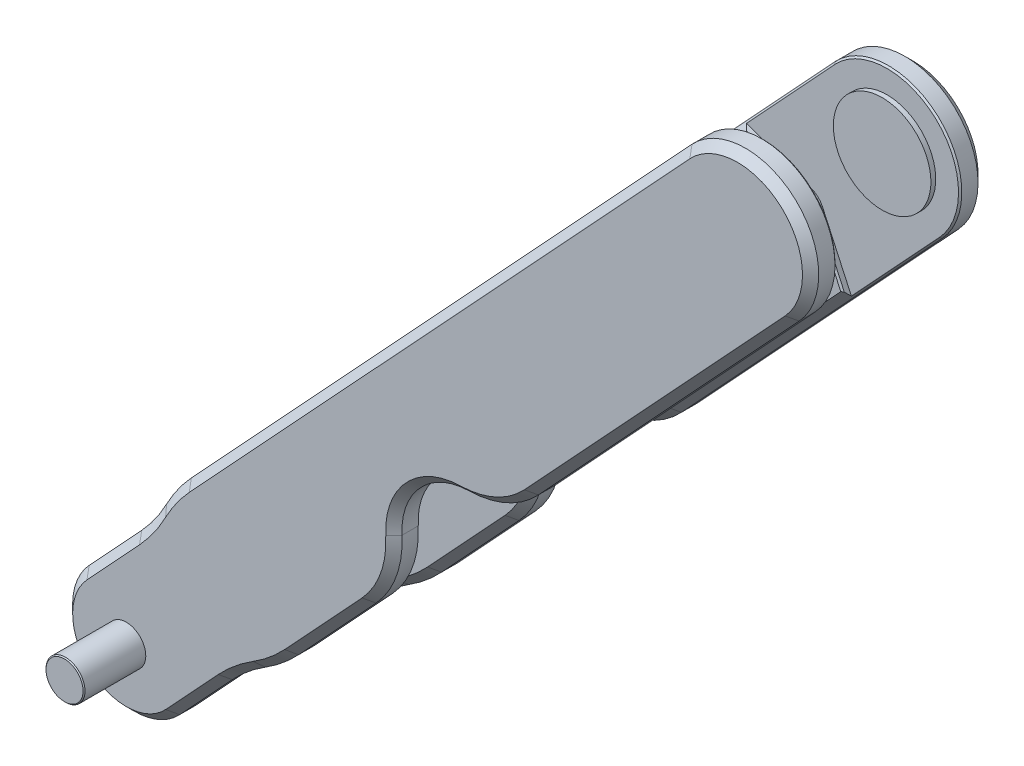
ISO-10303-21;
HEADER;
FILE_DESCRIPTION(('STEP AP214'),'2;1');
FILE_NAME('part.step','',(''),(''),'','','');
FILE_SCHEMA(('AUTOMOTIVE_DESIGN { 1 0 10303 214 1 1 1 1 }'));
ENDSEC;
DATA;
#1=APPLICATION_CONTEXT('core data for automotive mechanical design processes');
#2=APPLICATION_PROTOCOL_DEFINITION('international standard','automotive_design',2000,#1);
#3=PRODUCT_CONTEXT('',#1,'mechanical');
#4=PRODUCT('Part','Part','',(#3));
#5=PRODUCT_RELATED_PRODUCT_CATEGORY('part','',(#4));
#6=PRODUCT_DEFINITION_FORMATION('','',#4);
#7=PRODUCT_DEFINITION_CONTEXT('part definition',#1,'design');
#8=PRODUCT_DEFINITION('design','',#6,#7);
#9=PRODUCT_DEFINITION_SHAPE('','',#8);
#10=(LENGTH_UNIT() NAMED_UNIT(*) SI_UNIT(.MILLI.,.METRE.));
#11=(NAMED_UNIT(*) PLANE_ANGLE_UNIT() SI_UNIT($,.RADIAN.));
#12=(NAMED_UNIT(*) SI_UNIT($,.STERADIAN.) SOLID_ANGLE_UNIT());
#13=UNCERTAINTY_MEASURE_WITH_UNIT(LENGTH_MEASURE(1.E-05),#10,'distance_accuracy_value','');
#14=(GEOMETRIC_REPRESENTATION_CONTEXT(3) GLOBAL_UNCERTAINTY_ASSIGNED_CONTEXT((#13)) GLOBAL_UNIT_ASSIGNED_CONTEXT((#10,
#11,#12)) REPRESENTATION_CONTEXT('',''));
#15=CARTESIAN_POINT('',(0.,0.,0.));
#16=DIRECTION('',(0.,0.,1.));
#17=DIRECTION('',(1.,0.,0.));
#18=AXIS2_PLACEMENT_3D('',#15,#16,#17);
#19=CARTESIAN_POINT('',(247.768962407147,-189.949714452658,19.0000000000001));
#20=DIRECTION('',(0.,0.,-1.));
#21=DIRECTION('',(0.680359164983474,0.732878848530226,0.));
#22=AXIS2_PLACEMENT_3D('',#19,#20,#21);
#23=PLANE('',#22);
#24=CARTESIAN_POINT('',(247.76896240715,-189.949714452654,19.0000000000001));
#25=DIRECTION('',(0.,0.,1.));
#26=DIRECTION('',(0.0646412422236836,0.997908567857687,0.));
#27=AXIS2_PLACEMENT_3D('',#24,#25,#26);
#28=CIRCLE('',#27,15.);
#29=CARTESIAN_POINT('',(246.799343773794,-204.918342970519,19.0000000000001));
#30=VERTEX_POINT('',#29);
#31=EDGE_CURVE('P0_E757',#30,#30,#28,.T.);
#32=ORIENTED_EDGE('',*,*,#31,.T.);
#33=EDGE_LOOP('',(#32));
#34=FACE_BOUND('',#33,.T.);
#35=DIRECTION('',(0.680359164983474,0.732878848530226,0.));
#36=VECTOR('',#35,1.);
#37=CARTESIAN_POINT('',(231.645627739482,-174.981812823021,19.0000000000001));
#38=LINE('',#37,#36);
#39=CARTESIAN_POINT('',(204.571739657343,-204.145644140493,19.0000000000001));
#40=VERTEX_POINT('',#39);
#41=CARTESIAN_POINT('',(231.645627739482,-174.981812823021,19.0000000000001));
#42=VERTEX_POINT('',#41);
#43=EDGE_CURVE('P0_E589',#40,#42,#38,.T.);
#44=ORIENTED_EDGE('',*,*,#43,.T.);
#45=CARTESIAN_POINT('',(247.768962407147,-189.949714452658,19.0000000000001));
#46=DIRECTION('',(0.,0.,-1.));
#47=DIRECTION('',(0.680359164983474,0.732878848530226,0.));
#48=AXIS2_PLACEMENT_3D('',#45,#46,#47);
#49=CIRCLE('',#48,22.);
#50=CARTESIAN_POINT('',(263.892297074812,-204.917616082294,19.0000000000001));
#51=VERTEX_POINT('',#50);
#52=EDGE_CURVE('P0_E26',#42,#51,#49,.T.);
#53=ORIENTED_EDGE('',*,*,#52,.T.);
#54=DIRECTION('',(-0.680359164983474,-0.732878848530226,0.));
#55=VECTOR('',#54,1.);
#56=CARTESIAN_POINT('',(263.892297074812,-204.917616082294,19.0000000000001));
#57=LINE('',#56,#55);
#58=CARTESIAN_POINT('',(236.818408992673,-234.081447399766,19.0000000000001));
#59=VERTEX_POINT('',#58);
#60=EDGE_CURVE('P0_E586',#51,#59,#57,.T.);
#61=ORIENTED_EDGE('',*,*,#60,.T.);
#62=DIRECTION('',(-0.417707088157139,0.908581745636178,0.));
#63=VECTOR('',#62,1.);
#64=CARTESIAN_POINT('',(221.980131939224,-201.805749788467,19.0000000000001));
#65=LINE('',#64,#63);
#66=CARTESIAN_POINT('',(227.911091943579,-214.706565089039,19.0000000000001));
#67=VERTEX_POINT('',#66);
#68=EDGE_CURVE('P0_E328',#59,#67,#65,.T.);
#69=ORIENTED_EDGE('',*,*,#68,.T.);
#70=CARTESIAN_POINT('',(222.459601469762,-217.212807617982,19.0000000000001));
#71=DIRECTION('',(0.,0.,-1.));
#72=DIRECTION('',(0.680359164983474,0.732878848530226,0.));
#73=AXIS2_PLACEMENT_3D('',#70,#71,#72);
#74=CIRCLE('',#73,6.00000000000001);
#75=CARTESIAN_POINT('',(224.55430602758,-211.590333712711,19.0000000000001));
#76=VERTEX_POINT('',#75);
#77=EDGE_CURVE('P0_E329',#76,#67,#74,.T.);
#78=ORIENTED_EDGE('',*,*,#77,.F.);
#79=DIRECTION('',(0.937078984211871,-0.349117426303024,0.));
#80=VECTOR('',#79,1.);
#81=CARTESIAN_POINT('',(237.859749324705,-216.547399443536,19.0000000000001));
#82=LINE('',#81,#80);
#83=EDGE_CURVE('P0_E316',#40,#76,#82,.T.);
#84=ORIENTED_EDGE('',*,*,#83,.F.);
#85=EDGE_LOOP('',(#44,#53,#61,#69,#78,#84));
#86=FACE_BOUND('',#85,.T.);
#87=ADVANCED_FACE('P0_F16',(#34,#86),#23,.T.);
#88=CARTESIAN_POINT('',(247.768962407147,-189.949714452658,27.0000000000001));
#89=DIRECTION('',(0.,0.,-1.));
#90=DIRECTION('',(0.680359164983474,0.732878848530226,0.));
#91=AXIS2_PLACEMENT_3D('',#88,#89,#90);
#92=CYLINDRICAL_SURFACE('',#91,22.5);
#93=DIRECTION('',(0.,0.,-1.));
#94=VECTOR('',#93,1.);
#95=CARTESIAN_POINT('',(264.258736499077,-205.257795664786,27.0000000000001));
#96=LINE('',#95,#94);
#97=CARTESIAN_POINT('',(264.258736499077,-205.257795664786,24.5000000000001));
#98=VERTEX_POINT('',#97);
#99=CARTESIAN_POINT('',(264.258736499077,-205.257795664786,19.5000000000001));
#100=VERTEX_POINT('',#99);
#101=EDGE_CURVE('P0_E369',#98,#100,#96,.T.);
#102=ORIENTED_EDGE('',*,*,#101,.T.);
#103=CARTESIAN_POINT('',(247.768962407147,-189.949714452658,19.5000000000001));
#104=DIRECTION('',(0.,0.,-1.));
#105=DIRECTION('',(0.680359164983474,0.732878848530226,0.));
#106=AXIS2_PLACEMENT_3D('',#103,#104,#105);
#107=CIRCLE('',#106,22.5);
#108=CARTESIAN_POINT('',(231.279188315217,-174.64163324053,19.5000000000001));
#109=VERTEX_POINT('',#108);
#110=EDGE_CURVE('P0_E11',#100,#109,#107,.F.);
#111=ORIENTED_EDGE('',*,*,#110,.T.);
#112=DIRECTION('',(0.,0.,-1.));
#113=VECTOR('',#112,1.);
#114=CARTESIAN_POINT('',(231.279188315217,-174.64163324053,27.0000000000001));
#115=LINE('',#114,#113);
#116=CARTESIAN_POINT('',(231.279188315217,-174.64163324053,24.5000000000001));
#117=VERTEX_POINT('',#116);
#118=EDGE_CURVE('P0_E366',#117,#109,#115,.T.);
#119=ORIENTED_EDGE('',*,*,#118,.F.);
#120=CARTESIAN_POINT('',(247.768962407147,-189.949714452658,24.5000000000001));
#121=DIRECTION('',(0.,0.,-1.));
#122=DIRECTION('',(0.680359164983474,0.732878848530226,0.));
#123=AXIS2_PLACEMENT_3D('',#120,#121,#122);
#124=CIRCLE('',#123,22.5);
#125=EDGE_CURVE('P0_E534',#117,#98,#124,.T.);
#126=ORIENTED_EDGE('',*,*,#125,.T.);
#127=EDGE_LOOP('',(#102,#111,#119,#126));
#128=FACE_BOUND('',#127,.T.);
#129=ADVANCED_FACE('P0_F788',(#128),#92,.T.);
#130=CARTESIAN_POINT('',(231.279188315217,-174.64163324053,27.0000000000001));
#131=DIRECTION('',(0.732878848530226,-0.680359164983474,0.));
#132=DIRECTION('',(0.,0.,1.));
#133=AXIS2_PLACEMENT_3D('',#130,#131,#132);
#134=PLANE('',#133);
#135=DIRECTION('',(0.,0.,-1.));
#136=VECTOR('',#135,1.);
#137=CARTESIAN_POINT('',(77.2839527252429,-340.52438568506,27.0000000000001));
#138=LINE('',#137,#136);
#139=CARTESIAN_POINT('',(77.2839527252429,-340.52438568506,24.5000000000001));
#140=VERTEX_POINT('',#139);
#141=CARTESIAN_POINT('',(77.2839527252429,-340.52438568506,19.5000000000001));
#142=VERTEX_POINT('',#141);
#143=EDGE_CURVE('P0_E361',#140,#142,#138,.T.);
#144=ORIENTED_EDGE('',*,*,#143,.F.);
#145=DIRECTION('',(0.680359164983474,0.732878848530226,0.));
#146=VECTOR('',#145,1.);
#147=CARTESIAN_POINT('',(231.279188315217,-174.64163324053,24.5000000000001));
#148=LINE('',#147,#146);
#149=EDGE_CURVE('P0_E525',#140,#117,#148,.T.);
#150=ORIENTED_EDGE('',*,*,#149,.T.);
#151=ORIENTED_EDGE('',*,*,#118,.T.);
#152=DIRECTION('',(-0.680359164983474,-0.732878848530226,0.));
#153=VECTOR('',#152,1.);
#154=CARTESIAN_POINT('',(77.2839527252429,-340.52438568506,19.5000000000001));
#155=LINE('',#154,#153);
#156=EDGE_CURVE('P0_E521',#109,#142,#155,.T.);
#157=ORIENTED_EDGE('',*,*,#156,.T.);
#158=EDGE_LOOP('',(#144,#150,#151,#157));
#159=FACE_BOUND('',#158,.T.);
#160=ADVANCED_FACE('P0_F793',(#159),#134,.F.);
#161=CARTESIAN_POINT('',(264.258736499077,-205.257795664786,27.0000000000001));
#162=DIRECTION('',(-0.732878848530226,0.680359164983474,0.));
#163=DIRECTION('',(-0.680359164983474,-0.732878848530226,0.));
#164=AXIS2_PLACEMENT_3D('',#161,#162,#163);
#165=PLANE('',#164);
#166=DIRECTION('',(0.,0.,1.));
#167=VECTOR('',#166,1.);
#168=CARTESIAN_POINT('',(134.100571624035,-345.463397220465,27.0000000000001));
#169=LINE('',#168,#167);
#170=CARTESIAN_POINT('',(134.100571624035,-345.463397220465,19.5000000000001));
#171=VERTEX_POINT('',#170);
#172=CARTESIAN_POINT('',(134.100571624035,-345.463397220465,24.5000000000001));
#173=VERTEX_POINT('',#172);
#174=EDGE_CURVE('P0_E401',#171,#173,#169,.T.);
#175=ORIENTED_EDGE('',*,*,#174,.T.);
#176=DIRECTION('',(-0.680359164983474,-0.732878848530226,0.));
#177=VECTOR('',#176,1.);
#178=CARTESIAN_POINT('',(264.258736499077,-205.257795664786,24.5000000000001));
#179=LINE('',#178,#177);
#180=CARTESIAN_POINT('',(110.263500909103,-371.140548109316,24.5000000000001));
#181=VERTEX_POINT('',#180);
#182=EDGE_CURVE('P0_E494',#173,#181,#179,.T.);
#183=ORIENTED_EDGE('',*,*,#182,.T.);
#184=DIRECTION('',(0.,0.,-1.));
#185=VECTOR('',#184,1.);
#186=CARTESIAN_POINT('',(110.263500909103,-371.140548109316,27.0000000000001));
#187=LINE('',#186,#185);
#188=CARTESIAN_POINT('',(110.263500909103,-371.140548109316,19.5000000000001));
#189=VERTEX_POINT('',#188);
#190=EDGE_CURVE('P0_E373',#181,#189,#187,.T.);
#191=ORIENTED_EDGE('',*,*,#190,.T.);
#192=DIRECTION('',(0.680359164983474,0.732878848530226,0.));
#193=VECTOR('',#192,1.);
#194=CARTESIAN_POINT('',(134.100571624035,-345.463397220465,19.5000000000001));
#195=LINE('',#194,#193);
#196=EDGE_CURVE('P0_E491',#189,#171,#195,.T.);
#197=ORIENTED_EDGE('',*,*,#196,.T.);
#198=EDGE_LOOP('',(#175,#183,#191,#197));
#199=FACE_BOUND('',#198,.T.);
#200=ADVANCED_FACE('P0_F822',(#199),#165,.F.);
#201=CARTESIAN_POINT('',(113.927895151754,-374.542343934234,27.0000000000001));
#202=DIRECTION('',(0.,0.,-1.));
#203=DIRECTION('',(0.680359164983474,0.732878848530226,0.));
#204=AXIS2_PLACEMENT_3D('',#201,#202,#203);
#205=CYLINDRICAL_SURFACE('',#204,50.);
#206=DIRECTION('',(0.,0.,-1.));
#207=VECTOR('',#206,1.);
#208=CARTESIAN_POINT('',(69.6452852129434,-351.3248837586,27.0000000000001));
#209=LINE('',#208,#207);
#210=CARTESIAN_POINT('',(69.6452852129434,-351.3248837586,24.5000000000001));
#211=VERTEX_POINT('',#210);
#212=CARTESIAN_POINT('',(69.6452852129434,-351.3248837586,19.5000000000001));
#213=VERTEX_POINT('',#212);
#214=EDGE_CURVE('P0_E397',#211,#213,#209,.T.);
#215=ORIENTED_EDGE('',*,*,#214,.F.);
#216=CARTESIAN_POINT('',(113.927895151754,-374.542343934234,24.5000000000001));
#217=DIRECTION('',(0.,0.,-1.));
#218=DIRECTION('',(0.680359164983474,0.732878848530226,0.));
#219=AXIS2_PLACEMENT_3D('',#216,#217,#218);
#220=CIRCLE('',#219,50.);
#221=EDGE_CURVE('P0_E512',#211,#140,#220,.T.);
#222=ORIENTED_EDGE('',*,*,#221,.T.);
#223=ORIENTED_EDGE('',*,*,#143,.T.);
#224=CARTESIAN_POINT('',(113.927895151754,-374.542343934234,19.5000000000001));
#225=DIRECTION('',(0.,0.,-1.));
#226=DIRECTION('',(0.680359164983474,0.732878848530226,0.));
#227=AXIS2_PLACEMENT_3D('',#224,#225,#226);
#228=CIRCLE('',#227,50.);
#229=EDGE_CURVE('P0_E509',#142,#213,#228,.F.);
#230=ORIENTED_EDGE('',*,*,#229,.T.);
#231=EDGE_LOOP('',(#215,#222,#223,#230));
#232=FACE_BOUND('',#231,.T.);
#233=ADVANCED_FACE('P0_F851',(#232),#205,.T.);
#234=CARTESIAN_POINT('',(25.3626752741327,-328.107423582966,27.));
#235=DIRECTION('',(0.,0.,-1.));
#236=DIRECTION('',(0.680359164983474,0.732878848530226,0.));
#237=AXIS2_PLACEMENT_3D('',#234,#235,#236);
#238=CYLINDRICAL_SURFACE('',#237,50.);
#239=DIRECTION('',(0.,0.,-1.));
#240=VECTOR('',#239,1.);
#241=CARTESIAN_POINT('',(62.006617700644,-362.12538183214,27.0000000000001));
#242=LINE('',#241,#240);
#243=CARTESIAN_POINT('',(62.006617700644,-362.12538183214,24.5000000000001));
#244=VERTEX_POINT('',#243);
#245=CARTESIAN_POINT('',(62.006617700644,-362.12538183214,19.5000000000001));
#246=VERTEX_POINT('',#245);
#247=EDGE_CURVE('P0_E393',#244,#246,#242,.T.);
#248=ORIENTED_EDGE('',*,*,#247,.F.);
#249=CARTESIAN_POINT('',(25.3626752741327,-328.107423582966,24.5));
#250=DIRECTION('',(0.,0.,-1.));
#251=DIRECTION('',(0.680359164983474,0.732878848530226,0.));
#252=AXIS2_PLACEMENT_3D('',#249,#250,#251);
#253=CIRCLE('',#252,50.);
#254=EDGE_CURVE('P0_E500',#244,#211,#253,.F.);
#255=ORIENTED_EDGE('',*,*,#254,.T.);
#256=ORIENTED_EDGE('',*,*,#214,.T.);
#257=CARTESIAN_POINT('',(25.3626752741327,-328.107423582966,19.5));
#258=DIRECTION('',(0.,0.,-1.));
#259=DIRECTION('',(0.680359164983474,0.732878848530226,0.));
#260=AXIS2_PLACEMENT_3D('',#257,#258,#259);
#261=CIRCLE('',#260,50.);
#262=EDGE_CURVE('P0_E497',#213,#246,#261,.T.);
#263=ORIENTED_EDGE('',*,*,#262,.T.);
#264=EDGE_LOOP('',(#248,#255,#256,#263));
#265=FACE_BOUND('',#264,.T.);
#266=ADVANCED_FACE('P0_F847',(#265),#238,.F.);
#267=CARTESIAN_POINT('',(45.831070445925,-379.549585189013,27.0000000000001));
#268=DIRECTION('',(0.732878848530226,-0.680359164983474,0.));
#269=DIRECTION('',(0.680359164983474,0.732878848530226,0.));
#270=AXIS2_PLACEMENT_3D('',#267,#268,#269);
#271=PLANE('',#270);
#272=DIRECTION('',(0.,0.,-1.));
#273=VECTOR('',#272,1.);
#274=CARTESIAN_POINT('',(45.831070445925,-379.549585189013,27.0000000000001));
#275=LINE('',#274,#273);
#276=CARTESIAN_POINT('',(45.831070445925,-379.549585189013,24.5));
#277=VERTEX_POINT('',#276);
#278=CARTESIAN_POINT('',(45.831070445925,-379.549585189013,19.5000000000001));
#279=VERTEX_POINT('',#278);
#280=EDGE_CURVE('P0_E389',#277,#279,#275,.T.);
#281=ORIENTED_EDGE('',*,*,#280,.F.);
#282=DIRECTION('',(0.680359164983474,0.732878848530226,0.));
#283=VECTOR('',#282,1.);
#284=CARTESIAN_POINT('',(45.831070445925,-379.549585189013,24.5));
#285=LINE('',#284,#283);
#286=EDGE_CURVE('P0_E488',#277,#244,#285,.T.);
#287=ORIENTED_EDGE('',*,*,#286,.T.);
#288=ORIENTED_EDGE('',*,*,#247,.T.);
#289=DIRECTION('',(-0.680359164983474,-0.732878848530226,0.));
#290=VECTOR('',#289,1.);
#291=CARTESIAN_POINT('',(45.831070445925,-379.549585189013,19.5000000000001));
#292=LINE('',#291,#290);
#293=EDGE_CURVE('P0_E485',#246,#279,#292,.T.);
#294=ORIENTED_EDGE('',*,*,#293,.T.);
#295=EDGE_LOOP('',(#281,#287,#288,#294));
#296=FACE_BOUND('',#295,.T.);
#297=ADVANCED_FACE('P0_F843',(#296),#271,.F.);
#298=CARTESIAN_POINT('',(59.7557685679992,-392.476409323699,27.0000000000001));
#299=DIRECTION('',(0.,0.,-1.));
#300=DIRECTION('',(0.680359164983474,0.732878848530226,0.));
#301=AXIS2_PLACEMENT_3D('',#298,#299,#300);
#302=CYLINDRICAL_SURFACE('',#301,19.);
#303=DIRECTION('',(0.,0.,-1.));
#304=VECTOR('',#303,1.);
#305=CARTESIAN_POINT('',(73.6804666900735,-405.403233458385,27.0000000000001));
#306=LINE('',#305,#304);
#307=CARTESIAN_POINT('',(73.6804666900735,-405.403233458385,24.5000000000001));
#308=VERTEX_POINT('',#307);
#309=CARTESIAN_POINT('',(73.6804666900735,-405.403233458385,19.5000000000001));
#310=VERTEX_POINT('',#309);
#311=EDGE_CURVE('P0_E385',#308,#310,#306,.T.);
#312=ORIENTED_EDGE('',*,*,#311,.F.);
#313=CARTESIAN_POINT('',(59.7557685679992,-392.476409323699,24.5000000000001));
#314=DIRECTION('',(0.,0.,-1.));
#315=DIRECTION('',(0.680359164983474,0.732878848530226,0.));
#316=AXIS2_PLACEMENT_3D('',#313,#314,#315);
#317=CIRCLE('',#316,19.);
#318=EDGE_CURVE('P0_E476',#308,#277,#317,.T.);
#319=ORIENTED_EDGE('',*,*,#318,.T.);
#320=ORIENTED_EDGE('',*,*,#280,.T.);
#321=CARTESIAN_POINT('',(59.7557685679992,-392.476409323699,19.5000000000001));
#322=DIRECTION('',(0.,0.,-1.));
#323=DIRECTION('',(0.680359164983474,0.732878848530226,0.));
#324=AXIS2_PLACEMENT_3D('',#321,#322,#323);
#325=CIRCLE('',#324,19.);
#326=EDGE_CURVE('P0_E473',#279,#310,#325,.F.);
#327=ORIENTED_EDGE('',*,*,#326,.T.);
#328=EDGE_LOOP('',(#312,#319,#320,#327));
#329=FACE_BOUND('',#328,.T.);
#330=ADVANCED_FACE('P0_F839',(#329),#302,.T.);
#331=CARTESIAN_POINT('',(73.6804666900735,-405.403233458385,27.0000000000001));
#332=DIRECTION('',(-0.732878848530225,0.680359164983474,0.));
#333=DIRECTION('',(-0.680359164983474,-0.732878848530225,0.));
#334=AXIS2_PLACEMENT_3D('',#331,#332,#333);
#335=PLANE('',#334);
#336=DIRECTION('',(0.,0.,-1.));
#337=VECTOR('',#336,1.);
#338=CARTESIAN_POINT('',(89.8560139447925,-387.979030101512,27.0000000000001));
#339=LINE('',#338,#337);
#340=CARTESIAN_POINT('',(89.8560139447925,-387.979030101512,24.5000000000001));
#341=VERTEX_POINT('',#340);
#342=CARTESIAN_POINT('',(89.8560139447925,-387.979030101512,19.5000000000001));
#343=VERTEX_POINT('',#342);
#344=EDGE_CURVE('P0_E381',#341,#343,#339,.T.);
#345=ORIENTED_EDGE('',*,*,#344,.F.);
#346=DIRECTION('',(-0.680359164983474,-0.732878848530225,0.));
#347=VECTOR('',#346,1.);
#348=CARTESIAN_POINT('',(73.6804666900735,-405.403233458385,24.5000000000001));
#349=LINE('',#348,#347);
#350=EDGE_CURVE('P0_E463',#341,#308,#349,.T.);
#351=ORIENTED_EDGE('',*,*,#350,.T.);
#352=ORIENTED_EDGE('',*,*,#311,.T.);
#353=DIRECTION('',(0.680359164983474,0.732878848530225,0.));
#354=VECTOR('',#353,1.);
#355=CARTESIAN_POINT('',(89.8560139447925,-387.979030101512,19.5000000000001));
#356=LINE('',#355,#354);
#357=EDGE_CURVE('P0_E460',#310,#343,#356,.T.);
#358=ORIENTED_EDGE('',*,*,#357,.T.);
#359=EDGE_LOOP('',(#345,#351,#352,#358));
#360=FACE_BOUND('',#359,.T.);
#361=ADVANCED_FACE('P0_F835',(#360),#335,.F.);
#362=CARTESIAN_POINT('',(126.499956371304,-421.996988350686,27.0000000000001));
#363=DIRECTION('',(0.,0.,-1.));
#364=DIRECTION('',(0.680359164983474,0.732878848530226,0.));
#365=AXIS2_PLACEMENT_3D('',#362,#363,#364);
#366=CYLINDRICAL_SURFACE('',#365,50.);
#367=DIRECTION('',(0.,0.,-1.));
#368=VECTOR('',#367,1.);
#369=CARTESIAN_POINT('',(100.059757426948,-379.559789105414,27.0000000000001));
#370=LINE('',#369,#368);
#371=CARTESIAN_POINT('',(100.059757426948,-379.559789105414,24.5000000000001));
#372=VERTEX_POINT('',#371);
#373=CARTESIAN_POINT('',(100.059757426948,-379.559789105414,19.5000000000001));
#374=VERTEX_POINT('',#373);
#375=EDGE_CURVE('P0_E377',#372,#374,#370,.T.);
#376=ORIENTED_EDGE('',*,*,#375,.F.);
#377=CARTESIAN_POINT('',(126.499956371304,-421.996988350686,24.5000000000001));
#378=DIRECTION('',(0.,0.,-1.));
#379=DIRECTION('',(0.680359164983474,0.732878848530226,0.));
#380=AXIS2_PLACEMENT_3D('',#377,#378,#379);
#381=CIRCLE('',#380,50.);
#382=EDGE_CURVE('P0_E470',#372,#341,#381,.F.);
#383=ORIENTED_EDGE('',*,*,#382,.T.);
#384=ORIENTED_EDGE('',*,*,#344,.T.);
#385=CARTESIAN_POINT('',(126.499956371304,-421.996988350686,19.5000000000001));
#386=DIRECTION('',(0.,0.,-1.));
#387=DIRECTION('',(0.680359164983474,0.732878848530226,0.));
#388=AXIS2_PLACEMENT_3D('',#385,#386,#387);
#389=CIRCLE('',#388,50.);
#390=EDGE_CURVE('P0_E467',#343,#374,#389,.T.);
#391=ORIENTED_EDGE('',*,*,#390,.T.);
#392=EDGE_LOOP('',(#376,#383,#384,#391));
#393=FACE_BOUND('',#392,.T.);
#394=ADVANCED_FACE('P0_F831',(#393),#366,.F.);
#395=CARTESIAN_POINT('',(73.6195584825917,-337.122589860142,27.0000000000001));
#396=DIRECTION('',(0.,0.,-1.));
#397=DIRECTION('',(0.680359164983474,0.732878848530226,0.));
#398=AXIS2_PLACEMENT_3D('',#395,#396,#397);
#399=CYLINDRICAL_SURFACE('',#398,50.);
#400=ORIENTED_EDGE('',*,*,#190,.F.);
#401=CARTESIAN_POINT('',(73.6195584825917,-337.122589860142,24.5000000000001));
#402=DIRECTION('',(0.,0.,-1.));
#403=DIRECTION('',(0.680359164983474,0.732878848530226,0.));
#404=AXIS2_PLACEMENT_3D('',#401,#402,#403);
#405=CIRCLE('',#404,50.);
#406=EDGE_CURVE('P0_E482',#181,#372,#405,.T.);
#407=ORIENTED_EDGE('',*,*,#406,.T.);
#408=ORIENTED_EDGE('',*,*,#375,.T.);
#409=CARTESIAN_POINT('',(73.6195584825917,-337.122589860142,19.5000000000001));
#410=DIRECTION('',(0.,0.,-1.));
#411=DIRECTION('',(0.680359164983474,0.732878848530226,0.));
#412=AXIS2_PLACEMENT_3D('',#409,#410,#411);
#413=CIRCLE('',#412,50.);
#414=EDGE_CURVE('P0_E479',#374,#189,#413,.F.);
#415=ORIENTED_EDGE('',*,*,#414,.T.);
#416=EDGE_LOOP('',(#400,#407,#408,#415));
#417=FACE_BOUND('',#416,.T.);
#418=ADVANCED_FACE('P0_F827',(#417),#399,.T.);
#419=ORIENTED_EDGE('',*,*,#101,.F.);
#420=DIRECTION('',(-0.680359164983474,-0.732878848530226,0.));
#421=VECTOR('',#420,1.);
#422=CARTESIAN_POINT('',(264.258736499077,-205.257795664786,24.5000000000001));
#423=LINE('',#422,#421);
#424=CARTESIAN_POINT('',(184.0171488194,-291.693556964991,24.5000000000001));
#425=VERTEX_POINT('',#424);
#426=EDGE_CURVE('P0_E541',#98,#425,#423,.T.);
#427=ORIENTED_EDGE('',*,*,#426,.T.);
#428=DIRECTION('',(0.,0.,1.));
#429=VECTOR('',#428,1.);
#430=CARTESIAN_POINT('',(184.0171488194,-291.693556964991,27.0000000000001));
#431=LINE('',#430,#429);
#432=CARTESIAN_POINT('',(184.0171488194,-291.693556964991,19.5000000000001));
#433=VERTEX_POINT('',#432);
#434=EDGE_CURVE('P0_E413',#425,#433,#431,.F.);
#435=ORIENTED_EDGE('',*,*,#434,.T.);
#436=DIRECTION('',(0.680359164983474,0.732878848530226,0.));
#437=VECTOR('',#436,1.);
#438=CARTESIAN_POINT('',(237.044369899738,-234.572949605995,19.5000000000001));
#439=LINE('',#438,#437);
#440=EDGE_CURVE('P0_E537',#433,#100,#439,.T.);
#441=ORIENTED_EDGE('',*,*,#440,.T.);
#442=EDGE_LOOP('',(#419,#427,#435,#441));
#443=FACE_BOUND('',#442,.T.);
#444=ADVANCED_FACE('P0_F817',(#443),#165,.F.);
#445=CARTESIAN_POINT('',(113.927895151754,-374.542343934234,27.0000000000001));
#446=DIRECTION('',(0.,0.,-1.));
#447=DIRECTION('',(0.680359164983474,0.732878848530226,0.));
#448=AXIS2_PLACEMENT_3D('',#445,#446,#447);
#449=PLANE('',#448);
#450=CARTESIAN_POINT('',(59.7557685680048,-392.476409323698,27.0000000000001));
#451=DIRECTION('',(0.,0.,-1.));
#452=DIRECTION('',(-1.,0.,0.));
#453=AXIS2_PLACEMENT_3D('',#450,#451,#452);
#454=CIRCLE('',#453,6.);
#455=CARTESIAN_POINT('',(53.7557685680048,-392.476409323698,27.0000000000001));
#456=VERTEX_POINT('',#455);
#457=EDGE_CURVE('P0_E20',#456,#456,#454,.T.);
#458=ORIENTED_EDGE('',*,*,#457,.T.);
#459=EDGE_LOOP('',(#458));
#460=FACE_BOUND('',#459,.T.);
#461=CARTESIAN_POINT('',(59.7557685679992,-392.476409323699,27.0000000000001));
#462=DIRECTION('',(0.,0.,-1.));
#463=DIRECTION('',(0.680359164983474,0.732878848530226,0.));
#464=AXIS2_PLACEMENT_3D('',#461,#462,#463);
#465=CIRCLE('',#464,16.5);
#466=CARTESIAN_POINT('',(47.6632675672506,-381.250483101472,27.0000000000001));
#467=VERTEX_POINT('',#466);
#468=CARTESIAN_POINT('',(71.848269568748,-403.702335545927,27.0000000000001));
#469=VERTEX_POINT('',#468);
#470=EDGE_CURVE('P0_E450',#467,#469,#465,.F.);
#471=ORIENTED_EDGE('',*,*,#470,.T.);
#472=DIRECTION('',(0.680359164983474,0.732878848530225,0.));
#473=VECTOR('',#472,1.);
#474=CARTESIAN_POINT('',(105.866227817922,-367.058393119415,27.0000000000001));
#475=LINE('',#474,#473);
#476=CARTESIAN_POINT('',(88.0238168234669,-386.278132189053,27.0000000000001));
#477=VERTEX_POINT('',#476);
#478=EDGE_CURVE('P0_E456',#469,#477,#475,.T.);
#479=ORIENTED_EDGE('',*,*,#478,.T.);
#480=CARTESIAN_POINT('',(126.499956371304,-421.996988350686,27.0000000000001));
#481=DIRECTION('',(0.,0.,-1.));
#482=DIRECTION('',(0.680359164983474,0.732878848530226,0.));
#483=AXIS2_PLACEMENT_3D('',#480,#481,#482);
#484=CIRCLE('',#483,52.5);
#485=CARTESIAN_POINT('',(98.73774747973,-377.43792914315,27.0000000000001));
#486=VERTEX_POINT('',#485);
#487=EDGE_CURVE('P0_E453',#477,#486,#484,.T.);
#488=ORIENTED_EDGE('',*,*,#487,.T.);
#489=CARTESIAN_POINT('',(73.6195584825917,-337.122589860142,27.0000000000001));
#490=DIRECTION('',(0.,0.,-1.));
#491=DIRECTION('',(0.680359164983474,0.732878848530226,0.));
#492=AXIS2_PLACEMENT_3D('',#489,#490,#491);
#493=CIRCLE('',#492,47.5);
#494=CARTESIAN_POINT('',(108.431303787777,-369.439650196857,27.0000000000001));
#495=VERTEX_POINT('',#494);
#496=EDGE_CURVE('P0_E447',#486,#495,#493,.F.);
#497=ORIENTED_EDGE('',*,*,#496,.T.);
#498=DIRECTION('',(0.680359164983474,0.732878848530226,0.));
#499=VECTOR('',#498,1.);
#500=CARTESIAN_POINT('',(108.431303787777,-369.439650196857,27.0000000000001));
#501=LINE('',#500,#499);
#502=CARTESIAN_POINT('',(132.26837450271,-343.762499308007,27.0000000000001));
#503=VERTEX_POINT('',#502);
#504=EDGE_CURVE('P0_E441',#495,#503,#501,.T.);
#505=ORIENTED_EDGE('',*,*,#504,.T.);
#506=CARTESIAN_POINT('',(112.114206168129,-325.052622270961,27.0000000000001));
#507=DIRECTION('',(0.,0.,-1.));
#508=DIRECTION('',(0.680359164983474,0.732878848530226,0.));
#509=AXIS2_PLACEMENT_3D('',#506,#507,#508);
#510=CIRCLE('',#509,27.5);
#511=CARTESIAN_POINT('',(139.57332617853,-323.553713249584,27.0000000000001));
#512=VERTEX_POINT('',#511);
#513=EDGE_CURVE('P0_E435',#503,#512,#510,.F.);
#514=ORIENTED_EDGE('',*,*,#513,.T.);
#515=CARTESIAN_POINT('',(163.038392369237,-322.272827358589,27.0000000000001));
#516=DIRECTION('',(0.,0.,-1.));
#517=DIRECTION('',(0.680359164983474,0.732878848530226,0.));
#518=AXIS2_PLACEMENT_3D('',#515,#516,#517);
#519=CIRCLE('',#518,23.5);
#520=CARTESIAN_POINT('',(162.574101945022,-298.777414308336,27.0000000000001));
#521=VERTEX_POINT('',#520);
#522=EDGE_CURVE('P0_E429',#512,#521,#519,.T.);
#523=ORIENTED_EDGE('',*,*,#522,.T.);
#524=CARTESIAN_POINT('',(162.030783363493,-271.282782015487,27.0000000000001));
#525=DIRECTION('',(0.,0.,-1.));
#526=DIRECTION('',(0.680359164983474,0.732878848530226,0.));
#527=AXIS2_PLACEMENT_3D('',#524,#525,#526);
#528=CIRCLE('',#527,27.5);
#529=CARTESIAN_POINT('',(182.184951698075,-289.992659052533,27.0000000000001));
#530=VERTEX_POINT('',#529);
#531=EDGE_CURVE('P0_E423',#521,#530,#528,.F.);
#532=ORIENTED_EDGE('',*,*,#531,.T.);
#533=DIRECTION('',(0.680359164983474,0.732878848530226,0.));
#534=VECTOR('',#533,1.);
#535=CARTESIAN_POINT('',(108.431303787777,-369.439650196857,27.0000000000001));
#536=LINE('',#535,#534);
#537=CARTESIAN_POINT('',(262.426539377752,-203.556897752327,27.0000000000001));
#538=VERTEX_POINT('',#537);
#539=EDGE_CURVE('P0_E417',#530,#538,#536,.T.);
#540=ORIENTED_EDGE('',*,*,#539,.T.);
#541=CARTESIAN_POINT('',(247.768962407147,-189.949714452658,27.0000000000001));
#542=DIRECTION('',(0.,0.,-1.));
#543=DIRECTION('',(0.680359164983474,0.732878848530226,0.));
#544=AXIS2_PLACEMENT_3D('',#541,#542,#543);
#545=CIRCLE('',#544,20.);
#546=CARTESIAN_POINT('',(233.111385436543,-176.342531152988,27.0000000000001));
#547=VERTEX_POINT('',#546);
#548=EDGE_CURVE('P0_E420',#538,#547,#545,.F.);
#549=ORIENTED_EDGE('',*,*,#548,.T.);
#550=DIRECTION('',(-0.680359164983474,-0.732878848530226,0.));
#551=VECTOR('',#550,1.);
#552=CARTESIAN_POINT('',(79.1161498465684,-342.225283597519,27.0000000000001));
#553=LINE('',#552,#551);
#554=CARTESIAN_POINT('',(79.1161498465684,-342.225283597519,27.0000000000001));
#555=VERTEX_POINT('',#554);
#556=EDGE_CURVE('P0_E426',#547,#555,#553,.T.);
#557=ORIENTED_EDGE('',*,*,#556,.T.);
#558=CARTESIAN_POINT('',(113.927895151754,-374.542343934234,27.0000000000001));
#559=DIRECTION('',(0.,0.,-1.));
#560=DIRECTION('',(0.680359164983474,0.732878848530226,0.));
#561=AXIS2_PLACEMENT_3D('',#558,#559,#560);
#562=CIRCLE('',#561,47.5);
#563=CARTESIAN_POINT('',(71.859415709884,-352.485756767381,27.0000000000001));
#564=VERTEX_POINT('',#563);
#565=EDGE_CURVE('P0_E432',#555,#564,#562,.F.);
#566=ORIENTED_EDGE('',*,*,#565,.T.);
#567=CARTESIAN_POINT('',(25.3626752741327,-328.107423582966,27.));
#568=DIRECTION('',(0.,0.,-1.));
#569=DIRECTION('',(0.680359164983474,0.732878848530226,0.));
#570=AXIS2_PLACEMENT_3D('',#567,#568,#569);
#571=CIRCLE('',#570,52.5);
#572=CARTESIAN_POINT('',(63.8388148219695,-363.826279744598,27.0000000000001));
#573=VERTEX_POINT('',#572);
#574=EDGE_CURVE('P0_E438',#564,#573,#571,.T.);
#575=ORIENTED_EDGE('',*,*,#574,.T.);
#576=DIRECTION('',(-0.680359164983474,-0.732878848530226,0.));
#577=VECTOR('',#576,1.);
#578=CARTESIAN_POINT('',(81.6812258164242,-344.606540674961,27.0000000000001));
#579=LINE('',#578,#577);
#580=EDGE_CURVE('P0_E444',#573,#467,#579,.T.);
#581=ORIENTED_EDGE('',*,*,#580,.T.);
#582=EDGE_LOOP('',(#471,#479,#488,#497,#505,#514,#523,#532,#540,#549,#557,#566,#575,#581));
#583=FACE_BOUND('',#582,.T.);
#584=ADVANCED_FACE('P0_F814',(#460,#583),#449,.F.);
#585=CARTESIAN_POINT('',(113.927895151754,-374.542343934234,17.0000000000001));
#586=DIRECTION('',(0.,0.,-1.));
#587=DIRECTION('',(0.680359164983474,0.732878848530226,0.));
#588=AXIS2_PLACEMENT_3D('',#585,#586,#587);
#589=PLANE('',#588);
#590=CARTESIAN_POINT('',(59.7557685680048,-392.476409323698,17.0000000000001));
#591=DIRECTION('',(0.,0.,-1.));
#592=DIRECTION('',(-1.,0.,0.));
#593=AXIS2_PLACEMENT_3D('',#590,#591,#592);
#594=CIRCLE('',#593,15.);
#595=CARTESIAN_POINT('',(44.7557685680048,-392.476409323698,17.0000000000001));
#596=VERTEX_POINT('',#595);
#597=EDGE_CURVE('P0_E727',#596,#596,#594,.F.);
#598=ORIENTED_EDGE('',*,*,#597,.T.);
#599=EDGE_LOOP('',(#598));
#600=FACE_BOUND('',#599,.T.);
#601=DIRECTION('',(0.680359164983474,0.732878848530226,0.));
#602=VECTOR('',#601,1.);
#603=CARTESIAN_POINT('',(205.897018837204,-205.657685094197,17.0000000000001));
#604=LINE('',#603,#602);
#605=CARTESIAN_POINT('',(79.1161498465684,-342.225283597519,17.0000000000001));
#606=VERTEX_POINT('',#605);
#607=CARTESIAN_POINT('',(206.231367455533,-205.297526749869,17.0000000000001));
#608=VERTEX_POINT('',#607);
#609=EDGE_CURVE('P0_E580',#606,#608,#604,.T.);
#610=ORIENTED_EDGE('',*,*,#609,.T.);
#611=DIRECTION('',(0.937078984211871,-0.349117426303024,0.));
#612=VECTOR('',#611,1.);
#613=CARTESIAN_POINT('',(180.546661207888,-195.728452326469,17.0000000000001));
#614=LINE('',#613,#612);
#615=CARTESIAN_POINT('',(224.379747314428,-212.058873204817,17.0000000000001));
#616=VERTEX_POINT('',#615);
#617=EDGE_CURVE('P0_E698',#608,#616,#614,.T.);
#618=ORIENTED_EDGE('',*,*,#617,.T.);
#619=CARTESIAN_POINT('',(222.459601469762,-217.212807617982,17.0000000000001));
#620=DIRECTION('',(0.,0.,-1.));
#621=DIRECTION('',(0.680359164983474,0.732878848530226,0.));
#622=AXIS2_PLACEMENT_3D('',#619,#620,#621);
#623=CIRCLE('',#622,5.50000000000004);
#624=CARTESIAN_POINT('',(227.456801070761,-214.915418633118,17.0000000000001));
#625=VERTEX_POINT('',#624);
#626=EDGE_CURVE('P0_E695',#616,#625,#623,.T.);
#627=ORIENTED_EDGE('',*,*,#626,.T.);
#628=DIRECTION('',(0.417707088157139,-0.908581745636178,0.));
#629=VECTOR('',#628,1.);
#630=CARTESIAN_POINT('',(235.460274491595,-232.324292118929,17.0000000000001));
#631=LINE('',#630,#629);
#632=CARTESIAN_POINT('',(235.546521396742,-232.511893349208,17.0000000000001));
#633=VERTEX_POINT('',#632);
#634=EDGE_CURVE('P0_E595',#625,#633,#631,.T.);
#635=ORIENTED_EDGE('',*,*,#634,.T.);
#636=DIRECTION('',(-0.680359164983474,-0.732878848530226,0.));
#637=VECTOR('',#636,1.);
#638=CARTESIAN_POINT('',(182.184951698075,-289.992659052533,17.0000000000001));
#639=LINE('',#638,#637);
#640=CARTESIAN_POINT('',(182.184951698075,-289.992659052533,17.0000000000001));
#641=VERTEX_POINT('',#640);
#642=EDGE_CURVE('P0_E544',#633,#641,#639,.T.);
#643=ORIENTED_EDGE('',*,*,#642,.T.);
#644=CARTESIAN_POINT('',(162.030783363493,-271.282782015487,17.0000000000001));
#645=DIRECTION('',(0.,0.,-1.));
#646=DIRECTION('',(0.680359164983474,0.732878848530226,0.));
#647=AXIS2_PLACEMENT_3D('',#644,#645,#646);
#648=CIRCLE('',#647,27.5);
#649=CARTESIAN_POINT('',(162.574101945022,-298.777414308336,17.0000000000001));
#650=VERTEX_POINT('',#649);
#651=EDGE_CURVE('P0_E547',#641,#650,#648,.T.);
#652=ORIENTED_EDGE('',*,*,#651,.T.);
#653=CARTESIAN_POINT('',(163.038392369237,-322.272827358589,17.0000000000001));
#654=DIRECTION('',(0.,0.,-1.));
#655=DIRECTION('',(0.680359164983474,0.732878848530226,0.));
#656=AXIS2_PLACEMENT_3D('',#653,#654,#655);
#657=CIRCLE('',#656,23.5);
#658=CARTESIAN_POINT('',(139.57332617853,-323.553713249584,17.0000000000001));
#659=VERTEX_POINT('',#658);
#660=EDGE_CURVE('P0_E550',#650,#659,#657,.F.);
#661=ORIENTED_EDGE('',*,*,#660,.T.);
#662=CARTESIAN_POINT('',(112.114206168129,-325.052622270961,17.0000000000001));
#663=DIRECTION('',(0.,0.,-1.));
#664=DIRECTION('',(0.680359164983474,0.732878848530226,0.));
#665=AXIS2_PLACEMENT_3D('',#662,#663,#664);
#666=CIRCLE('',#665,27.5);
#667=CARTESIAN_POINT('',(132.26837450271,-343.762499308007,17.0000000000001));
#668=VERTEX_POINT('',#667);
#669=EDGE_CURVE('P0_E553',#659,#668,#666,.T.);
#670=ORIENTED_EDGE('',*,*,#669,.T.);
#671=DIRECTION('',(-0.680359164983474,-0.732878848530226,0.));
#672=VECTOR('',#671,1.);
#673=CARTESIAN_POINT('',(108.431303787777,-369.439650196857,17.0000000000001));
#674=LINE('',#673,#672);
#675=CARTESIAN_POINT('',(108.431303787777,-369.439650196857,17.0000000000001));
#676=VERTEX_POINT('',#675);
#677=EDGE_CURVE('P0_E556',#668,#676,#674,.T.);
#678=ORIENTED_EDGE('',*,*,#677,.T.);
#679=CARTESIAN_POINT('',(73.6195584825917,-337.122589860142,17.0000000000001));
#680=DIRECTION('',(0.,0.,-1.));
#681=DIRECTION('',(0.680359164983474,0.732878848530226,0.));
#682=AXIS2_PLACEMENT_3D('',#679,#680,#681);
#683=CIRCLE('',#682,47.5);
#684=CARTESIAN_POINT('',(98.73774747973,-377.43792914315,17.0000000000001));
#685=VERTEX_POINT('',#684);
#686=EDGE_CURVE('P0_E559',#676,#685,#683,.T.);
#687=ORIENTED_EDGE('',*,*,#686,.T.);
#688=CARTESIAN_POINT('',(126.499956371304,-421.996988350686,17.0000000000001));
#689=DIRECTION('',(0.,0.,-1.));
#690=DIRECTION('',(0.680359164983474,0.732878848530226,0.));
#691=AXIS2_PLACEMENT_3D('',#688,#689,#690);
#692=CIRCLE('',#691,52.5);
#693=CARTESIAN_POINT('',(88.0238168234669,-386.278132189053,17.0000000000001));
#694=VERTEX_POINT('',#693);
#695=EDGE_CURVE('P0_E562',#685,#694,#692,.F.);
#696=ORIENTED_EDGE('',*,*,#695,.T.);
#697=DIRECTION('',(-0.680359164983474,-0.732878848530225,0.));
#698=VECTOR('',#697,1.);
#699=CARTESIAN_POINT('',(71.848269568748,-403.702335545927,17.0000000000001));
#700=LINE('',#699,#698);
#701=CARTESIAN_POINT('',(71.848269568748,-403.702335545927,17.0000000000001));
#702=VERTEX_POINT('',#701);
#703=EDGE_CURVE('P0_E565',#694,#702,#700,.T.);
#704=ORIENTED_EDGE('',*,*,#703,.T.);
#705=CARTESIAN_POINT('',(59.7557685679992,-392.476409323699,17.0000000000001));
#706=DIRECTION('',(0.,0.,-1.));
#707=DIRECTION('',(0.680359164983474,0.732878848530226,0.));
#708=AXIS2_PLACEMENT_3D('',#705,#706,#707);
#709=CIRCLE('',#708,16.5);
#710=CARTESIAN_POINT('',(47.6632675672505,-381.250483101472,17.0000000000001));
#711=VERTEX_POINT('',#710);
#712=EDGE_CURVE('P0_E568',#702,#711,#709,.T.);
#713=ORIENTED_EDGE('',*,*,#712,.T.);
#714=DIRECTION('',(0.680359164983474,0.732878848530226,0.));
#715=VECTOR('',#714,1.);
#716=CARTESIAN_POINT('',(63.8388148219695,-363.826279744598,17.0000000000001));
#717=LINE('',#716,#715);
#718=CARTESIAN_POINT('',(63.8388148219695,-363.826279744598,17.0000000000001));
#719=VERTEX_POINT('',#718);
#720=EDGE_CURVE('P0_E571',#711,#719,#717,.T.);
#721=ORIENTED_EDGE('',*,*,#720,.T.);
#722=CARTESIAN_POINT('',(25.3626752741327,-328.107423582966,17.));
#723=DIRECTION('',(0.,0.,-1.));
#724=DIRECTION('',(0.680359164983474,0.732878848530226,0.));
#725=AXIS2_PLACEMENT_3D('',#722,#723,#724);
#726=CIRCLE('',#725,52.5);
#727=CARTESIAN_POINT('',(71.859415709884,-352.485756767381,17.0000000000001));
#728=VERTEX_POINT('',#727);
#729=EDGE_CURVE('P0_E574',#719,#728,#726,.F.);
#730=ORIENTED_EDGE('',*,*,#729,.T.);
#731=CARTESIAN_POINT('',(113.927895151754,-374.542343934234,17.0000000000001));
#732=DIRECTION('',(0.,0.,-1.));
#733=DIRECTION('',(0.680359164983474,0.732878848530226,0.));
#734=AXIS2_PLACEMENT_3D('',#731,#732,#733);
#735=CIRCLE('',#734,47.5);
#736=EDGE_CURVE('P0_E577',#728,#606,#735,.T.);
#737=ORIENTED_EDGE('',*,*,#736,.T.);
#738=EDGE_LOOP('',(#610,#618,#627,#635,#643,#652,#661,#670,#678,#687,#696,#704,#713,#721,#730,#737));
#739=FACE_BOUND('',#738,.T.);
#740=ADVANCED_FACE('P0_F812',(#600,#739),#589,.T.);
#741=CARTESIAN_POINT('',(163.038392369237,-322.272827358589,17.0000000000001));
#742=DIRECTION('',(0.,0.,1.));
#743=DIRECTION('',(-0.680359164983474,-0.732878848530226,0.));
#744=AXIS2_PLACEMENT_3D('',#741,#742,#743);
#745=CYLINDRICAL_SURFACE('',#744,21.);
#746=DIRECTION('',(0.,0.,1.));
#747=VECTOR('',#746,1.);
#748=CARTESIAN_POINT('',(162.623494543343,-301.276926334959,17.0000000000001));
#749=LINE('',#748,#747);
#750=CARTESIAN_POINT('',(162.623494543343,-301.276926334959,19.5000000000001));
#751=VERTEX_POINT('',#750);
#752=CARTESIAN_POINT('',(162.623494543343,-301.276926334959,24.5000000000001));
#753=VERTEX_POINT('',#752);
#754=EDGE_CURVE('P0_E405',#751,#753,#749,.T.);
#755=ORIENTED_EDGE('',*,*,#754,.T.);
#756=CARTESIAN_POINT('',(163.038392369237,-322.272827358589,24.5000000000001));
#757=DIRECTION('',(0.,0.,-1.));
#758=DIRECTION('',(0.680359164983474,0.732878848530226,0.));
#759=AXIS2_PLACEMENT_3D('',#756,#757,#758);
#760=CIRCLE('',#759,21.);
#761=CARTESIAN_POINT('',(142.069609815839,-323.417448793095,24.5000000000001));
#762=VERTEX_POINT('',#761);
#763=EDGE_CURVE('P0_E518',#753,#762,#760,.F.);
#764=ORIENTED_EDGE('',*,*,#763,.T.);
#765=DIRECTION('',(0.,0.,1.));
#766=VECTOR('',#765,1.);
#767=CARTESIAN_POINT('',(142.069609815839,-323.417448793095,17.0000000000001));
#768=LINE('',#767,#766);
#769=CARTESIAN_POINT('',(142.069609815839,-323.417448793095,19.5000000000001));
#770=VERTEX_POINT('',#769);
#771=EDGE_CURVE('P0_E409',#762,#770,#768,.F.);
#772=ORIENTED_EDGE('',*,*,#771,.T.);
#773=CARTESIAN_POINT('',(163.038392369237,-322.272827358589,19.5000000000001));
#774=DIRECTION('',(0.,0.,-1.));
#775=DIRECTION('',(0.680359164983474,0.732878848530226,0.));
#776=AXIS2_PLACEMENT_3D('',#773,#774,#775);
#777=CIRCLE('',#776,21.);
#778=EDGE_CURVE('P0_E515',#770,#751,#777,.T.);
#779=ORIENTED_EDGE('',*,*,#778,.T.);
#780=EDGE_LOOP('',(#755,#764,#772,#779));
#781=FACE_BOUND('',#780,.T.);
#782=ADVANCED_FACE('P0_F808',(#781),#745,.F.);
#783=CARTESIAN_POINT('',(112.114206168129,-325.052622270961,17.0000000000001));
#784=DIRECTION('',(0.,0.,1.));
#785=DIRECTION('',(-0.680359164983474,-0.732878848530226,0.));
#786=AXIS2_PLACEMENT_3D('',#783,#784,#785);
#787=CYLINDRICAL_SURFACE('',#786,30.);
#788=ORIENTED_EDGE('',*,*,#771,.F.);
#789=CARTESIAN_POINT('',(112.114206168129,-325.052622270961,24.5000000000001));
#790=DIRECTION('',(0.,0.,-1.));
#791=DIRECTION('',(0.680359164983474,0.732878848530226,0.));
#792=AXIS2_PLACEMENT_3D('',#789,#790,#791);
#793=CIRCLE('',#792,30.);
#794=EDGE_CURVE('P0_E506',#762,#173,#793,.T.);
#795=ORIENTED_EDGE('',*,*,#794,.T.);
#796=ORIENTED_EDGE('',*,*,#174,.F.);
#797=CARTESIAN_POINT('',(112.114206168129,-325.052622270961,19.5000000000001));
#798=DIRECTION('',(0.,0.,-1.));
#799=DIRECTION('',(0.680359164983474,0.732878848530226,0.));
#800=AXIS2_PLACEMENT_3D('',#797,#798,#799);
#801=CIRCLE('',#800,30.);
#802=EDGE_CURVE('P0_E503',#171,#770,#801,.F.);
#803=ORIENTED_EDGE('',*,*,#802,.T.);
#804=EDGE_LOOP('',(#788,#795,#796,#803));
#805=FACE_BOUND('',#804,.T.);
#806=ADVANCED_FACE('P0_F811',(#805),#787,.T.);
#807=CARTESIAN_POINT('',(162.030783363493,-271.282782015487,17.0000000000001));
#808=DIRECTION('',(0.,0.,1.));
#809=DIRECTION('',(-0.680359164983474,-0.732878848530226,0.));
#810=AXIS2_PLACEMENT_3D('',#807,#808,#809);
#811=CYLINDRICAL_SURFACE('',#810,30.);
#812=ORIENTED_EDGE('',*,*,#434,.F.);
#813=CARTESIAN_POINT('',(162.030783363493,-271.282782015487,24.5000000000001));
#814=DIRECTION('',(0.,0.,-1.));
#815=DIRECTION('',(0.680359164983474,0.732878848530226,0.));
#816=AXIS2_PLACEMENT_3D('',#813,#814,#815);
#817=CIRCLE('',#816,30.);
#818=EDGE_CURVE('P0_E531',#425,#753,#817,.T.);
#819=ORIENTED_EDGE('',*,*,#818,.T.);
#820=ORIENTED_EDGE('',*,*,#754,.F.);
#821=CARTESIAN_POINT('',(162.030783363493,-271.282782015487,19.5000000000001));
#822=DIRECTION('',(0.,0.,-1.));
#823=DIRECTION('',(0.680359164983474,0.732878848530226,0.));
#824=AXIS2_PLACEMENT_3D('',#821,#822,#823);
#825=CIRCLE('',#824,30.);
#826=EDGE_CURVE('P0_E528',#751,#433,#825,.F.);
#827=ORIENTED_EDGE('',*,*,#826,.T.);
#828=EDGE_LOOP('',(#812,#819,#820,#827));
#829=FACE_BOUND('',#828,.T.);
#830=ADVANCED_FACE('P0_F807',(#829),#811,.T.);
#831=CARTESIAN_POINT('',(222.459601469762,-217.212807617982,19.0000000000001));
#832=DIRECTION('',(0.,0.,-1.));
#833=DIRECTION('',(0.680359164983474,0.732878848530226,0.));
#834=AXIS2_PLACEMENT_3D('',#831,#832,#833);
#835=CYLINDRICAL_SURFACE('',#834,6.00000000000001);
#836=DIRECTION('',(0.,0.,-1.));
#837=VECTOR('',#836,1.);
#838=CARTESIAN_POINT('',(227.911091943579,-214.706565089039,19.0000000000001));
#839=LINE('',#838,#837);
#840=CARTESIAN_POINT('',(227.911091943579,-214.706565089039,17.5000000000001));
#841=VERTEX_POINT('',#840);
#842=EDGE_CURVE('P0_E339',#67,#841,#839,.T.);
#843=ORIENTED_EDGE('',*,*,#842,.T.);
#844=CARTESIAN_POINT('',(222.459601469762,-217.212807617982,17.5000000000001));
#845=DIRECTION('',(0.,0.,-1.));
#846=DIRECTION('',(0.680359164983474,0.732878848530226,0.));
#847=AXIS2_PLACEMENT_3D('',#844,#845,#846);
#848=CIRCLE('',#847,6.00000000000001);
#849=CARTESIAN_POINT('',(224.55430602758,-211.590333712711,17.5000000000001));
#850=VERTEX_POINT('',#849);
#851=EDGE_CURVE('P0_E337',#841,#850,#848,.F.);
#852=ORIENTED_EDGE('',*,*,#851,.T.);
#853=DIRECTION('',(0.,0.,-1.));
#854=VECTOR('',#853,1.);
#855=CARTESIAN_POINT('',(224.55430602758,-211.590333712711,19.0000000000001));
#856=LINE('',#855,#854);
#857=EDGE_CURVE('P0_E319',#76,#850,#856,.T.);
#858=ORIENTED_EDGE('',*,*,#857,.F.);
#859=ORIENTED_EDGE('',*,*,#77,.T.);
#860=EDGE_LOOP('',(#843,#852,#858,#859));
#861=FACE_BOUND('',#860,.T.);
#862=ADVANCED_FACE('P0_F334',(#861),#835,.T.);
#863=CARTESIAN_POINT('',(221.980131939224,-201.805749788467,19.0000000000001));
#864=DIRECTION('',(-0.908581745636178,-0.417707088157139,0.));
#865=DIRECTION('',(0.417707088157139,-0.908581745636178,0.));
#866=AXIS2_PLACEMENT_3D('',#863,#864,#865);
#867=PLANE('',#866);
#868=DIRECTION('',(-0.306746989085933,0.667225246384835,-0.678761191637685));
#869=VECTOR('',#868,1.);
#870=CARTESIAN_POINT('',(233.605157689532,-227.09209634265,11.8898070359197));
#871=LINE('',#870,#869);
#872=CARTESIAN_POINT('',(236.140526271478,-232.60694078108,17.5000000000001));
#873=VERTEX_POINT('',#872);
#874=EDGE_CURVE('P0_E592',#59,#873,#871,.T.);
#875=ORIENTED_EDGE('',*,*,#874,.T.);
#876=DIRECTION('',(-0.417707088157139,0.908581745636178,0.));
#877=VECTOR('',#876,1.);
#878=CARTESIAN_POINT('',(227.911091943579,-214.706565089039,17.5000000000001));
#879=LINE('',#878,#877);
#880=EDGE_CURVE('P0_E713',#873,#841,#879,.T.);
#881=ORIENTED_EDGE('',*,*,#880,.T.);
#882=ORIENTED_EDGE('',*,*,#842,.F.);
#883=ORIENTED_EDGE('',*,*,#68,.F.);
#884=EDGE_LOOP('',(#875,#881,#882,#883));
#885=FACE_BOUND('',#884,.T.);
#886=ADVANCED_FACE('P0_F798',(#885),#867,.F.);
#887=CARTESIAN_POINT('',(237.859749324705,-216.547399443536,19.0000000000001));
#888=DIRECTION('',(0.349117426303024,0.937078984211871,0.));
#889=DIRECTION('',(-0.937078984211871,0.349117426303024,0.));
#890=AXIS2_PLACEMENT_3D('',#887,#888,#889);
#891=PLANE('',#890);
#892=ORIENTED_EDGE('',*,*,#857,.T.);
#893=DIRECTION('',(-0.937078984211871,0.349117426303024,0.));
#894=VECTOR('',#893,1.);
#895=CARTESIAN_POINT('',(237.859749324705,-216.547399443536,17.5000000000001));
#896=LINE('',#895,#894);
#897=CARTESIAN_POINT('',(206.092493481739,-204.712215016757,17.5000000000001));
#898=VERTEX_POINT('',#897);
#899=EDGE_CURVE('P0_E702',#850,#898,#896,.T.);
#900=ORIENTED_EDGE('',*,*,#899,.T.);
#901=DIRECTION('',(-0.688152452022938,0.256377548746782,0.678761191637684));
#902=VECTOR('',#901,1.);
#903=CARTESIAN_POINT('',(222.523405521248,-210.833702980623,1.29332166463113));
#904=LINE('',#903,#902);
#905=EDGE_CURVE('P0_E322',#898,#40,#904,.T.);
#906=ORIENTED_EDGE('',*,*,#905,.T.);
#907=ORIENTED_EDGE('',*,*,#83,.T.);
#908=EDGE_LOOP('',(#892,#900,#906,#907));
#909=FACE_BOUND('',#908,.T.);
#910=ADVANCED_FACE('P0_F318',(#909),#891,.T.);
#911=CARTESIAN_POINT('',(108.431303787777,-369.439650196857,27.0000000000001));
#912=DIRECTION('',(-0.518223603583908,0.481086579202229,-0.707106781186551));
#913=DIRECTION('',(0.680359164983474,0.732878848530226,0.));
#914=AXIS2_PLACEMENT_3D('',#911,#912,#913);
#915=PLANE('',#914);
#916=DIRECTION('',(-0.518223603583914,0.481086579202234,0.707106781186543));
#917=VECTOR('',#916,1.);
#918=CARTESIAN_POINT('',(184.0171488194,-291.693556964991,24.5000000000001));
#919=LINE('',#918,#917);
#920=EDGE_CURVE('P0_E352',#425,#530,#919,.T.);
#921=ORIENTED_EDGE('',*,*,#920,.F.);
#922=ORIENTED_EDGE('',*,*,#426,.F.);
#923=DIRECTION('',(0.518223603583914,-0.481086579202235,-0.707106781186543));
#924=VECTOR('',#923,1.);
#925=CARTESIAN_POINT('',(262.426539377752,-203.556897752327,27.0000000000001));
#926=LINE('',#925,#924);
#927=EDGE_CURVE('P0_E343',#538,#98,#926,.T.);
#928=ORIENTED_EDGE('',*,*,#927,.F.);
#929=ORIENTED_EDGE('',*,*,#539,.F.);
#930=EDGE_LOOP('',(#921,#922,#928,#929));
#931=FACE_BOUND('',#930,.T.);
#932=ADVANCED_FACE('P0_F804',(#931),#915,.F.);
#933=CARTESIAN_POINT('',(247.768962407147,-189.949714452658,27.0000000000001));
#934=DIRECTION('',(0.,0.,-1.));
#935=DIRECTION('',(0.680359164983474,0.732878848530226,0.));
#936=AXIS2_PLACEMENT_3D('',#933,#934,#935);
#937=CONICAL_SURFACE('',#936,20.,0.785398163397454);
#938=ORIENTED_EDGE('',*,*,#927,.T.);
#939=ORIENTED_EDGE('',*,*,#125,.F.);
#940=DIRECTION('',(-0.518223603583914,0.481086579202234,-0.707106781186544));
#941=VECTOR('',#940,1.);
#942=CARTESIAN_POINT('',(233.111385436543,-176.342531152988,27.0000000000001));
#943=LINE('',#942,#941);
#944=EDGE_CURVE('P0_E639',#547,#117,#943,.T.);
#945=ORIENTED_EDGE('',*,*,#944,.F.);
#946=ORIENTED_EDGE('',*,*,#548,.F.);
#947=EDGE_LOOP('',(#938,#939,#945,#946));
#948=FACE_BOUND('',#947,.T.);
#949=ADVANCED_FACE('P0_F910',(#948),#937,.T.);
#950=CARTESIAN_POINT('',(162.030783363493,-271.282782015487,27.0000000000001));
#951=DIRECTION('',(0.,0.,-1.));
#952=DIRECTION('',(0.680359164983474,0.732878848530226,0.));
#953=AXIS2_PLACEMENT_3D('',#950,#951,#952);
#954=CONICAL_SURFACE('',#953,27.5,0.785398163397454);
#955=ORIENTED_EDGE('',*,*,#920,.T.);
#956=ORIENTED_EDGE('',*,*,#531,.F.);
#957=DIRECTION('',(-0.0139703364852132,0.706968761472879,0.707106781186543));
#958=VECTOR('',#957,1.);
#959=CARTESIAN_POINT('',(162.623494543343,-301.276926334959,24.5000000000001));
#960=LINE('',#959,#958);
#961=EDGE_CURVE('P0_E635',#753,#521,#960,.T.);
#962=ORIENTED_EDGE('',*,*,#961,.F.);
#963=ORIENTED_EDGE('',*,*,#818,.F.);
#964=EDGE_LOOP('',(#955,#956,#962,#963));
#965=FACE_BOUND('',#964,.T.);
#966=ADVANCED_FACE('P0_F906',(#965),#954,.T.);
#967=CARTESIAN_POINT('',(79.1161498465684,-342.225283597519,27.0000000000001));
#968=DIRECTION('',(0.518223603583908,-0.481086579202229,-0.707106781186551));
#969=DIRECTION('',(-0.680359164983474,-0.732878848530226,0.));
#970=AXIS2_PLACEMENT_3D('',#967,#968,#969);
#971=PLANE('',#970);
#972=ORIENTED_EDGE('',*,*,#944,.T.);
#973=ORIENTED_EDGE('',*,*,#149,.F.);
#974=DIRECTION('',(-0.518223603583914,0.481086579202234,-0.707106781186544));
#975=VECTOR('',#974,1.);
#976=CARTESIAN_POINT('',(79.1161498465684,-342.225283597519,27.0000000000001));
#977=LINE('',#976,#975);
#978=EDGE_CURVE('P0_E631',#555,#140,#977,.T.);
#979=ORIENTED_EDGE('',*,*,#978,.F.);
#980=ORIENTED_EDGE('',*,*,#556,.F.);
#981=EDGE_LOOP('',(#972,#973,#979,#980));
#982=FACE_BOUND('',#981,.T.);
#983=ADVANCED_FACE('P0_F902',(#982),#971,.F.);
#984=CARTESIAN_POINT('',(163.038392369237,-322.272827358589,24.5000000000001));
#985=DIRECTION('',(0.,0.,1.));
#986=DIRECTION('',(-0.680359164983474,-0.732878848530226,0.));
#987=AXIS2_PLACEMENT_3D('',#984,#985,#986);
#988=CONICAL_SURFACE('',#987,21.,0.785398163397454);
#989=ORIENTED_EDGE('',*,*,#961,.T.);
#990=ORIENTED_EDGE('',*,*,#522,.F.);
#991=DIRECTION('',(-0.706055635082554,-0.0385414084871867,0.707106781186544));
#992=VECTOR('',#991,1.);
#993=CARTESIAN_POINT('',(142.069609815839,-323.417448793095,24.5000000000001));
#994=LINE('',#993,#992);
#995=EDGE_CURVE('P0_E627',#762,#512,#994,.T.);
#996=ORIENTED_EDGE('',*,*,#995,.F.);
#997=ORIENTED_EDGE('',*,*,#763,.F.);
#998=EDGE_LOOP('',(#989,#990,#996,#997));
#999=FACE_BOUND('',#998,.T.);
#1000=ADVANCED_FACE('P0_F898',(#999),#988,.F.);
#1001=CARTESIAN_POINT('',(113.927895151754,-374.542343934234,27.0000000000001));
#1002=DIRECTION('',(0.,0.,-1.));
#1003=DIRECTION('',(0.680359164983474,0.732878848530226,0.));
#1004=AXIS2_PLACEMENT_3D('',#1001,#1002,#1003);
#1005=CONICAL_SURFACE('',#1004,47.5,0.785398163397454);
#1006=ORIENTED_EDGE('',*,*,#978,.T.);
#1007=ORIENTED_EDGE('',*,*,#221,.F.);
#1008=DIRECTION('',(-0.626250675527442,0.328344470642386,-0.707106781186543));
#1009=VECTOR('',#1008,1.);
#1010=CARTESIAN_POINT('',(71.859415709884,-352.485756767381,27.0000000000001));
#1011=LINE('',#1010,#1009);
#1012=EDGE_CURVE('P0_E623',#564,#211,#1011,.T.);
#1013=ORIENTED_EDGE('',*,*,#1012,.F.);
#1014=ORIENTED_EDGE('',*,*,#565,.F.);
#1015=EDGE_LOOP('',(#1006,#1007,#1013,#1014));
#1016=FACE_BOUND('',#1015,.T.);
#1017=ADVANCED_FACE('P0_F894',(#1016),#1005,.T.);
#1018=CARTESIAN_POINT('',(112.114206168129,-325.052622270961,27.0000000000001));
#1019=DIRECTION('',(0.,0.,-1.));
#1020=DIRECTION('',(0.680359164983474,0.732878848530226,0.));
#1021=AXIS2_PLACEMENT_3D('',#1018,#1019,#1020);
#1022=CONICAL_SURFACE('',#1021,27.5,0.785398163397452);
#1023=ORIENTED_EDGE('',*,*,#995,.T.);
#1024=ORIENTED_EDGE('',*,*,#513,.F.);
#1025=DIRECTION('',(-0.518223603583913,0.481086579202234,0.707106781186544));
#1026=VECTOR('',#1025,1.);
#1027=CARTESIAN_POINT('',(134.100571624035,-345.463397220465,24.5000000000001));
#1028=LINE('',#1027,#1026);
#1029=EDGE_CURVE('P0_E619',#173,#503,#1028,.T.);
#1030=ORIENTED_EDGE('',*,*,#1029,.F.);
#1031=ORIENTED_EDGE('',*,*,#794,.F.);
#1032=EDGE_LOOP('',(#1023,#1024,#1030,#1031));
#1033=FACE_BOUND('',#1032,.T.);
#1034=ADVANCED_FACE('P0_F890',(#1033),#1022,.T.);
#1035=CARTESIAN_POINT('',(25.3626752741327,-328.107423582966,27.));
#1036=DIRECTION('',(0.,0.,1.));
#1037=DIRECTION('',(-0.680359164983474,-0.732878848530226,0.));
#1038=AXIS2_PLACEMENT_3D('',#1035,#1036,#1037);
#1039=CONICAL_SURFACE('',#1038,52.5,0.785398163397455);
#1040=ORIENTED_EDGE('',*,*,#1012,.T.);
#1041=ORIENTED_EDGE('',*,*,#254,.F.);
#1042=DIRECTION('',(-0.518223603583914,0.481086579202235,-0.707106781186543));
#1043=VECTOR('',#1042,1.);
#1044=CARTESIAN_POINT('',(63.8388148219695,-363.826279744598,27.0000000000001));
#1045=LINE('',#1044,#1043);
#1046=EDGE_CURVE('P0_E615',#573,#244,#1045,.T.);
#1047=ORIENTED_EDGE('',*,*,#1046,.F.);
#1048=ORIENTED_EDGE('',*,*,#574,.F.);
#1049=EDGE_LOOP('',(#1040,#1041,#1047,#1048));
#1050=FACE_BOUND('',#1049,.T.);
#1051=ADVANCED_FACE('P0_F886',(#1050),#1039,.F.);
#1052=CARTESIAN_POINT('',(108.431303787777,-369.439650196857,27.0000000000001));
#1053=DIRECTION('',(-0.518223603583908,0.481086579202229,-0.707106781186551));
#1054=DIRECTION('',(0.680359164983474,0.732878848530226,0.));
#1055=AXIS2_PLACEMENT_3D('',#1052,#1053,#1054);
#1056=PLANE('',#1055);
#1057=ORIENTED_EDGE('',*,*,#1029,.T.);
#1058=ORIENTED_EDGE('',*,*,#504,.F.);
#1059=DIRECTION('',(-0.518223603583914,0.481086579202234,0.707106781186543));
#1060=VECTOR('',#1059,1.);
#1061=CARTESIAN_POINT('',(110.263500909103,-371.140548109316,24.5000000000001));
#1062=LINE('',#1061,#1060);
#1063=EDGE_CURVE('P0_E611',#181,#495,#1062,.T.);
#1064=ORIENTED_EDGE('',*,*,#1063,.F.);
#1065=ORIENTED_EDGE('',*,*,#182,.F.);
#1066=EDGE_LOOP('',(#1057,#1058,#1064,#1065));
#1067=FACE_BOUND('',#1066,.T.);
#1068=ADVANCED_FACE('P0_F882',(#1067),#1056,.F.);
#1069=CARTESIAN_POINT('',(81.6812258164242,-344.606540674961,27.0000000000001));
#1070=DIRECTION('',(0.518223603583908,-0.481086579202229,-0.707106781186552));
#1071=DIRECTION('',(-0.680359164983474,-0.732878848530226,0.));
#1072=AXIS2_PLACEMENT_3D('',#1069,#1070,#1071);
#1073=PLANE('',#1072);
#1074=ORIENTED_EDGE('',*,*,#1046,.T.);
#1075=ORIENTED_EDGE('',*,*,#286,.F.);
#1076=DIRECTION('',(-0.518223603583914,0.481086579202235,-0.707106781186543));
#1077=VECTOR('',#1076,1.);
#1078=CARTESIAN_POINT('',(47.6632675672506,-381.250483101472,27.0000000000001));
#1079=LINE('',#1078,#1077);
#1080=EDGE_CURVE('P0_E607',#467,#277,#1079,.T.);
#1081=ORIENTED_EDGE('',*,*,#1080,.F.);
#1082=ORIENTED_EDGE('',*,*,#580,.F.);
#1083=EDGE_LOOP('',(#1074,#1075,#1081,#1082));
#1084=FACE_BOUND('',#1083,.T.);
#1085=ADVANCED_FACE('P0_F878',(#1084),#1073,.F.);
#1086=CARTESIAN_POINT('',(73.6195584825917,-337.122589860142,27.0000000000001));
#1087=DIRECTION('',(0.,0.,-1.));
#1088=DIRECTION('',(0.680359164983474,0.732878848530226,0.));
#1089=AXIS2_PLACEMENT_3D('',#1086,#1087,#1088);
#1090=CONICAL_SURFACE('',#1089,47.5,0.785398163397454);
#1091=ORIENTED_EDGE('',*,*,#1063,.T.);
#1092=ORIENTED_EDGE('',*,*,#496,.F.);
#1093=DIRECTION('',(-0.373920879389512,0.600152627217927,0.707106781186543));
#1094=VECTOR('',#1093,1.);
#1095=CARTESIAN_POINT('',(100.059757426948,-379.559789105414,24.5000000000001));
#1096=LINE('',#1095,#1094);
#1097=EDGE_CURVE('P0_E603',#372,#486,#1096,.T.);
#1098=ORIENTED_EDGE('',*,*,#1097,.F.);
#1099=ORIENTED_EDGE('',*,*,#406,.F.);
#1100=EDGE_LOOP('',(#1091,#1092,#1098,#1099));
#1101=FACE_BOUND('',#1100,.T.);
#1102=ADVANCED_FACE('P0_F874',(#1101),#1090,.T.);
#1103=CARTESIAN_POINT('',(59.7557685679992,-392.476409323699,27.0000000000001));
#1104=DIRECTION('',(0.,0.,-1.));
#1105=DIRECTION('',(0.680359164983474,0.732878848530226,0.));
#1106=AXIS2_PLACEMENT_3D('',#1103,#1104,#1105);
#1107=CONICAL_SURFACE('',#1106,16.5,0.785398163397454);
#1108=ORIENTED_EDGE('',*,*,#1080,.T.);
#1109=ORIENTED_EDGE('',*,*,#318,.F.);
#1110=DIRECTION('',(0.518223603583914,-0.481086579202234,-0.707106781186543));
#1111=VECTOR('',#1110,1.);
#1112=CARTESIAN_POINT('',(71.848269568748,-403.702335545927,27.0000000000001));
#1113=LINE('',#1112,#1111);
#1114=EDGE_CURVE('P0_E599',#469,#308,#1113,.T.);
#1115=ORIENTED_EDGE('',*,*,#1114,.F.);
#1116=ORIENTED_EDGE('',*,*,#470,.F.);
#1117=EDGE_LOOP('',(#1108,#1109,#1115,#1116));
#1118=FACE_BOUND('',#1117,.T.);
#1119=ADVANCED_FACE('P0_F870',(#1118),#1107,.T.);
#1120=CARTESIAN_POINT('',(126.499956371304,-421.996988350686,27.0000000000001));
#1121=DIRECTION('',(0.,0.,1.));
#1122=DIRECTION('',(-0.680359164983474,-0.732878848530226,0.));
#1123=AXIS2_PLACEMENT_3D('',#1120,#1121,#1122);
#1124=CONICAL_SURFACE('',#1123,52.5,0.785398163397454);
#1125=ORIENTED_EDGE('',*,*,#1097,.T.);
#1126=ORIENTED_EDGE('',*,*,#487,.F.);
#1127=DIRECTION('',(-0.518223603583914,0.481086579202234,0.707106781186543));
#1128=VECTOR('',#1127,1.);
#1129=CARTESIAN_POINT('',(89.8560139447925,-387.979030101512,24.5000000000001));
#1130=LINE('',#1129,#1128);
#1131=EDGE_CURVE('P0_E596',#341,#477,#1130,.T.);
#1132=ORIENTED_EDGE('',*,*,#1131,.F.);
#1133=ORIENTED_EDGE('',*,*,#382,.F.);
#1134=EDGE_LOOP('',(#1125,#1126,#1132,#1133));
#1135=FACE_BOUND('',#1134,.T.);
#1136=ADVANCED_FACE('P0_F866',(#1135),#1124,.F.);
#1137=CARTESIAN_POINT('',(105.866227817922,-367.058393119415,27.0000000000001));
#1138=DIRECTION('',(-0.518223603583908,0.481086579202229,-0.707106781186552));
#1139=DIRECTION('',(0.680359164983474,0.732878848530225,0.));
#1140=AXIS2_PLACEMENT_3D('',#1137,#1138,#1139);
#1141=PLANE('',#1140);
#1142=ORIENTED_EDGE('',*,*,#1114,.T.);
#1143=ORIENTED_EDGE('',*,*,#350,.F.);
#1144=ORIENTED_EDGE('',*,*,#1131,.T.);
#1145=ORIENTED_EDGE('',*,*,#478,.F.);
#1146=EDGE_LOOP('',(#1142,#1143,#1144,#1145));
#1147=FACE_BOUND('',#1146,.T.);
#1148=ADVANCED_FACE('P0_F862',(#1147),#1141,.F.);
#1149=CARTESIAN_POINT('',(264.258736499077,-205.257795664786,19.5000000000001));
#1150=DIRECTION('',(0.518223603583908,-0.481086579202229,-0.707106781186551));
#1151=DIRECTION('',(-0.680359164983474,-0.732878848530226,0.));
#1152=AXIS2_PLACEMENT_3D('',#1149,#1150,#1151);
#1153=PLANE('',#1152);
#1154=ORIENTED_EDGE('',*,*,#642,.F.);
#1155=DIRECTION('',(0.759378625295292,-0.121509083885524,0.639202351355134));
#1156=VECTOR('',#1155,1.);
#1157=CARTESIAN_POINT('',(250.80230726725,-234.952989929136,29.8414652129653));
#1158=LINE('',#1157,#1156);
#1159=EDGE_CURVE('P0_E49',#633,#873,#1158,.T.);
#1160=ORIENTED_EDGE('',*,*,#1159,.T.);
#1161=ORIENTED_EDGE('',*,*,#874,.F.);
#1162=ORIENTED_EDGE('',*,*,#60,.F.);
#1163=DIRECTION('',(0.518223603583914,-0.481086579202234,0.707106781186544));
#1164=VECTOR('',#1163,1.);
#1165=CARTESIAN_POINT('',(255.830629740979,-197.433665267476,8.00000000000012));
#1166=LINE('',#1165,#1164);
#1167=EDGE_CURVE('P0_E39',#51,#100,#1166,.T.);
#1168=ORIENTED_EDGE('',*,*,#1167,.T.);
#1169=ORIENTED_EDGE('',*,*,#440,.F.);
#1170=DIRECTION('',(0.518223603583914,-0.481086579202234,0.707106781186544));
#1171=VECTOR('',#1170,1.);
#1172=CARTESIAN_POINT('',(182.184951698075,-289.992659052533,17.0000000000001));
#1173=LINE('',#1172,#1171);
#1174=EDGE_CURVE('P0_E600',#641,#433,#1173,.T.);
#1175=ORIENTED_EDGE('',*,*,#1174,.F.);
#1176=EDGE_LOOP('',(#1154,#1160,#1161,#1162,#1168,#1169,#1175));
#1177=FACE_BOUND('',#1176,.T.);
#1178=ADVANCED_FACE('P0_F865',(#1177),#1153,.T.);
#1179=CARTESIAN_POINT('',(162.030783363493,-271.282782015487,17.0000000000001));
#1180=DIRECTION('',(0.,0.,1.));
#1181=DIRECTION('',(-0.680359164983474,-0.732878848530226,0.));
#1182=AXIS2_PLACEMENT_3D('',#1179,#1180,#1181);
#1183=CONICAL_SURFACE('',#1182,27.5,0.785398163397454);
#1184=ORIENTED_EDGE('',*,*,#1174,.T.);
#1185=ORIENTED_EDGE('',*,*,#826,.F.);
#1186=DIRECTION('',(0.0139703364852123,-0.706968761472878,0.707106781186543));
#1187=VECTOR('',#1186,1.);
#1188=CARTESIAN_POINT('',(162.574101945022,-298.777414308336,17.0000000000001));
#1189=LINE('',#1188,#1187);
#1190=EDGE_CURVE('P0_E686',#650,#751,#1189,.T.);
#1191=ORIENTED_EDGE('',*,*,#1190,.F.);
#1192=ORIENTED_EDGE('',*,*,#651,.F.);
#1193=EDGE_LOOP('',(#1184,#1185,#1191,#1192));
#1194=FACE_BOUND('',#1193,.T.);
#1195=ADVANCED_FACE('P0_F962',(#1194),#1183,.T.);
#1196=CARTESIAN_POINT('',(163.038392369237,-322.272827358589,17.0000000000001));
#1197=DIRECTION('',(0.,0.,-1.));
#1198=DIRECTION('',(0.680359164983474,0.732878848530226,0.));
#1199=AXIS2_PLACEMENT_3D('',#1196,#1197,#1198);
#1200=CONICAL_SURFACE('',#1199,23.5,0.785398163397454);
#1201=ORIENTED_EDGE('',*,*,#1190,.T.);
#1202=ORIENTED_EDGE('',*,*,#778,.F.);
#1203=DIRECTION('',(0.706055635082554,0.0385414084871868,0.707106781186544));
#1204=VECTOR('',#1203,1.);
#1205=CARTESIAN_POINT('',(139.57332617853,-323.553713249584,17.0000000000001));
#1206=LINE('',#1205,#1204);
#1207=EDGE_CURVE('P0_E682',#659,#770,#1206,.T.);
#1208=ORIENTED_EDGE('',*,*,#1207,.F.);
#1209=ORIENTED_EDGE('',*,*,#660,.F.);
#1210=EDGE_LOOP('',(#1201,#1202,#1208,#1209));
#1211=FACE_BOUND('',#1210,.T.);
#1212=ADVANCED_FACE('P0_F958',(#1211),#1200,.F.);
#1213=CARTESIAN_POINT('',(112.114206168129,-325.052622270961,17.0000000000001));
#1214=DIRECTION('',(0.,0.,1.));
#1215=DIRECTION('',(-0.680359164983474,-0.732878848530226,0.));
#1216=AXIS2_PLACEMENT_3D('',#1213,#1214,#1215);
#1217=CONICAL_SURFACE('',#1216,27.5,0.785398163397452);
#1218=ORIENTED_EDGE('',*,*,#1207,.T.);
#1219=ORIENTED_EDGE('',*,*,#802,.F.);
#1220=DIRECTION('',(0.518223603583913,-0.481086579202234,0.707106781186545));
#1221=VECTOR('',#1220,1.);
#1222=CARTESIAN_POINT('',(132.26837450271,-343.762499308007,17.0000000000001));
#1223=LINE('',#1222,#1221);
#1224=EDGE_CURVE('P0_E678',#668,#171,#1223,.T.);
#1225=ORIENTED_EDGE('',*,*,#1224,.F.);
#1226=ORIENTED_EDGE('',*,*,#669,.F.);
#1227=EDGE_LOOP('',(#1218,#1219,#1225,#1226));
#1228=FACE_BOUND('',#1227,.T.);
#1229=ADVANCED_FACE('P0_F954',(#1228),#1217,.T.);
#1230=CARTESIAN_POINT('',(264.258736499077,-205.257795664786,19.5000000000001));
#1231=DIRECTION('',(0.518223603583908,-0.481086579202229,-0.707106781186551));
#1232=DIRECTION('',(-0.680359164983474,-0.732878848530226,0.));
#1233=AXIS2_PLACEMENT_3D('',#1230,#1231,#1232);
#1234=PLANE('',#1233);
#1235=ORIENTED_EDGE('',*,*,#1224,.T.);
#1236=ORIENTED_EDGE('',*,*,#196,.F.);
#1237=DIRECTION('',(0.518223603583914,-0.481086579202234,0.707106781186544));
#1238=VECTOR('',#1237,1.);
#1239=CARTESIAN_POINT('',(108.431303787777,-369.439650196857,17.0000000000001));
#1240=LINE('',#1239,#1238);
#1241=EDGE_CURVE('P0_E674',#676,#189,#1240,.T.);
#1242=ORIENTED_EDGE('',*,*,#1241,.F.);
#1243=ORIENTED_EDGE('',*,*,#677,.F.);
#1244=EDGE_LOOP('',(#1235,#1236,#1242,#1243));
#1245=FACE_BOUND('',#1244,.T.);
#1246=ADVANCED_FACE('P0_F950',(#1245),#1234,.T.);
#1247=CARTESIAN_POINT('',(73.6195584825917,-337.122589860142,19.5000000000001));
#1248=DIRECTION('',(0.,0.,1.));
#1249=DIRECTION('',(-0.680359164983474,-0.732878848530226,0.));
#1250=AXIS2_PLACEMENT_3D('',#1247,#1248,#1249);
#1251=CONICAL_SURFACE('',#1250,50.,0.785398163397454);
#1252=ORIENTED_EDGE('',*,*,#1241,.T.);
#1253=ORIENTED_EDGE('',*,*,#414,.F.);
#1254=DIRECTION('',(0.373920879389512,-0.600152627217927,0.707106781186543));
#1255=VECTOR('',#1254,1.);
#1256=CARTESIAN_POINT('',(98.73774747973,-377.43792914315,17.0000000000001));
#1257=LINE('',#1256,#1255);
#1258=EDGE_CURVE('P0_E670',#685,#374,#1257,.T.);
#1259=ORIENTED_EDGE('',*,*,#1258,.F.);
#1260=ORIENTED_EDGE('',*,*,#686,.F.);
#1261=EDGE_LOOP('',(#1252,#1253,#1259,#1260));
#1262=FACE_BOUND('',#1261,.T.);
#1263=ADVANCED_FACE('P0_F946',(#1262),#1251,.T.);
#1264=CARTESIAN_POINT('',(126.499956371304,-421.996988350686,19.5000000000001));
#1265=DIRECTION('',(0.,0.,-1.));
#1266=DIRECTION('',(0.680359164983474,0.732878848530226,0.));
#1267=AXIS2_PLACEMENT_3D('',#1264,#1265,#1266);
#1268=CONICAL_SURFACE('',#1267,50.,0.785398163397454);
#1269=ORIENTED_EDGE('',*,*,#1258,.T.);
#1270=ORIENTED_EDGE('',*,*,#390,.F.);
#1271=DIRECTION('',(0.518223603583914,-0.481086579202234,0.707106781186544));
#1272=VECTOR('',#1271,1.);
#1273=CARTESIAN_POINT('',(88.0238168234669,-386.278132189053,17.0000000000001));
#1274=LINE('',#1273,#1272);
#1275=EDGE_CURVE('P0_E666',#694,#343,#1274,.T.);
#1276=ORIENTED_EDGE('',*,*,#1275,.F.);
#1277=ORIENTED_EDGE('',*,*,#695,.F.);
#1278=EDGE_LOOP('',(#1269,#1270,#1276,#1277));
#1279=FACE_BOUND('',#1278,.T.);
#1280=ADVANCED_FACE('P0_F942',(#1279),#1268,.F.);
#1281=CARTESIAN_POINT('',(73.6804666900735,-405.403233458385,19.5000000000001));
#1282=DIRECTION('',(0.518223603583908,-0.481086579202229,-0.707106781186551));
#1283=DIRECTION('',(-0.680359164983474,-0.732878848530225,0.));
#1284=AXIS2_PLACEMENT_3D('',#1281,#1282,#1283);
#1285=PLANE('',#1284);
#1286=ORIENTED_EDGE('',*,*,#1275,.T.);
#1287=ORIENTED_EDGE('',*,*,#357,.F.);
#1288=DIRECTION('',(0.518223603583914,-0.481086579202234,0.707106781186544));
#1289=VECTOR('',#1288,1.);
#1290=CARTESIAN_POINT('',(71.848269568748,-403.702335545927,17.0000000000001));
#1291=LINE('',#1290,#1289);
#1292=EDGE_CURVE('P0_E662',#702,#310,#1291,.T.);
#1293=ORIENTED_EDGE('',*,*,#1292,.F.);
#1294=ORIENTED_EDGE('',*,*,#703,.F.);
#1295=EDGE_LOOP('',(#1286,#1287,#1293,#1294));
#1296=FACE_BOUND('',#1295,.T.);
#1297=ADVANCED_FACE('P0_F938',(#1296),#1285,.T.);
#1298=CARTESIAN_POINT('',(59.7557685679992,-392.476409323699,19.5000000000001));
#1299=DIRECTION('',(0.,0.,1.));
#1300=DIRECTION('',(-0.680359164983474,-0.732878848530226,0.));
#1301=AXIS2_PLACEMENT_3D('',#1298,#1299,#1300);
#1302=CONICAL_SURFACE('',#1301,19.,0.785398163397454);
#1303=ORIENTED_EDGE('',*,*,#1292,.T.);
#1304=ORIENTED_EDGE('',*,*,#326,.F.);
#1305=DIRECTION('',(-0.518223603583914,0.481086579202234,0.707106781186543));
#1306=VECTOR('',#1305,1.);
#1307=CARTESIAN_POINT('',(47.6632675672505,-381.250483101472,17.0000000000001));
#1308=LINE('',#1307,#1306);
#1309=EDGE_CURVE('P0_E658',#711,#279,#1308,.T.);
#1310=ORIENTED_EDGE('',*,*,#1309,.F.);
#1311=ORIENTED_EDGE('',*,*,#712,.F.);
#1312=EDGE_LOOP('',(#1303,#1304,#1310,#1311));
#1313=FACE_BOUND('',#1312,.T.);
#1314=ADVANCED_FACE('P0_F934',(#1313),#1302,.T.);
#1315=CARTESIAN_POINT('',(45.831070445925,-379.549585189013,19.5000000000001));
#1316=DIRECTION('',(-0.518223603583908,0.481086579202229,-0.707106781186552));
#1317=DIRECTION('',(0.680359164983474,0.732878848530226,0.));
#1318=AXIS2_PLACEMENT_3D('',#1315,#1316,#1317);
#1319=PLANE('',#1318);
#1320=ORIENTED_EDGE('',*,*,#1309,.T.);
#1321=ORIENTED_EDGE('',*,*,#293,.F.);
#1322=DIRECTION('',(-0.518223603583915,0.481086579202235,0.707106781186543));
#1323=VECTOR('',#1322,1.);
#1324=CARTESIAN_POINT('',(63.8388148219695,-363.826279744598,17.0000000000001));
#1325=LINE('',#1324,#1323);
#1326=EDGE_CURVE('P0_E654',#719,#246,#1325,.T.);
#1327=ORIENTED_EDGE('',*,*,#1326,.F.);
#1328=ORIENTED_EDGE('',*,*,#720,.F.);
#1329=EDGE_LOOP('',(#1320,#1321,#1327,#1328));
#1330=FACE_BOUND('',#1329,.T.);
#1331=ADVANCED_FACE('P0_F930',(#1330),#1319,.T.);
#1332=CARTESIAN_POINT('',(25.3626752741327,-328.107423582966,19.5));
#1333=DIRECTION('',(0.,0.,-1.));
#1334=DIRECTION('',(0.680359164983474,0.732878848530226,0.));
#1335=AXIS2_PLACEMENT_3D('',#1332,#1333,#1334);
#1336=CONICAL_SURFACE('',#1335,50.,0.785398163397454);
#1337=ORIENTED_EDGE('',*,*,#1326,.T.);
#1338=ORIENTED_EDGE('',*,*,#262,.F.);
#1339=DIRECTION('',(-0.626250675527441,0.328344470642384,0.707106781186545));
#1340=VECTOR('',#1339,1.);
#1341=CARTESIAN_POINT('',(71.859415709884,-352.485756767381,17.0000000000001));
#1342=LINE('',#1341,#1340);
#1343=EDGE_CURVE('P0_E649',#728,#213,#1342,.T.);
#1344=ORIENTED_EDGE('',*,*,#1343,.F.);
#1345=ORIENTED_EDGE('',*,*,#729,.F.);
#1346=EDGE_LOOP('',(#1337,#1338,#1344,#1345));
#1347=FACE_BOUND('',#1346,.T.);
#1348=ADVANCED_FACE('P0_F926',(#1347),#1336,.F.);
#1349=CARTESIAN_POINT('',(113.927895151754,-374.542343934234,19.5000000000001));
#1350=DIRECTION('',(0.,0.,1.));
#1351=DIRECTION('',(-0.680359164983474,-0.732878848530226,0.));
#1352=AXIS2_PLACEMENT_3D('',#1349,#1350,#1351);
#1353=CONICAL_SURFACE('',#1352,50.,0.785398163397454);
#1354=ORIENTED_EDGE('',*,*,#1343,.T.);
#1355=ORIENTED_EDGE('',*,*,#229,.F.);
#1356=DIRECTION('',(-0.518223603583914,0.481086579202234,0.707106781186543));
#1357=VECTOR('',#1356,1.);
#1358=CARTESIAN_POINT('',(79.1161498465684,-342.225283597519,17.0000000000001));
#1359=LINE('',#1358,#1357);
#1360=EDGE_CURVE('P0_E646',#606,#142,#1359,.T.);
#1361=ORIENTED_EDGE('',*,*,#1360,.F.);
#1362=ORIENTED_EDGE('',*,*,#736,.F.);
#1363=EDGE_LOOP('',(#1354,#1355,#1361,#1362));
#1364=FACE_BOUND('',#1363,.T.);
#1365=ADVANCED_FACE('P0_F922',(#1364),#1353,.T.);
#1366=CARTESIAN_POINT('',(231.279188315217,-174.64163324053,19.5000000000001));
#1367=DIRECTION('',(-0.518223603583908,0.481086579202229,-0.707106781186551));
#1368=DIRECTION('',(0.680359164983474,0.732878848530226,0.));
#1369=AXIS2_PLACEMENT_3D('',#1366,#1367,#1368);
#1370=PLANE('',#1369);
#1371=ORIENTED_EDGE('',*,*,#905,.F.);
#1372=DIRECTION('',(-0.177537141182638,0.748265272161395,0.639202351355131));
#1373=VECTOR('',#1372,1.);
#1374=CARTESIAN_POINT('',(202.664676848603,-190.265006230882,29.8414652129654));
#1375=LINE('',#1374,#1373);
#1376=EDGE_CURVE('P0_E708',#898,#608,#1375,.F.);
#1377=ORIENTED_EDGE('',*,*,#1376,.T.);
#1378=ORIENTED_EDGE('',*,*,#609,.F.);
#1379=ORIENTED_EDGE('',*,*,#1360,.T.);
#1380=ORIENTED_EDGE('',*,*,#156,.F.);
#1381=DIRECTION('',(-0.518223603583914,0.481086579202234,0.707106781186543));
#1382=VECTOR('',#1381,1.);
#1383=CARTESIAN_POINT('',(239.707295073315,-182.46576363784,8.00000000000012));
#1384=LINE('',#1383,#1382);
#1385=EDGE_CURVE('P0_E705',#109,#42,#1384,.F.);
#1386=ORIENTED_EDGE('',*,*,#1385,.T.);
#1387=ORIENTED_EDGE('',*,*,#43,.F.);
#1388=EDGE_LOOP('',(#1371,#1377,#1378,#1379,#1380,#1386,#1387));
#1389=FACE_BOUND('',#1388,.T.);
#1390=ADVANCED_FACE('P0_F918',(#1389),#1370,.T.);
#1391=CARTESIAN_POINT('',(221.980131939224,-201.805749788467,17.5000000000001));
#1392=DIRECTION('',(0.642464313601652,0.2953635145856,-0.707106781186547));
#1393=DIRECTION('',(0.417707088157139,-0.908581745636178,0.));
#1394=AXIS2_PLACEMENT_3D('',#1391,#1392,#1393);
#1395=PLANE('',#1394);
#1396=ORIENTED_EDGE('',*,*,#1159,.F.);
#1397=ORIENTED_EDGE('',*,*,#634,.F.);
#1398=DIRECTION('',(-0.64246431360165,-0.295363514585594,-0.707106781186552));
#1399=VECTOR('',#1398,1.);
#1400=CARTESIAN_POINT('',(227.911091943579,-214.706565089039,17.5000000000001));
#1401=LINE('',#1400,#1399);
#1402=EDGE_CURVE('P0_E650',#841,#625,#1401,.T.);
#1403=ORIENTED_EDGE('',*,*,#1402,.F.);
#1404=ORIENTED_EDGE('',*,*,#880,.F.);
#1405=EDGE_LOOP('',(#1396,#1397,#1403,#1404));
#1406=FACE_BOUND('',#1405,.T.);
#1407=ADVANCED_FACE('P0_F921',(#1406),#1395,.T.);
#1408=CARTESIAN_POINT('',(222.459601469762,-217.212807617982,17.0000000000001));
#1409=DIRECTION('',(0.,0.,1.));
#1410=DIRECTION('',(-0.680359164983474,-0.732878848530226,0.));
#1411=AXIS2_PLACEMENT_3D('',#1408,#1409,#1410);
#1412=CONICAL_SURFACE('',#1411,5.50000000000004,0.785398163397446);
#1413=ORIENTED_EDGE('',*,*,#1402,.T.);
#1414=ORIENTED_EDGE('',*,*,#626,.F.);
#1415=DIRECTION('',(-0.246863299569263,-0.662614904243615,-0.707106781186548));
#1416=VECTOR('',#1415,1.);
#1417=CARTESIAN_POINT('',(224.55430602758,-211.590333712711,17.5000000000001));
#1418=LINE('',#1417,#1416);
#1419=EDGE_CURVE('P0_E722',#850,#616,#1418,.T.);
#1420=ORIENTED_EDGE('',*,*,#1419,.F.);
#1421=ORIENTED_EDGE('',*,*,#851,.F.);
#1422=EDGE_LOOP('',(#1413,#1414,#1420,#1421));
#1423=FACE_BOUND('',#1422,.T.);
#1424=ADVANCED_FACE('P0_F972',(#1423),#1412,.T.);
#1425=CARTESIAN_POINT('',(180.546661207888,-195.728452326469,17.0000000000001));
#1426=DIRECTION('',(-0.246863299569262,-0.662614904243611,0.707106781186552));
#1427=DIRECTION('',(0.937078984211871,-0.349117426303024,0.));
#1428=AXIS2_PLACEMENT_3D('',#1425,#1426,#1427);
#1429=PLANE('',#1428);
#1430=ORIENTED_EDGE('',*,*,#1376,.F.);
#1431=ORIENTED_EDGE('',*,*,#899,.F.);
#1432=ORIENTED_EDGE('',*,*,#1419,.T.);
#1433=ORIENTED_EDGE('',*,*,#617,.F.);
#1434=EDGE_LOOP('',(#1430,#1431,#1432,#1433));
#1435=FACE_BOUND('',#1434,.T.);
#1436=ADVANCED_FACE('P0_F969',(#1435),#1429,.F.);
#1437=CARTESIAN_POINT('',(247.768962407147,-189.949714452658,19.0000000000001));
#1438=DIRECTION('',(0.,0.,1.));
#1439=DIRECTION('',(-0.680359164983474,-0.732878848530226,0.));
#1440=AXIS2_PLACEMENT_3D('',#1437,#1438,#1439);
#1441=CONICAL_SURFACE('',#1440,22.,0.785398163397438);
#1442=ORIENTED_EDGE('',*,*,#1385,.F.);
#1443=ORIENTED_EDGE('',*,*,#110,.F.);
#1444=ORIENTED_EDGE('',*,*,#1167,.F.);
#1445=ORIENTED_EDGE('',*,*,#52,.F.);
#1446=EDGE_LOOP('',(#1442,#1443,#1444,#1445));
#1447=FACE_BOUND('',#1446,.T.);
#1448=ADVANCED_FACE('P0_F18',(#1447),#1441,.T.);
#1449=CARTESIAN_POINT('',(59.7557685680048,-392.476409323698,15.5000000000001));
#1450=DIRECTION('',(0.,0.,1.));
#1451=DIRECTION('',(0.923706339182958,0.383101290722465,0.));
#1452=AXIS2_PLACEMENT_3D('',#1449,#1450,#1451);
#1453=PLANE('',#1452);
#1454=CARTESIAN_POINT('',(59.7557685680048,-392.476409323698,15.5000000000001));
#1455=DIRECTION('',(0.,0.,1.));
#1456=DIRECTION('',(0.923706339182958,0.383101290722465,0.));
#1457=AXIS2_PLACEMENT_3D('',#1454,#1455,#1456);
#1458=CIRCLE('',#1457,14.);
#1459=CARTESIAN_POINT('',(72.6876573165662,-387.112991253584,15.5000000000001));
#1460=VERTEX_POINT('',#1459);
#1461=EDGE_CURVE('P0_E751',#1460,#1460,#1458,.F.);
#1462=ORIENTED_EDGE('',*,*,#1461,.T.);
#1463=EDGE_LOOP('',(#1462));
#1464=FACE_BOUND('',#1463,.T.);
#1465=ADVANCED_FACE('P0_F1340',(#1464),#1453,.F.);
#1466=CARTESIAN_POINT('',(59.7557685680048,-392.476409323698,15.5000000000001));
#1467=DIRECTION('',(0.,0.,1.));
#1468=DIRECTION('',(0.923706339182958,0.383101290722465,0.));
#1469=AXIS2_PLACEMENT_3D('',#1466,#1467,#1468);
#1470=CONICAL_SURFACE('',#1469,14.,0.785398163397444);
#1471=CARTESIAN_POINT('',(59.7557685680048,-392.476409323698,16.5000000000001));
#1472=DIRECTION('',(0.,0.,1.));
#1473=DIRECTION('',(0.923706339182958,0.383101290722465,0.));
#1474=AXIS2_PLACEMENT_3D('',#1471,#1472,#1473);
#1475=CIRCLE('',#1474,15.);
#1476=CARTESIAN_POINT('',(73.6113636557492,-386.729889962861,16.5000000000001));
#1477=VERTEX_POINT('',#1476);
#1478=EDGE_CURVE('P0_E743',#1477,#1477,#1475,.T.);
#1479=ORIENTED_EDGE('',*,*,#1478,.F.);
#1480=EDGE_LOOP('',(#1479));
#1481=FACE_BOUND('',#1480,.T.);
#1482=ORIENTED_EDGE('',*,*,#1461,.F.);
#1483=EDGE_LOOP('',(#1482));
#1484=FACE_BOUND('',#1483,.T.);
#1485=ADVANCED_FACE('P0_F1350',(#1481,#1484),#1470,.T.);
#1486=CARTESIAN_POINT('',(59.7557685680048,-392.476409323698,15.5000000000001));
#1487=DIRECTION('',(0.,0.,-1.));
#1488=DIRECTION('',(-0.923706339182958,-0.383101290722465,0.));
#1489=AXIS2_PLACEMENT_3D('',#1486,#1487,#1488);
#1490=CYLINDRICAL_SURFACE('',#1489,15.);
#1491=ORIENTED_EDGE('',*,*,#597,.F.);
#1492=EDGE_LOOP('',(#1491));
#1493=FACE_BOUND('',#1492,.T.);
#1494=ORIENTED_EDGE('',*,*,#1478,.T.);
#1495=EDGE_LOOP('',(#1494));
#1496=FACE_BOUND('',#1495,.T.);
#1497=ADVANCED_FACE('P0_F1361',(#1493,#1496),#1490,.T.);
#1498=CARTESIAN_POINT('',(59.7557685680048,-392.476409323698,15.5000000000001));
#1499=DIRECTION('',(0.,0.,-1.));
#1500=DIRECTION('',(-0.923706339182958,-0.383101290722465,0.));
#1501=AXIS2_PLACEMENT_3D('',#1498,#1499,#1500);
#1502=CYLINDRICAL_SURFACE('',#1501,6.);
#1503=CARTESIAN_POINT('',(59.7557685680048,-392.476409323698,45.7000000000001));
#1504=DIRECTION('',(0.,0.,-1.));
#1505=DIRECTION('',(-0.923706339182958,-0.383101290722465,0.));
#1506=AXIS2_PLACEMENT_3D('',#1503,#1504,#1505);
#1507=CIRCLE('',#1506,6.);
#1508=CARTESIAN_POINT('',(54.2135305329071,-394.775017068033,45.7000000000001));
#1509=VERTEX_POINT('',#1508);
#1510=EDGE_CURVE('P0_E734',#1509,#1509,#1507,.T.);
#1511=ORIENTED_EDGE('',*,*,#1510,.T.);
#1512=EDGE_LOOP('',(#1511));
#1513=FACE_BOUND('',#1512,.T.);
#1514=ORIENTED_EDGE('',*,*,#457,.F.);
#1515=EDGE_LOOP('',(#1514));
#1516=FACE_BOUND('',#1515,.T.);
#1517=ADVANCED_FACE('P0_F1371',(#1513,#1516),#1502,.T.);
#1518=CARTESIAN_POINT('',(59.7557685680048,-392.476409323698,46.0000000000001));
#1519=DIRECTION('',(0.,0.,-1.));
#1520=DIRECTION('',(-0.923706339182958,-0.383101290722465,0.));
#1521=AXIS2_PLACEMENT_3D('',#1518,#1519,#1520);
#1522=PLANE('',#1521);
#1523=CARTESIAN_POINT('',(59.7557685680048,-392.476409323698,46.0000000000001));
#1524=DIRECTION('',(0.,0.,-1.));
#1525=DIRECTION('',(-0.923706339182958,-0.383101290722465,0.));
#1526=AXIS2_PLACEMENT_3D('',#1523,#1524,#1525);
#1527=CIRCLE('',#1526,5.7);
#1528=CARTESIAN_POINT('',(54.490642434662,-394.660086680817,46.0000000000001));
#1529=VERTEX_POINT('',#1528);
#1530=EDGE_CURVE('P0_E355',#1529,#1529,#1527,.F.);
#1531=ORIENTED_EDGE('',*,*,#1530,.T.);
#1532=EDGE_LOOP('',(#1531));
#1533=FACE_BOUND('',#1532,.T.);
#1534=ADVANCED_FACE('P0_F784',(#1533),#1522,.F.);
#1535=CARTESIAN_POINT('',(59.7557685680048,-392.476409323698,45.7000000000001));
#1536=DIRECTION('',(0.,0.,-1.));
#1537=DIRECTION('',(-0.923706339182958,-0.383101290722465,0.));
#1538=AXIS2_PLACEMENT_3D('',#1535,#1536,#1537);
#1539=CONICAL_SURFACE('',#1538,6.,0.785398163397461);
#1540=ORIENTED_EDGE('',*,*,#1530,.F.);
#1541=EDGE_LOOP('',(#1540));
#1542=FACE_BOUND('',#1541,.T.);
#1543=ORIENTED_EDGE('',*,*,#1510,.F.);
#1544=EDGE_LOOP('',(#1543));
#1545=FACE_BOUND('',#1544,.T.);
#1546=ADVANCED_FACE('P0_F778',(#1542,#1545),#1539,.T.);
#1547=CARTESIAN_POINT('',(247.76896240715,-189.949714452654,17.5000000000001));
#1548=DIRECTION('',(0.,0.,1.));
#1549=DIRECTION('',(0.0646412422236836,0.997908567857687,0.));
#1550=AXIS2_PLACEMENT_3D('',#1547,#1548,#1549);
#1551=PLANE('',#1550);
#1552=CARTESIAN_POINT('',(247.76896240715,-189.949714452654,17.5000000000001));
#1553=DIRECTION('',(0.,0.,1.));
#1554=DIRECTION('',(0.0646412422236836,0.997908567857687,0.));
#1555=AXIS2_PLACEMENT_3D('',#1552,#1553,#1554);
#1556=CIRCLE('',#1555,15.);
#1557=CARTESIAN_POINT('',(246.799343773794,-204.918342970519,17.5000000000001));
#1558=VERTEX_POINT('',#1557);
#1559=EDGE_CURVE('P0_E758',#1558,#1558,#1556,.T.);
#1560=ORIENTED_EDGE('',*,*,#1559,.F.);
#1561=EDGE_LOOP('',(#1560));
#1562=FACE_BOUND('',#1561,.T.);
#1563=ADVANCED_FACE('P0_F773',(#1562),#1551,.F.);
#1564=CARTESIAN_POINT('',(247.76896240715,-189.949714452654,19.0000000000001));
#1565=DIRECTION('',(0.,0.,-1.));
#1566=DIRECTION('',(-0.0646412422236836,-0.997908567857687,0.));
#1567=AXIS2_PLACEMENT_3D('',#1564,#1565,#1566);
#1568=CYLINDRICAL_SURFACE('',#1567,15.);
#1569=CARTESIAN_POINT('',(246.799343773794,-204.918342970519,19.0000000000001));
#1570=CARTESIAN_POINT('',(246.799343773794,-204.918342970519,18.9843750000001));
#1571=CARTESIAN_POINT('',(246.799343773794,-204.918342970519,18.9687500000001));
#1572=CARTESIAN_POINT('',(246.799343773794,-204.918342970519,18.9375000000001));
#1573=CARTESIAN_POINT('',(246.799343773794,-204.918342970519,18.9218750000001));
#1574=CARTESIAN_POINT('',(246.799343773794,-204.918342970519,18.8906250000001));
#1575=CARTESIAN_POINT('',(246.799343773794,-204.918342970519,18.8750000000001));
#1576=CARTESIAN_POINT('',(246.799343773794,-204.918342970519,18.8437500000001));
#1577=CARTESIAN_POINT('',(246.799343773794,-204.918342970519,18.8281250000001));
#1578=CARTESIAN_POINT('',(246.799343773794,-204.918342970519,18.7968750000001));
#1579=CARTESIAN_POINT('',(246.799343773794,-204.918342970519,18.7812500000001));
#1580=CARTESIAN_POINT('',(246.799343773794,-204.918342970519,18.7500000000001));
#1581=CARTESIAN_POINT('',(246.799343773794,-204.918342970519,18.7343750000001));
#1582=CARTESIAN_POINT('',(246.799343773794,-204.918342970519,18.7031250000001));
#1583=CARTESIAN_POINT('',(246.799343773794,-204.918342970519,18.6875000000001));
#1584=CARTESIAN_POINT('',(246.799343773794,-204.918342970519,18.6562500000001));
#1585=CARTESIAN_POINT('',(246.799343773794,-204.918342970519,18.6406250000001));
#1586=CARTESIAN_POINT('',(246.799343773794,-204.918342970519,18.6093750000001));
#1587=CARTESIAN_POINT('',(246.799343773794,-204.918342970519,18.5937500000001));
#1588=CARTESIAN_POINT('',(246.799343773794,-204.918342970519,18.5625000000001));
#1589=CARTESIAN_POINT('',(246.799343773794,-204.918342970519,18.5468750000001));
#1590=CARTESIAN_POINT('',(246.799343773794,-204.918342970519,18.5156250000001));
#1591=CARTESIAN_POINT('',(246.799343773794,-204.918342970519,18.5000000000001));
#1592=CARTESIAN_POINT('',(246.799343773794,-204.918342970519,18.4687500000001));
#1593=CARTESIAN_POINT('',(246.799343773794,-204.918342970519,18.4531250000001));
#1594=CARTESIAN_POINT('',(246.799343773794,-204.918342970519,18.4218750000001));
#1595=CARTESIAN_POINT('',(246.799343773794,-204.918342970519,18.4062500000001));
#1596=CARTESIAN_POINT('',(246.799343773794,-204.918342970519,18.3750000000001));
#1597=CARTESIAN_POINT('',(246.799343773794,-204.918342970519,18.3593750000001));
#1598=CARTESIAN_POINT('',(246.799343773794,-204.918342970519,18.3281250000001));
#1599=CARTESIAN_POINT('',(246.799343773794,-204.918342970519,18.3125000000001));
#1600=CARTESIAN_POINT('',(246.799343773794,-204.918342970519,18.2812500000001));
#1601=CARTESIAN_POINT('',(246.799343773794,-204.918342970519,18.2656250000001));
#1602=CARTESIAN_POINT('',(246.799343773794,-204.918342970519,18.2343750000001));
#1603=CARTESIAN_POINT('',(246.799343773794,-204.918342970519,18.2187500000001));
#1604=CARTESIAN_POINT('',(246.799343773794,-204.918342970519,18.1875000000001));
#1605=CARTESIAN_POINT('',(246.799343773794,-204.918342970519,18.1718750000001));
#1606=CARTESIAN_POINT('',(246.799343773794,-204.918342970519,18.1406250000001));
#1607=CARTESIAN_POINT('',(246.799343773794,-204.918342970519,18.1250000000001));
#1608=CARTESIAN_POINT('',(246.799343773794,-204.918342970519,18.0937500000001));
#1609=CARTESIAN_POINT('',(246.799343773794,-204.918342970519,18.0781250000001));
#1610=CARTESIAN_POINT('',(246.799343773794,-204.918342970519,18.0468750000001));
#1611=CARTESIAN_POINT('',(246.799343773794,-204.918342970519,18.0312500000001));
#1612=CARTESIAN_POINT('',(246.799343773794,-204.918342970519,18.0000000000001));
#1613=CARTESIAN_POINT('',(246.799343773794,-204.918342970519,17.9843750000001));
#1614=CARTESIAN_POINT('',(246.799343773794,-204.918342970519,17.9531250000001));
#1615=CARTESIAN_POINT('',(246.799343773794,-204.918342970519,17.9375000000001));
#1616=CARTESIAN_POINT('',(246.799343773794,-204.918342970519,17.9062500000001));
#1617=CARTESIAN_POINT('',(246.799343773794,-204.918342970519,17.8906250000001));
#1618=CARTESIAN_POINT('',(246.799343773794,-204.918342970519,17.8593750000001));
#1619=CARTESIAN_POINT('',(246.799343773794,-204.918342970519,17.8437500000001));
#1620=CARTESIAN_POINT('',(246.799343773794,-204.918342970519,17.8125000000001));
#1621=CARTESIAN_POINT('',(246.799343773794,-204.918342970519,17.7968750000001));
#1622=CARTESIAN_POINT('',(246.799343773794,-204.918342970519,17.7656250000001));
#1623=CARTESIAN_POINT('',(246.799343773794,-204.918342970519,17.7500000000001));
#1624=CARTESIAN_POINT('',(246.799343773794,-204.918342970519,17.7187500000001));
#1625=CARTESIAN_POINT('',(246.799343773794,-204.918342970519,17.7031250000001));
#1626=CARTESIAN_POINT('',(246.799343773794,-204.918342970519,17.6718750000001));
#1627=CARTESIAN_POINT('',(246.799343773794,-204.918342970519,17.6562500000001));
#1628=CARTESIAN_POINT('',(246.799343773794,-204.918342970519,17.6250000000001));
#1629=CARTESIAN_POINT('',(246.799343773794,-204.918342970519,17.6093750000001));
#1630=CARTESIAN_POINT('',(246.799343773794,-204.918342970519,17.5781250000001));
#1631=CARTESIAN_POINT('',(246.799343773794,-204.918342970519,17.5625000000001));
#1632=CARTESIAN_POINT('',(246.799343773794,-204.918342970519,17.5312500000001));
#1633=CARTESIAN_POINT('',(246.799343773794,-204.918342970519,17.5156250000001));
#1634=CARTESIAN_POINT('',(246.799343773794,-204.918342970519,17.5000000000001));
#1635=B_SPLINE_CURVE_WITH_KNOTS('',3,(#1569,#1570,#1571,#1572,#1573,#1574,#1575,#1576,#1577,
#1578,#1579,#1580,#1581,#1582,#1583,#1584,#1585,#1586,#1587,#1588,#1589,#1590,#1591,#1592,#1593,
#1594,#1595,#1596,#1597,#1598,#1599,#1600,#1601,#1602,#1603,#1604,#1605,#1606,#1607,#1608,#1609,
#1610,#1611,#1612,#1613,#1614,#1615,#1616,#1617,#1618,#1619,#1620,#1621,#1622,#1623,#1624,#1625,
#1626,#1627,#1628,#1629,#1630,#1631,#1632,#1633,#1634),.UNSPECIFIED.,.F.,.F.,(4,2,2,2,2,2,2,2,2,
2,2,2,2,2,2,2,2,2,2,2,2,2,2,2,2,2,2,2,2,2,2,2,4),(0.,0.0468750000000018,0.0937500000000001,
0.140625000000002,0.1875,0.234375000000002,0.28125,0.328125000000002,0.375,0.421875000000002,
0.46875,0.515625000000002,0.5625,0.609375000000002,0.656250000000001,0.703125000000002,
0.750000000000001,0.796875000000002,0.843750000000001,0.890625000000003,0.937500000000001,
0.984375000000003,1.03125,1.078125,1.125,1.171875,1.21875,1.265625,1.3125,1.359375,1.40625,
1.453125,1.5),.UNSPECIFIED.);
#1636=EDGE_CURVE('P0_BSEAM770',#30,#1558,#1635,.T.);
#1637=ORIENTED_EDGE('',*,*,#31,.F.);
#1638=ORIENTED_EDGE('',*,*,#1559,.T.);
#1639=ORIENTED_EDGE('',*,*,#1636,.T.);
#1640=ORIENTED_EDGE('',*,*,#1636,.F.);
#1641=EDGE_LOOP('',(#1637,#1639,#1638,#1640));
#1642=FACE_BOUND('',#1641,.T.);
#1643=ADVANCED_FACE('P0_F770',(#1642),#1568,.T.);
#1644=CLOSED_SHELL('',(#87,#129,#160,#200,#233,#266,#297,#330,#361,#394,#418,#444,#584,#740,
#782,#806,#830,#862,#886,#910,#932,#949,#966,#983,#1000,#1017,#1034,#1051,#1068,#1085,#1102,
#1119,#1136,#1148,#1178,#1195,#1212,#1229,#1246,#1263,#1280,#1297,#1314,#1331,#1348,#1365,#1390,
#1407,#1424,#1436,#1448,#1465,#1485,#1497,#1517,#1534,#1546,#1563,#1643));
#1645=MANIFOLD_SOLID_BREP('P0_B1',#1644);
#1646=CARTESIAN_POINT('',(247.768962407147,-189.949714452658,-19.));
#1647=DIRECTION('',(0.,0.,1.));
#1648=DIRECTION('',(0.680359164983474,0.732878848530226,0.));
#1649=AXIS2_PLACEMENT_3D('',#1646,#1647,#1648);
#1650=PLANE('',#1649);
#1651=CARTESIAN_POINT('',(247.76896240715,-189.949714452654,-19.));
#1652=DIRECTION('',(0.,0.,1.));
#1653=DIRECTION('',(-0.903655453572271,0.428260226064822,0.));
#1654=AXIS2_PLACEMENT_3D('',#1651,#1652,#1653);
#1655=CIRCLE('',#1654,15.);
#1656=CARTESIAN_POINT('',(261.323794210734,-196.373617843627,-19.));
#1657=VERTEX_POINT('',#1656);
#1658=EDGE_CURVE('P1_E760',#1657,#1657,#1655,.T.);
#1659=ORIENTED_EDGE('',*,*,#1658,.F.);
#1660=EDGE_LOOP('',(#1659));
#1661=FACE_BOUND('',#1660,.T.);
#1662=DIRECTION('',(0.680359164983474,0.732878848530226,0.));
#1663=VECTOR('',#1662,1.);
#1664=CARTESIAN_POINT('',(231.645627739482,-174.981812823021,-19.));
#1665=LINE('',#1664,#1663);
#1666=CARTESIAN_POINT('',(204.571739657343,-204.145644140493,-19.));
#1667=VERTEX_POINT('',#1666);
#1668=CARTESIAN_POINT('',(231.645627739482,-174.981812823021,-19.));
#1669=VERTEX_POINT('',#1668);
#1670=EDGE_CURVE('P1_E344',#1667,#1669,#1665,.T.);
#1671=ORIENTED_EDGE('',*,*,#1670,.F.);
#1672=DIRECTION('',(0.937078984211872,-0.349117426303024,0.));
#1673=VECTOR('',#1672,1.);
#1674=CARTESIAN_POINT('',(237.859749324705,-216.547399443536,-19.));
#1675=LINE('',#1674,#1673);
#1676=CARTESIAN_POINT('',(224.55430602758,-211.590333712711,-19.));
#1677=VERTEX_POINT('',#1676);
#1678=EDGE_CURVE('P1_E321',#1667,#1677,#1675,.T.);
#1679=ORIENTED_EDGE('',*,*,#1678,.T.);
#1680=CARTESIAN_POINT('',(222.459601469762,-217.212807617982,-19.));
#1681=DIRECTION('',(0.,0.,-1.));
#1682=DIRECTION('',(0.680359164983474,0.732878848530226,0.));
#1683=AXIS2_PLACEMENT_3D('',#1680,#1681,#1682);
#1684=CIRCLE('',#1683,6.00000000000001);
#1685=CARTESIAN_POINT('',(227.911091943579,-214.706565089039,-19.));
#1686=VERTEX_POINT('',#1685);
#1687=EDGE_CURVE('P1_E333',#1677,#1686,#1684,.T.);
#1688=ORIENTED_EDGE('',*,*,#1687,.T.);
#1689=DIRECTION('',(-0.41770708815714,0.908581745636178,0.));
#1690=VECTOR('',#1689,1.);
#1691=CARTESIAN_POINT('',(221.980131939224,-201.805749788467,-19.));
#1692=LINE('',#1691,#1690);
#1693=CARTESIAN_POINT('',(236.818408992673,-234.081447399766,-19.));
#1694=VERTEX_POINT('',#1693);
#1695=EDGE_CURVE('P1_E330',#1694,#1686,#1692,.T.);
#1696=ORIENTED_EDGE('',*,*,#1695,.F.);
#1697=DIRECTION('',(-0.680359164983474,-0.732878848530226,0.));
#1698=VECTOR('',#1697,1.);
#1699=CARTESIAN_POINT('',(263.892297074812,-204.917616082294,-19.));
#1700=LINE('',#1699,#1698);
#1701=CARTESIAN_POINT('',(263.892297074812,-204.917616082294,-19.));
#1702=VERTEX_POINT('',#1701);
#1703=EDGE_CURVE('P1_E632',#1702,#1694,#1700,.T.);
#1704=ORIENTED_EDGE('',*,*,#1703,.F.);
#1705=CARTESIAN_POINT('',(247.768962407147,-189.949714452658,-19.));
#1706=DIRECTION('',(0.,0.,-1.));
#1707=DIRECTION('',(0.680359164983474,0.732878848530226,0.));
#1708=AXIS2_PLACEMENT_3D('',#1705,#1706,#1707);
#1709=CIRCLE('',#1708,22.);
#1710=EDGE_CURVE('P1_E25',#1669,#1702,#1709,.T.);
#1711=ORIENTED_EDGE('',*,*,#1710,.F.);
#1712=EDGE_LOOP('',(#1671,#1679,#1688,#1696,#1704,#1711));
#1713=FACE_BOUND('',#1712,.T.);
#1714=ADVANCED_FACE('P1_F15',(#1661,#1713),#1650,.T.);
#1715=CARTESIAN_POINT('',(247.768962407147,-189.949714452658,-27.));
#1716=DIRECTION('',(0.,0.,1.));
#1717=DIRECTION('',(0.680359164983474,0.732878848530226,0.));
#1718=AXIS2_PLACEMENT_3D('',#1715,#1716,#1717);
#1719=CYLINDRICAL_SURFACE('',#1718,22.5);
#1720=DIRECTION('',(0.,0.,1.));
#1721=VECTOR('',#1720,1.);
#1722=CARTESIAN_POINT('',(264.258736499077,-205.257795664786,-27.));
#1723=LINE('',#1722,#1721);
#1724=CARTESIAN_POINT('',(264.258736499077,-205.257795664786,-24.5));
#1725=VERTEX_POINT('',#1724);
#1726=CARTESIAN_POINT('',(264.258736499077,-205.257795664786,-19.5));
#1727=VERTEX_POINT('',#1726);
#1728=EDGE_CURVE('P1_E366',#1725,#1727,#1723,.T.);
#1729=ORIENTED_EDGE('',*,*,#1728,.F.);
#1730=CARTESIAN_POINT('',(247.768962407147,-189.949714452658,-24.5));
#1731=DIRECTION('',(0.,0.,-1.));
#1732=DIRECTION('',(0.680359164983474,0.732878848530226,0.));
#1733=AXIS2_PLACEMENT_3D('',#1730,#1731,#1732);
#1734=CIRCLE('',#1733,22.5);
#1735=CARTESIAN_POINT('',(231.279188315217,-174.64163324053,-24.5));
#1736=VERTEX_POINT('',#1735);
#1737=EDGE_CURVE('P1_E566',#1736,#1725,#1734,.T.);
#1738=ORIENTED_EDGE('',*,*,#1737,.F.);
#1739=DIRECTION('',(0.,0.,1.));
#1740=VECTOR('',#1739,1.);
#1741=CARTESIAN_POINT('',(231.279188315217,-174.64163324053,-27.));
#1742=LINE('',#1741,#1740);
#1743=CARTESIAN_POINT('',(231.279188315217,-174.64163324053,-19.5));
#1744=VERTEX_POINT('',#1743);
#1745=EDGE_CURVE('P1_E362',#1736,#1744,#1742,.T.);
#1746=ORIENTED_EDGE('',*,*,#1745,.T.);
#1747=CARTESIAN_POINT('',(247.768962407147,-189.949714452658,-19.4999999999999));
#1748=DIRECTION('',(0.,0.,-1.));
#1749=DIRECTION('',(0.680359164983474,0.732878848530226,0.));
#1750=AXIS2_PLACEMENT_3D('',#1747,#1748,#1749);
#1751=CIRCLE('',#1750,22.5);
#1752=EDGE_CURVE('P1_E10',#1727,#1744,#1751,.F.);
#1753=ORIENTED_EDGE('',*,*,#1752,.F.);
#1754=EDGE_LOOP('',(#1729,#1738,#1746,#1753));
#1755=FACE_BOUND('',#1754,.T.);
#1756=ADVANCED_FACE('P1_F789',(#1755),#1719,.T.);
#1757=CARTESIAN_POINT('',(231.279188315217,-174.64163324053,-27.));
#1758=DIRECTION('',(0.732878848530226,-0.680359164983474,0.));
#1759=DIRECTION('',(0.,0.,-1.));
#1760=AXIS2_PLACEMENT_3D('',#1757,#1758,#1759);
#1761=PLANE('',#1760);
#1762=DIRECTION('',(0.,0.,1.));
#1763=VECTOR('',#1762,1.);
#1764=CARTESIAN_POINT('',(77.2839527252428,-340.52438568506,-27.));
#1765=LINE('',#1764,#1763);
#1766=CARTESIAN_POINT('',(77.2839527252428,-340.52438568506,-24.5));
#1767=VERTEX_POINT('',#1766);
#1768=CARTESIAN_POINT('',(77.2839527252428,-340.52438568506,-19.5));
#1769=VERTEX_POINT('',#1768);
#1770=EDGE_CURVE('P1_E357',#1767,#1769,#1765,.T.);
#1771=ORIENTED_EDGE('',*,*,#1770,.T.);
#1772=DIRECTION('',(-0.680359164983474,-0.732878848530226,0.));
#1773=VECTOR('',#1772,1.);
#1774=CARTESIAN_POINT('',(77.2839527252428,-340.52438568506,-19.5));
#1775=LINE('',#1774,#1773);
#1776=EDGE_CURVE('P1_E550',#1744,#1769,#1775,.T.);
#1777=ORIENTED_EDGE('',*,*,#1776,.F.);
#1778=ORIENTED_EDGE('',*,*,#1745,.F.);
#1779=DIRECTION('',(0.680359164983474,0.732878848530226,0.));
#1780=VECTOR('',#1779,1.);
#1781=CARTESIAN_POINT('',(231.279188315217,-174.64163324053,-24.5));
#1782=LINE('',#1781,#1780);
#1783=EDGE_CURVE('P1_E554',#1767,#1736,#1782,.T.);
#1784=ORIENTED_EDGE('',*,*,#1783,.F.);
#1785=EDGE_LOOP('',(#1771,#1777,#1778,#1784));
#1786=FACE_BOUND('',#1785,.T.);
#1787=ADVANCED_FACE('P1_F795',(#1786),#1761,.F.);
#1788=CARTESIAN_POINT('',(264.258736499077,-205.257795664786,-27.));
#1789=DIRECTION('',(-0.732878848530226,0.680359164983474,0.));
#1790=DIRECTION('',(-0.680359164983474,-0.732878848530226,0.));
#1791=AXIS2_PLACEMENT_3D('',#1788,#1789,#1790);
#1792=PLANE('',#1791);
#1793=DIRECTION('',(0.,0.,-1.));
#1794=VECTOR('',#1793,1.);
#1795=CARTESIAN_POINT('',(134.100571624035,-345.463397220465,-27.));
#1796=LINE('',#1795,#1794);
#1797=CARTESIAN_POINT('',(134.100571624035,-345.463397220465,-19.5));
#1798=VERTEX_POINT('',#1797);
#1799=CARTESIAN_POINT('',(134.100571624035,-345.463397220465,-24.5));
#1800=VERTEX_POINT('',#1799);
#1801=EDGE_CURVE('P1_E398',#1798,#1800,#1796,.T.);
#1802=ORIENTED_EDGE('',*,*,#1801,.F.);
#1803=DIRECTION('',(0.680359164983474,0.732878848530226,0.));
#1804=VECTOR('',#1803,1.);
#1805=CARTESIAN_POINT('',(134.100571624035,-345.463397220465,-19.5));
#1806=LINE('',#1805,#1804);
#1807=CARTESIAN_POINT('',(110.263500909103,-371.140548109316,-19.5));
#1808=VERTEX_POINT('',#1807);
#1809=EDGE_CURVE('P1_E510',#1808,#1798,#1806,.T.);
#1810=ORIENTED_EDGE('',*,*,#1809,.F.);
#1811=DIRECTION('',(0.,0.,1.));
#1812=VECTOR('',#1811,1.);
#1813=CARTESIAN_POINT('',(110.263500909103,-371.140548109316,-27.));
#1814=LINE('',#1813,#1812);
#1815=CARTESIAN_POINT('',(110.263500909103,-371.140548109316,-24.5));
#1816=VERTEX_POINT('',#1815);
#1817=EDGE_CURVE('P1_E370',#1816,#1808,#1814,.T.);
#1818=ORIENTED_EDGE('',*,*,#1817,.F.);
#1819=DIRECTION('',(-0.680359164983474,-0.732878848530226,0.));
#1820=VECTOR('',#1819,1.);
#1821=CARTESIAN_POINT('',(264.258736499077,-205.257795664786,-24.5));
#1822=LINE('',#1821,#1820);
#1823=EDGE_CURVE('P1_E514',#1800,#1816,#1822,.T.);
#1824=ORIENTED_EDGE('',*,*,#1823,.F.);
#1825=EDGE_LOOP('',(#1802,#1810,#1818,#1824));
#1826=FACE_BOUND('',#1825,.T.);
#1827=ADVANCED_FACE('P1_F825',(#1826),#1792,.F.);
#1828=CARTESIAN_POINT('',(113.927895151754,-374.542343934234,-27.));
#1829=DIRECTION('',(0.,0.,1.));
#1830=DIRECTION('',(0.680359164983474,0.732878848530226,0.));
#1831=AXIS2_PLACEMENT_3D('',#1828,#1829,#1830);
#1832=CYLINDRICAL_SURFACE('',#1831,50.);
#1833=DIRECTION('',(0.,0.,1.));
#1834=VECTOR('',#1833,1.);
#1835=CARTESIAN_POINT('',(69.6452852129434,-351.3248837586,-27.));
#1836=LINE('',#1835,#1834);
#1837=CARTESIAN_POINT('',(69.6452852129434,-351.3248837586,-24.5));
#1838=VERTEX_POINT('',#1837);
#1839=CARTESIAN_POINT('',(69.6452852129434,-351.3248837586,-19.5));
#1840=VERTEX_POINT('',#1839);
#1841=EDGE_CURVE('P1_E394',#1838,#1840,#1836,.T.);
#1842=ORIENTED_EDGE('',*,*,#1841,.T.);
#1843=CARTESIAN_POINT('',(113.927895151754,-374.542343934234,-19.5));
#1844=DIRECTION('',(0.,0.,-1.));
#1845=DIRECTION('',(0.680359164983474,0.732878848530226,0.));
#1846=AXIS2_PLACEMENT_3D('',#1843,#1844,#1845);
#1847=CIRCLE('',#1846,50.);
#1848=EDGE_CURVE('P1_E534',#1769,#1840,#1847,.F.);
#1849=ORIENTED_EDGE('',*,*,#1848,.F.);
#1850=ORIENTED_EDGE('',*,*,#1770,.F.);
#1851=CARTESIAN_POINT('',(113.927895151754,-374.542343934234,-24.5));
#1852=DIRECTION('',(0.,0.,-1.));
#1853=DIRECTION('',(0.680359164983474,0.732878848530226,0.));
#1854=AXIS2_PLACEMENT_3D('',#1851,#1852,#1853);
#1855=CIRCLE('',#1854,50.);
#1856=EDGE_CURVE('P1_E538',#1838,#1767,#1855,.T.);
#1857=ORIENTED_EDGE('',*,*,#1856,.F.);
#1858=EDGE_LOOP('',(#1842,#1849,#1850,#1857));
#1859=FACE_BOUND('',#1858,.T.);
#1860=ADVANCED_FACE('P1_F854',(#1859),#1832,.T.);
#1861=CARTESIAN_POINT('',(25.3626752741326,-328.107423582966,-27.));
#1862=DIRECTION('',(0.,0.,1.));
#1863=DIRECTION('',(0.680359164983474,0.732878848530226,0.));
#1864=AXIS2_PLACEMENT_3D('',#1861,#1862,#1863);
#1865=CYLINDRICAL_SURFACE('',#1864,50.);
#1866=DIRECTION('',(0.,0.,1.));
#1867=VECTOR('',#1866,1.);
#1868=CARTESIAN_POINT('',(62.0066177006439,-362.12538183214,-27.));
#1869=LINE('',#1868,#1867);
#1870=CARTESIAN_POINT('',(62.0066177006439,-362.12538183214,-24.5));
#1871=VERTEX_POINT('',#1870);
#1872=CARTESIAN_POINT('',(62.0066177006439,-362.12538183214,-19.5));
#1873=VERTEX_POINT('',#1872);
#1874=EDGE_CURVE('P1_E390',#1871,#1873,#1869,.T.);
#1875=ORIENTED_EDGE('',*,*,#1874,.T.);
#1876=CARTESIAN_POINT('',(25.3626752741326,-328.107423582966,-19.5));
#1877=DIRECTION('',(0.,0.,-1.));
#1878=DIRECTION('',(0.680359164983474,0.732878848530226,0.));
#1879=AXIS2_PLACEMENT_3D('',#1876,#1877,#1878);
#1880=CIRCLE('',#1879,50.);
#1881=EDGE_CURVE('P1_E518',#1840,#1873,#1880,.T.);
#1882=ORIENTED_EDGE('',*,*,#1881,.F.);
#1883=ORIENTED_EDGE('',*,*,#1841,.F.);
#1884=CARTESIAN_POINT('',(25.3626752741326,-328.107423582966,-24.5));
#1885=DIRECTION('',(0.,0.,-1.));
#1886=DIRECTION('',(0.680359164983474,0.732878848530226,0.));
#1887=AXIS2_PLACEMENT_3D('',#1884,#1885,#1886);
#1888=CIRCLE('',#1887,50.);
#1889=EDGE_CURVE('P1_E522',#1871,#1838,#1888,.F.);
#1890=ORIENTED_EDGE('',*,*,#1889,.F.);
#1891=EDGE_LOOP('',(#1875,#1882,#1883,#1890));
#1892=FACE_BOUND('',#1891,.T.);
#1893=ADVANCED_FACE('P1_F850',(#1892),#1865,.F.);
#1894=CARTESIAN_POINT('',(45.8310704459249,-379.549585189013,-27.));
#1895=DIRECTION('',(0.732878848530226,-0.680359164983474,0.));
#1896=DIRECTION('',(0.680359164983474,0.732878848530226,0.));
#1897=AXIS2_PLACEMENT_3D('',#1894,#1895,#1896);
#1898=PLANE('',#1897);
#1899=DIRECTION('',(0.,0.,1.));
#1900=VECTOR('',#1899,1.);
#1901=CARTESIAN_POINT('',(45.8310704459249,-379.549585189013,-27.));
#1902=LINE('',#1901,#1900);
#1903=CARTESIAN_POINT('',(45.8310704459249,-379.549585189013,-24.5));
#1904=VERTEX_POINT('',#1903);
#1905=CARTESIAN_POINT('',(45.8310704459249,-379.549585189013,-19.5));
#1906=VERTEX_POINT('',#1905);
#1907=EDGE_CURVE('P1_E386',#1904,#1906,#1902,.T.);
#1908=ORIENTED_EDGE('',*,*,#1907,.T.);
#1909=DIRECTION('',(-0.680359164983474,-0.732878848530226,0.));
#1910=VECTOR('',#1909,1.);
#1911=CARTESIAN_POINT('',(45.8310704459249,-379.549585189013,-19.5));
#1912=LINE('',#1911,#1910);
#1913=EDGE_CURVE('P1_E502',#1873,#1906,#1912,.T.);
#1914=ORIENTED_EDGE('',*,*,#1913,.F.);
#1915=ORIENTED_EDGE('',*,*,#1874,.F.);
#1916=DIRECTION('',(0.680359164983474,0.732878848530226,0.));
#1917=VECTOR('',#1916,1.);
#1918=CARTESIAN_POINT('',(45.8310704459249,-379.549585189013,-24.5));
#1919=LINE('',#1918,#1917);
#1920=EDGE_CURVE('P1_E506',#1904,#1871,#1919,.T.);
#1921=ORIENTED_EDGE('',*,*,#1920,.F.);
#1922=EDGE_LOOP('',(#1908,#1914,#1915,#1921));
#1923=FACE_BOUND('',#1922,.T.);
#1924=ADVANCED_FACE('P1_F846',(#1923),#1898,.F.);
#1925=CARTESIAN_POINT('',(59.7557685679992,-392.476409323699,-27.));
#1926=DIRECTION('',(0.,0.,1.));
#1927=DIRECTION('',(0.680359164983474,0.732878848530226,0.));
#1928=AXIS2_PLACEMENT_3D('',#1925,#1926,#1927);
#1929=CYLINDRICAL_SURFACE('',#1928,19.);
#1930=DIRECTION('',(0.,0.,1.));
#1931=VECTOR('',#1930,1.);
#1932=CARTESIAN_POINT('',(73.6804666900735,-405.403233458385,-27.));
#1933=LINE('',#1932,#1931);
#1934=CARTESIAN_POINT('',(73.6804666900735,-405.403233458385,-24.5));
#1935=VERTEX_POINT('',#1934);
#1936=CARTESIAN_POINT('',(73.6804666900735,-405.403233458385,-19.5));
#1937=VERTEX_POINT('',#1936);
#1938=EDGE_CURVE('P1_E382',#1935,#1937,#1933,.T.);
#1939=ORIENTED_EDGE('',*,*,#1938,.T.);
#1940=CARTESIAN_POINT('',(59.7557685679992,-392.476409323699,-19.5));
#1941=DIRECTION('',(0.,0.,-1.));
#1942=DIRECTION('',(0.680359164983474,0.732878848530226,0.));
#1943=AXIS2_PLACEMENT_3D('',#1940,#1941,#1942);
#1944=CIRCLE('',#1943,19.);
#1945=EDGE_CURVE('P1_E486',#1906,#1937,#1944,.F.);
#1946=ORIENTED_EDGE('',*,*,#1945,.F.);
#1947=ORIENTED_EDGE('',*,*,#1907,.F.);
#1948=CARTESIAN_POINT('',(59.7557685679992,-392.476409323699,-24.5));
#1949=DIRECTION('',(0.,0.,-1.));
#1950=DIRECTION('',(0.680359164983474,0.732878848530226,0.));
#1951=AXIS2_PLACEMENT_3D('',#1948,#1949,#1950);
#1952=CIRCLE('',#1951,19.);
#1953=EDGE_CURVE('P1_E490',#1935,#1904,#1952,.T.);
#1954=ORIENTED_EDGE('',*,*,#1953,.F.);
#1955=EDGE_LOOP('',(#1939,#1946,#1947,#1954));
#1956=FACE_BOUND('',#1955,.T.);
#1957=ADVANCED_FACE('P1_F842',(#1956),#1929,.T.);
#1958=CARTESIAN_POINT('',(73.6804666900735,-405.403233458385,-27.));
#1959=DIRECTION('',(-0.732878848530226,0.680359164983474,0.));
#1960=DIRECTION('',(-0.680359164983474,-0.732878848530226,0.));
#1961=AXIS2_PLACEMENT_3D('',#1958,#1959,#1960);
#1962=PLANE('',#1961);
#1963=DIRECTION('',(0.,0.,1.));
#1964=VECTOR('',#1963,1.);
#1965=CARTESIAN_POINT('',(89.8560139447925,-387.979030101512,-27.));
#1966=LINE('',#1965,#1964);
#1967=CARTESIAN_POINT('',(89.8560139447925,-387.979030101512,-24.5));
#1968=VERTEX_POINT('',#1967);
#1969=CARTESIAN_POINT('',(89.8560139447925,-387.979030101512,-19.5));
#1970=VERTEX_POINT('',#1969);
#1971=EDGE_CURVE('P1_E378',#1968,#1970,#1966,.T.);
#1972=ORIENTED_EDGE('',*,*,#1971,.T.);
#1973=DIRECTION('',(0.680359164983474,0.732878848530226,0.));
#1974=VECTOR('',#1973,1.);
#1975=CARTESIAN_POINT('',(89.8560139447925,-387.979030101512,-19.5));
#1976=LINE('',#1975,#1974);
#1977=EDGE_CURVE('P1_E470',#1937,#1970,#1976,.T.);
#1978=ORIENTED_EDGE('',*,*,#1977,.F.);
#1979=ORIENTED_EDGE('',*,*,#1938,.F.);
#1980=DIRECTION('',(-0.680359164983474,-0.732878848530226,0.));
#1981=VECTOR('',#1980,1.);
#1982=CARTESIAN_POINT('',(73.6804666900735,-405.403233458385,-24.5));
#1983=LINE('',#1982,#1981);
#1984=EDGE_CURVE('P1_E474',#1968,#1935,#1983,.T.);
#1985=ORIENTED_EDGE('',*,*,#1984,.F.);
#1986=EDGE_LOOP('',(#1972,#1978,#1979,#1985));
#1987=FACE_BOUND('',#1986,.T.);
#1988=ADVANCED_FACE('P1_F838',(#1987),#1962,.F.);
#1989=CARTESIAN_POINT('',(126.499956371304,-421.996988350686,-27.));
#1990=DIRECTION('',(0.,0.,1.));
#1991=DIRECTION('',(0.680359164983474,0.732878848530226,0.));
#1992=AXIS2_PLACEMENT_3D('',#1989,#1990,#1991);
#1993=CYLINDRICAL_SURFACE('',#1992,50.);
#1994=DIRECTION('',(0.,0.,1.));
#1995=VECTOR('',#1994,1.);
#1996=CARTESIAN_POINT('',(100.059757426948,-379.559789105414,-27.));
#1997=LINE('',#1996,#1995);
#1998=CARTESIAN_POINT('',(100.059757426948,-379.559789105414,-24.5));
#1999=VERTEX_POINT('',#1998);
#2000=CARTESIAN_POINT('',(100.059757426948,-379.559789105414,-19.5));
#2001=VERTEX_POINT('',#2000);
#2002=EDGE_CURVE('P1_E374',#1999,#2001,#1997,.T.);
#2003=ORIENTED_EDGE('',*,*,#2002,.T.);
#2004=CARTESIAN_POINT('',(126.499956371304,-421.996988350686,-19.5));
#2005=DIRECTION('',(0.,0.,-1.));
#2006=DIRECTION('',(0.680359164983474,0.732878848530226,0.));
#2007=AXIS2_PLACEMENT_3D('',#2004,#2005,#2006);
#2008=CIRCLE('',#2007,50.);
#2009=EDGE_CURVE('P1_E478',#1970,#2001,#2008,.T.);
#2010=ORIENTED_EDGE('',*,*,#2009,.F.);
#2011=ORIENTED_EDGE('',*,*,#1971,.F.);
#2012=CARTESIAN_POINT('',(126.499956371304,-421.996988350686,-24.5));
#2013=DIRECTION('',(0.,0.,-1.));
#2014=DIRECTION('',(0.680359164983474,0.732878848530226,0.));
#2015=AXIS2_PLACEMENT_3D('',#2012,#2013,#2014);
#2016=CIRCLE('',#2015,50.);
#2017=EDGE_CURVE('P1_E482',#1999,#1968,#2016,.F.);
#2018=ORIENTED_EDGE('',*,*,#2017,.F.);
#2019=EDGE_LOOP('',(#2003,#2010,#2011,#2018));
#2020=FACE_BOUND('',#2019,.T.);
#2021=ADVANCED_FACE('P1_F834',(#2020),#1993,.F.);
#2022=CARTESIAN_POINT('',(73.6195584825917,-337.122589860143,-27.));
#2023=DIRECTION('',(0.,0.,1.));
#2024=DIRECTION('',(0.680359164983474,0.732878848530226,0.));
#2025=AXIS2_PLACEMENT_3D('',#2022,#2023,#2024);
#2026=CYLINDRICAL_SURFACE('',#2025,50.);
#2027=ORIENTED_EDGE('',*,*,#1817,.T.);
#2028=CARTESIAN_POINT('',(73.6195584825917,-337.122589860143,-19.5));
#2029=DIRECTION('',(0.,0.,-1.));
#2030=DIRECTION('',(0.680359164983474,0.732878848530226,0.));
#2031=AXIS2_PLACEMENT_3D('',#2028,#2029,#2030);
#2032=CIRCLE('',#2031,50.);
#2033=EDGE_CURVE('P1_E494',#2001,#1808,#2032,.F.);
#2034=ORIENTED_EDGE('',*,*,#2033,.F.);
#2035=ORIENTED_EDGE('',*,*,#2002,.F.);
#2036=CARTESIAN_POINT('',(73.6195584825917,-337.122589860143,-24.5));
#2037=DIRECTION('',(0.,0.,-1.));
#2038=DIRECTION('',(0.680359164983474,0.732878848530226,0.));
#2039=AXIS2_PLACEMENT_3D('',#2036,#2037,#2038);
#2040=CIRCLE('',#2039,50.);
#2041=EDGE_CURVE('P1_E498',#1816,#1999,#2040,.T.);
#2042=ORIENTED_EDGE('',*,*,#2041,.F.);
#2043=EDGE_LOOP('',(#2027,#2034,#2035,#2042));
#2044=FACE_BOUND('',#2043,.T.);
#2045=ADVANCED_FACE('P1_F830',(#2044),#2026,.T.);
#2046=ORIENTED_EDGE('',*,*,#1728,.T.);
#2047=DIRECTION('',(0.680359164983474,0.732878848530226,0.));
#2048=VECTOR('',#2047,1.);
#2049=CARTESIAN_POINT('',(237.044369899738,-234.572949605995,-19.5));
#2050=LINE('',#2049,#2048);
#2051=CARTESIAN_POINT('',(184.0171488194,-291.693556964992,-19.5));
#2052=VERTEX_POINT('',#2051);
#2053=EDGE_CURVE('P1_E570',#2052,#1727,#2050,.T.);
#2054=ORIENTED_EDGE('',*,*,#2053,.F.);
#2055=DIRECTION('',(0.,0.,-1.));
#2056=VECTOR('',#2055,1.);
#2057=CARTESIAN_POINT('',(184.0171488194,-291.693556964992,-27.));
#2058=LINE('',#2057,#2056);
#2059=CARTESIAN_POINT('',(184.0171488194,-291.693556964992,-24.5));
#2060=VERTEX_POINT('',#2059);
#2061=EDGE_CURVE('P1_E410',#2060,#2052,#2058,.F.);
#2062=ORIENTED_EDGE('',*,*,#2061,.F.);
#2063=DIRECTION('',(-0.680359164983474,-0.732878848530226,0.));
#2064=VECTOR('',#2063,1.);
#2065=CARTESIAN_POINT('',(264.258736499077,-205.257795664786,-24.5));
#2066=LINE('',#2065,#2064);
#2067=EDGE_CURVE('P1_E573',#1725,#2060,#2066,.T.);
#2068=ORIENTED_EDGE('',*,*,#2067,.F.);
#2069=EDGE_LOOP('',(#2046,#2054,#2062,#2068));
#2070=FACE_BOUND('',#2069,.T.);
#2071=ADVANCED_FACE('P1_F820',(#2070),#1792,.F.);
#2072=CARTESIAN_POINT('',(113.927895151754,-374.542343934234,-27.));
#2073=DIRECTION('',(0.,0.,1.));
#2074=DIRECTION('',(0.680359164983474,0.732878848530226,0.));
#2075=AXIS2_PLACEMENT_3D('',#2072,#2073,#2074);
#2076=PLANE('',#2075);
#2077=CARTESIAN_POINT('',(59.7557685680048,-392.476409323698,-27.));
#2078=DIRECTION('',(0.,0.,1.));
#2079=DIRECTION('',(1.,0.,0.));
#2080=AXIS2_PLACEMENT_3D('',#2077,#2078,#2079);
#2081=CIRCLE('',#2080,6.);
#2082=CARTESIAN_POINT('',(65.7557685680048,-392.476409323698,-27.));
#2083=VERTEX_POINT('',#2082);
#2084=EDGE_CURVE('P1_E19',#2083,#2083,#2081,.T.);
#2085=ORIENTED_EDGE('',*,*,#2084,.T.);
#2086=EDGE_LOOP('',(#2085));
#2087=FACE_BOUND('',#2086,.T.);
#2088=CARTESIAN_POINT('',(59.7557685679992,-392.476409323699,-27.));
#2089=DIRECTION('',(0.,0.,-1.));
#2090=DIRECTION('',(0.680359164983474,0.732878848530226,0.));
#2091=AXIS2_PLACEMENT_3D('',#2088,#2089,#2090);
#2092=CIRCLE('',#2091,16.5);
#2093=CARTESIAN_POINT('',(47.6632675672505,-381.250483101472,-27.));
#2094=VERTEX_POINT('',#2093);
#2095=CARTESIAN_POINT('',(71.8482695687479,-403.702335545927,-27.));
#2096=VERTEX_POINT('',#2095);
#2097=EDGE_CURVE('P1_E458',#2094,#2096,#2092,.F.);
#2098=ORIENTED_EDGE('',*,*,#2097,.F.);
#2099=DIRECTION('',(-0.680359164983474,-0.732878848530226,0.));
#2100=VECTOR('',#2099,1.);
#2101=CARTESIAN_POINT('',(81.6812258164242,-344.606540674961,-27.));
#2102=LINE('',#2101,#2100);
#2103=CARTESIAN_POINT('',(63.8388148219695,-363.826279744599,-27.));
#2104=VERTEX_POINT('',#2103);
#2105=EDGE_CURVE('P1_E450',#2104,#2094,#2102,.T.);
#2106=ORIENTED_EDGE('',*,*,#2105,.F.);
#2107=CARTESIAN_POINT('',(25.3626752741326,-328.107423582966,-27.));
#2108=DIRECTION('',(0.,0.,-1.));
#2109=DIRECTION('',(0.680359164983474,0.732878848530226,0.));
#2110=AXIS2_PLACEMENT_3D('',#2107,#2108,#2109);
#2111=CIRCLE('',#2110,52.5);
#2112=CARTESIAN_POINT('',(71.8594157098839,-352.485756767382,-27.));
#2113=VERTEX_POINT('',#2112);
#2114=EDGE_CURVE('P1_E442',#2113,#2104,#2111,.T.);
#2115=ORIENTED_EDGE('',*,*,#2114,.F.);
#2116=CARTESIAN_POINT('',(113.927895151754,-374.542343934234,-27.));
#2117=DIRECTION('',(0.,0.,-1.));
#2118=DIRECTION('',(0.680359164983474,0.732878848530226,0.));
#2119=AXIS2_PLACEMENT_3D('',#2116,#2117,#2118);
#2120=CIRCLE('',#2119,47.5);
#2121=CARTESIAN_POINT('',(79.1161498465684,-342.225283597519,-27.));
#2122=VERTEX_POINT('',#2121);
#2123=EDGE_CURVE('P1_E434',#2122,#2113,#2120,.F.);
#2124=ORIENTED_EDGE('',*,*,#2123,.F.);
#2125=DIRECTION('',(-0.680359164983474,-0.732878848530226,0.));
#2126=VECTOR('',#2125,1.);
#2127=CARTESIAN_POINT('',(79.1161498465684,-342.225283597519,-27.));
#2128=LINE('',#2127,#2126);
#2129=CARTESIAN_POINT('',(233.111385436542,-176.342531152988,-27.));
#2130=VERTEX_POINT('',#2129);
#2131=EDGE_CURVE('P1_E426',#2130,#2122,#2128,.T.);
#2132=ORIENTED_EDGE('',*,*,#2131,.F.);
#2133=CARTESIAN_POINT('',(247.768962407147,-189.949714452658,-27.));
#2134=DIRECTION('',(0.,0.,-1.));
#2135=DIRECTION('',(0.680359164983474,0.732878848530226,0.));
#2136=AXIS2_PLACEMENT_3D('',#2133,#2134,#2135);
#2137=CIRCLE('',#2136,20.);
#2138=CARTESIAN_POINT('',(262.426539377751,-203.556897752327,-27.));
#2139=VERTEX_POINT('',#2138);
#2140=EDGE_CURVE('P1_E418',#2139,#2130,#2137,.F.);
#2141=ORIENTED_EDGE('',*,*,#2140,.F.);
#2142=DIRECTION('',(0.680359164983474,0.732878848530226,0.));
#2143=VECTOR('',#2142,1.);
#2144=CARTESIAN_POINT('',(108.431303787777,-369.439650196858,-27.));
#2145=LINE('',#2144,#2143);
#2146=CARTESIAN_POINT('',(182.184951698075,-289.992659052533,-27.));
#2147=VERTEX_POINT('',#2146);
#2148=EDGE_CURVE('P1_E414',#2147,#2139,#2145,.T.);
#2149=ORIENTED_EDGE('',*,*,#2148,.F.);
#2150=CARTESIAN_POINT('',(162.030783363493,-271.282782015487,-27.));
#2151=DIRECTION('',(0.,0.,-1.));
#2152=DIRECTION('',(0.680359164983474,0.732878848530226,0.));
#2153=AXIS2_PLACEMENT_3D('',#2150,#2151,#2152);
#2154=CIRCLE('',#2153,27.5);
#2155=CARTESIAN_POINT('',(162.574101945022,-298.777414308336,-27.));
#2156=VERTEX_POINT('',#2155);
#2157=EDGE_CURVE('P1_E422',#2156,#2147,#2154,.F.);
#2158=ORIENTED_EDGE('',*,*,#2157,.F.);
#2159=CARTESIAN_POINT('',(163.038392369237,-322.272827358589,-27.));
#2160=DIRECTION('',(0.,0.,-1.));
#2161=DIRECTION('',(0.680359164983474,0.732878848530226,0.));
#2162=AXIS2_PLACEMENT_3D('',#2159,#2160,#2161);
#2163=CIRCLE('',#2162,23.5);
#2164=CARTESIAN_POINT('',(139.57332617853,-323.553713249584,-27.));
#2165=VERTEX_POINT('',#2164);
#2166=EDGE_CURVE('P1_E430',#2165,#2156,#2163,.T.);
#2167=ORIENTED_EDGE('',*,*,#2166,.F.);
#2168=CARTESIAN_POINT('',(112.114206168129,-325.052622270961,-27.));
#2169=DIRECTION('',(0.,0.,-1.));
#2170=DIRECTION('',(0.680359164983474,0.732878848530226,0.));
#2171=AXIS2_PLACEMENT_3D('',#2168,#2169,#2170);
#2172=CIRCLE('',#2171,27.5);
#2173=CARTESIAN_POINT('',(132.26837450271,-343.762499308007,-27.));
#2174=VERTEX_POINT('',#2173);
#2175=EDGE_CURVE('P1_E438',#2174,#2165,#2172,.F.);
#2176=ORIENTED_EDGE('',*,*,#2175,.F.);
#2177=DIRECTION('',(0.680359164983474,0.732878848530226,0.));
#2178=VECTOR('',#2177,1.);
#2179=CARTESIAN_POINT('',(108.431303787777,-369.439650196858,-27.));
#2180=LINE('',#2179,#2178);
#2181=CARTESIAN_POINT('',(108.431303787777,-369.439650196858,-27.));
#2182=VERTEX_POINT('',#2181);
#2183=EDGE_CURVE('P1_E446',#2182,#2174,#2180,.T.);
#2184=ORIENTED_EDGE('',*,*,#2183,.F.);
#2185=CARTESIAN_POINT('',(73.6195584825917,-337.122589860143,-27.));
#2186=DIRECTION('',(0.,0.,-1.));
#2187=DIRECTION('',(0.680359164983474,0.732878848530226,0.));
#2188=AXIS2_PLACEMENT_3D('',#2185,#2186,#2187);
#2189=CIRCLE('',#2188,47.5);
#2190=CARTESIAN_POINT('',(98.7377474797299,-377.43792914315,-27.));
#2191=VERTEX_POINT('',#2190);
#2192=EDGE_CURVE('P1_E454',#2191,#2182,#2189,.F.);
#2193=ORIENTED_EDGE('',*,*,#2192,.F.);
#2194=CARTESIAN_POINT('',(126.499956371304,-421.996988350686,-27.));
#2195=DIRECTION('',(0.,0.,-1.));
#2196=DIRECTION('',(0.680359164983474,0.732878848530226,0.));
#2197=AXIS2_PLACEMENT_3D('',#2194,#2195,#2196);
#2198=CIRCLE('',#2197,52.5);
#2199=CARTESIAN_POINT('',(88.0238168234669,-386.278132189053,-27.));
#2200=VERTEX_POINT('',#2199);
#2201=EDGE_CURVE('P1_E462',#2200,#2191,#2198,.T.);
#2202=ORIENTED_EDGE('',*,*,#2201,.F.);
#2203=DIRECTION('',(0.680359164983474,0.732878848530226,0.));
#2204=VECTOR('',#2203,1.);
#2205=CARTESIAN_POINT('',(105.866227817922,-367.058393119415,-27.));
#2206=LINE('',#2205,#2204);
#2207=EDGE_CURVE('P1_E466',#2096,#2200,#2206,.T.);
#2208=ORIENTED_EDGE('',*,*,#2207,.F.);
#2209=EDGE_LOOP('',(#2098,#2106,#2115,#2124,#2132,#2141,#2149,#2158,#2167,#2176,#2184,#2193,
#2202,#2208));
#2210=FACE_BOUND('',#2209,.T.);
#2211=ADVANCED_FACE('P1_F817',(#2087,#2210),#2076,.F.);
#2212=CARTESIAN_POINT('',(113.927895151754,-374.542343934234,-17.));
#2213=DIRECTION('',(0.,0.,1.));
#2214=DIRECTION('',(0.680359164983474,0.732878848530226,0.));
#2215=AXIS2_PLACEMENT_3D('',#2212,#2213,#2214);
#2216=PLANE('',#2215);
#2217=CARTESIAN_POINT('',(59.7557685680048,-392.476409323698,-17.));
#2218=DIRECTION('',(0.,0.,1.));
#2219=DIRECTION('',(1.,0.,0.));
#2220=AXIS2_PLACEMENT_3D('',#2217,#2218,#2219);
#2221=CIRCLE('',#2220,15.);
#2222=CARTESIAN_POINT('',(74.7557685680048,-392.476409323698,-17.));
#2223=VERTEX_POINT('',#2222);
#2224=EDGE_CURVE('P1_E754',#2223,#2223,#2221,.F.);
#2225=ORIENTED_EDGE('',*,*,#2224,.T.);
#2226=EDGE_LOOP('',(#2225));
#2227=FACE_BOUND('',#2226,.T.);
#2228=DIRECTION('',(0.680359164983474,0.732878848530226,0.));
#2229=VECTOR('',#2228,1.);
#2230=CARTESIAN_POINT('',(205.897018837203,-205.657685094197,-17.));
#2231=LINE('',#2230,#2229);
#2232=CARTESIAN_POINT('',(79.1161498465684,-342.225283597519,-17.));
#2233=VERTEX_POINT('',#2232);
#2234=CARTESIAN_POINT('',(206.231367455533,-205.297526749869,-17.));
#2235=VERTEX_POINT('',#2234);
#2236=EDGE_CURVE('P1_E625',#2233,#2235,#2231,.T.);
#2237=ORIENTED_EDGE('',*,*,#2236,.F.);
#2238=CARTESIAN_POINT('',(113.927895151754,-374.542343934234,-17.));
#2239=DIRECTION('',(0.,0.,-1.));
#2240=DIRECTION('',(0.680359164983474,0.732878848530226,0.));
#2241=AXIS2_PLACEMENT_3D('',#2238,#2239,#2240);
#2242=CIRCLE('',#2241,47.5);
#2243=CARTESIAN_POINT('',(71.8594157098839,-352.485756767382,-17.));
#2244=VERTEX_POINT('',#2243);
#2245=EDGE_CURVE('P1_E621',#2244,#2233,#2242,.T.);
#2246=ORIENTED_EDGE('',*,*,#2245,.F.);
#2247=CARTESIAN_POINT('',(25.3626752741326,-328.107423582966,-17.));
#2248=DIRECTION('',(0.,0.,-1.));
#2249=DIRECTION('',(0.680359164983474,0.732878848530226,0.));
#2250=AXIS2_PLACEMENT_3D('',#2247,#2248,#2249);
#2251=CIRCLE('',#2250,52.5);
#2252=CARTESIAN_POINT('',(63.8388148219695,-363.826279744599,-17.));
#2253=VERTEX_POINT('',#2252);
#2254=EDGE_CURVE('P1_E617',#2253,#2244,#2251,.F.);
#2255=ORIENTED_EDGE('',*,*,#2254,.F.);
#2256=DIRECTION('',(0.680359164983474,0.732878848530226,0.));
#2257=VECTOR('',#2256,1.);
#2258=CARTESIAN_POINT('',(63.8388148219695,-363.826279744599,-17.));
#2259=LINE('',#2258,#2257);
#2260=CARTESIAN_POINT('',(47.6632675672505,-381.250483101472,-17.));
#2261=VERTEX_POINT('',#2260);
#2262=EDGE_CURVE('P1_E613',#2261,#2253,#2259,.T.);
#2263=ORIENTED_EDGE('',*,*,#2262,.F.);
#2264=CARTESIAN_POINT('',(59.7557685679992,-392.476409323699,-17.));
#2265=DIRECTION('',(0.,0.,-1.));
#2266=DIRECTION('',(0.680359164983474,0.732878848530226,0.));
#2267=AXIS2_PLACEMENT_3D('',#2264,#2265,#2266);
#2268=CIRCLE('',#2267,16.5);
#2269=CARTESIAN_POINT('',(71.8482695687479,-403.702335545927,-17.));
#2270=VERTEX_POINT('',#2269);
#2271=EDGE_CURVE('P1_E609',#2270,#2261,#2268,.T.);
#2272=ORIENTED_EDGE('',*,*,#2271,.F.);
#2273=DIRECTION('',(-0.680359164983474,-0.732878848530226,0.));
#2274=VECTOR('',#2273,1.);
#2275=CARTESIAN_POINT('',(71.8482695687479,-403.702335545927,-17.));
#2276=LINE('',#2275,#2274);
#2277=CARTESIAN_POINT('',(88.0238168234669,-386.278132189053,-17.));
#2278=VERTEX_POINT('',#2277);
#2279=EDGE_CURVE('P1_E605',#2278,#2270,#2276,.T.);
#2280=ORIENTED_EDGE('',*,*,#2279,.F.);
#2281=CARTESIAN_POINT('',(126.499956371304,-421.996988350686,-17.));
#2282=DIRECTION('',(0.,0.,-1.));
#2283=DIRECTION('',(0.680359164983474,0.732878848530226,0.));
#2284=AXIS2_PLACEMENT_3D('',#2281,#2282,#2283);
#2285=CIRCLE('',#2284,52.5);
#2286=CARTESIAN_POINT('',(98.7377474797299,-377.43792914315,-17.));
#2287=VERTEX_POINT('',#2286);
#2288=EDGE_CURVE('P1_E601',#2287,#2278,#2285,.F.);
#2289=ORIENTED_EDGE('',*,*,#2288,.F.);
#2290=CARTESIAN_POINT('',(73.6195584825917,-337.122589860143,-17.));
#2291=DIRECTION('',(0.,0.,-1.));
#2292=DIRECTION('',(0.680359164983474,0.732878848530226,0.));
#2293=AXIS2_PLACEMENT_3D('',#2290,#2291,#2292);
#2294=CIRCLE('',#2293,47.5);
#2295=CARTESIAN_POINT('',(108.431303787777,-369.439650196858,-17.));
#2296=VERTEX_POINT('',#2295);
#2297=EDGE_CURVE('P1_E597',#2296,#2287,#2294,.T.);
#2298=ORIENTED_EDGE('',*,*,#2297,.F.);
#2299=DIRECTION('',(-0.680359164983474,-0.732878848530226,0.));
#2300=VECTOR('',#2299,1.);
#2301=CARTESIAN_POINT('',(108.431303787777,-369.439650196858,-17.));
#2302=LINE('',#2301,#2300);
#2303=CARTESIAN_POINT('',(132.26837450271,-343.762499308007,-17.));
#2304=VERTEX_POINT('',#2303);
#2305=EDGE_CURVE('P1_E593',#2304,#2296,#2302,.T.);
#2306=ORIENTED_EDGE('',*,*,#2305,.F.);
#2307=CARTESIAN_POINT('',(112.114206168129,-325.052622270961,-17.));
#2308=DIRECTION('',(0.,0.,-1.));
#2309=DIRECTION('',(0.680359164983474,0.732878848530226,0.));
#2310=AXIS2_PLACEMENT_3D('',#2307,#2308,#2309);
#2311=CIRCLE('',#2310,27.5);
#2312=CARTESIAN_POINT('',(139.57332617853,-323.553713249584,-17.));
#2313=VERTEX_POINT('',#2312);
#2314=EDGE_CURVE('P1_E589',#2313,#2304,#2311,.T.);
#2315=ORIENTED_EDGE('',*,*,#2314,.F.);
#2316=CARTESIAN_POINT('',(163.038392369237,-322.272827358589,-17.));
#2317=DIRECTION('',(0.,0.,-1.));
#2318=DIRECTION('',(0.680359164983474,0.732878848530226,0.));
#2319=AXIS2_PLACEMENT_3D('',#2316,#2317,#2318);
#2320=CIRCLE('',#2319,23.5);
#2321=CARTESIAN_POINT('',(162.574101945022,-298.777414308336,-17.));
#2322=VERTEX_POINT('',#2321);
#2323=EDGE_CURVE('P1_E585',#2322,#2313,#2320,.F.);
#2324=ORIENTED_EDGE('',*,*,#2323,.F.);
#2325=CARTESIAN_POINT('',(162.030783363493,-271.282782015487,-17.));
#2326=DIRECTION('',(0.,0.,-1.));
#2327=DIRECTION('',(0.680359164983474,0.732878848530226,0.));
#2328=AXIS2_PLACEMENT_3D('',#2325,#2326,#2327);
#2329=CIRCLE('',#2328,27.5);
#2330=CARTESIAN_POINT('',(182.184951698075,-289.992659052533,-17.));
#2331=VERTEX_POINT('',#2330);
#2332=EDGE_CURVE('P1_E581',#2331,#2322,#2329,.T.);
#2333=ORIENTED_EDGE('',*,*,#2332,.F.);
#2334=DIRECTION('',(-0.680359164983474,-0.732878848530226,0.));
#2335=VECTOR('',#2334,1.);
#2336=CARTESIAN_POINT('',(182.184951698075,-289.992659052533,-17.));
#2337=LINE('',#2336,#2335);
#2338=CARTESIAN_POINT('',(235.546521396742,-232.511893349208,-17.));
#2339=VERTEX_POINT('',#2338);
#2340=EDGE_CURVE('P1_E577',#2339,#2331,#2337,.T.);
#2341=ORIENTED_EDGE('',*,*,#2340,.F.);
#2342=DIRECTION('',(0.41770708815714,-0.908581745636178,0.));
#2343=VECTOR('',#2342,1.);
#2344=CARTESIAN_POINT('',(235.460274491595,-232.324292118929,-17.));
#2345=LINE('',#2344,#2343);
#2346=CARTESIAN_POINT('',(227.456801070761,-214.915418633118,-17.));
#2347=VERTEX_POINT('',#2346);
#2348=EDGE_CURVE('P1_E641',#2347,#2339,#2345,.T.);
#2349=ORIENTED_EDGE('',*,*,#2348,.F.);
#2350=CARTESIAN_POINT('',(222.459601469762,-217.212807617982,-17.));
#2351=DIRECTION('',(0.,0.,-1.));
#2352=DIRECTION('',(0.680359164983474,0.732878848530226,0.));
#2353=AXIS2_PLACEMENT_3D('',#2350,#2351,#2352);
#2354=CIRCLE('',#2353,5.50000000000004);
#2355=CARTESIAN_POINT('',(224.379747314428,-212.058873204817,-17.));
#2356=VERTEX_POINT('',#2355);
#2357=EDGE_CURVE('P1_E722',#2356,#2347,#2354,.T.);
#2358=ORIENTED_EDGE('',*,*,#2357,.F.);
#2359=DIRECTION('',(0.937078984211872,-0.349117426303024,0.));
#2360=VECTOR('',#2359,1.);
#2361=CARTESIAN_POINT('',(180.546661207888,-195.728452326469,-17.));
#2362=LINE('',#2361,#2360);
#2363=EDGE_CURVE('P1_E726',#2235,#2356,#2362,.T.);
#2364=ORIENTED_EDGE('',*,*,#2363,.F.);
#2365=EDGE_LOOP('',(#2237,#2246,#2255,#2263,#2272,#2280,#2289,#2298,#2306,#2315,#2324,#2333,
#2341,#2349,#2358,#2364));
#2366=FACE_BOUND('',#2365,.T.);
#2367=ADVANCED_FACE('P1_F815',(#2227,#2366),#2216,.T.);
#2368=CARTESIAN_POINT('',(163.038392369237,-322.272827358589,-17.));
#2369=DIRECTION('',(0.,0.,-1.));
#2370=DIRECTION('',(-0.680359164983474,-0.732878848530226,0.));
#2371=AXIS2_PLACEMENT_3D('',#2368,#2369,#2370);
#2372=CYLINDRICAL_SURFACE('',#2371,21.);
#2373=DIRECTION('',(0.,0.,-1.));
#2374=VECTOR('',#2373,1.);
#2375=CARTESIAN_POINT('',(162.623494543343,-301.276926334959,-17.));
#2376=LINE('',#2375,#2374);
#2377=CARTESIAN_POINT('',(162.623494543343,-301.276926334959,-19.5));
#2378=VERTEX_POINT('',#2377);
#2379=CARTESIAN_POINT('',(162.623494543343,-301.276926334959,-24.5));
#2380=VERTEX_POINT('',#2379);
#2381=EDGE_CURVE('P1_E402',#2378,#2380,#2376,.T.);
#2382=ORIENTED_EDGE('',*,*,#2381,.F.);
#2383=CARTESIAN_POINT('',(163.038392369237,-322.272827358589,-19.5));
#2384=DIRECTION('',(0.,0.,-1.));
#2385=DIRECTION('',(0.680359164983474,0.732878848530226,0.));
#2386=AXIS2_PLACEMENT_3D('',#2383,#2384,#2385);
#2387=CIRCLE('',#2386,21.);
#2388=CARTESIAN_POINT('',(142.069609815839,-323.417448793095,-19.5));
#2389=VERTEX_POINT('',#2388);
#2390=EDGE_CURVE('P1_E542',#2389,#2378,#2387,.T.);
#2391=ORIENTED_EDGE('',*,*,#2390,.F.);
#2392=DIRECTION('',(0.,0.,-1.));
#2393=VECTOR('',#2392,1.);
#2394=CARTESIAN_POINT('',(142.069609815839,-323.417448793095,-17.));
#2395=LINE('',#2394,#2393);
#2396=CARTESIAN_POINT('',(142.069609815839,-323.417448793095,-24.5));
#2397=VERTEX_POINT('',#2396);
#2398=EDGE_CURVE('P1_E406',#2397,#2389,#2395,.F.);
#2399=ORIENTED_EDGE('',*,*,#2398,.F.);
#2400=CARTESIAN_POINT('',(163.038392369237,-322.272827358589,-24.5));
#2401=DIRECTION('',(0.,0.,-1.));
#2402=DIRECTION('',(0.680359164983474,0.732878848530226,0.));
#2403=AXIS2_PLACEMENT_3D('',#2400,#2401,#2402);
#2404=CIRCLE('',#2403,21.);
#2405=EDGE_CURVE('P1_E546',#2380,#2397,#2404,.F.);
#2406=ORIENTED_EDGE('',*,*,#2405,.F.);
#2407=EDGE_LOOP('',(#2382,#2391,#2399,#2406));
#2408=FACE_BOUND('',#2407,.T.);
#2409=ADVANCED_FACE('P1_F811',(#2408),#2372,.F.);
#2410=CARTESIAN_POINT('',(112.114206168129,-325.052622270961,-17.));
#2411=DIRECTION('',(0.,0.,-1.));
#2412=DIRECTION('',(-0.680359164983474,-0.732878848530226,0.));
#2413=AXIS2_PLACEMENT_3D('',#2410,#2411,#2412);
#2414=CYLINDRICAL_SURFACE('',#2413,30.);
#2415=ORIENTED_EDGE('',*,*,#2398,.T.);
#2416=CARTESIAN_POINT('',(112.114206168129,-325.052622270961,-19.5));
#2417=DIRECTION('',(0.,0.,-1.));
#2418=DIRECTION('',(0.680359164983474,0.732878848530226,0.));
#2419=AXIS2_PLACEMENT_3D('',#2416,#2417,#2418);
#2420=CIRCLE('',#2419,30.);
#2421=EDGE_CURVE('P1_E526',#1798,#2389,#2420,.F.);
#2422=ORIENTED_EDGE('',*,*,#2421,.F.);
#2423=ORIENTED_EDGE('',*,*,#1801,.T.);
#2424=CARTESIAN_POINT('',(112.114206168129,-325.052622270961,-24.5));
#2425=DIRECTION('',(0.,0.,-1.));
#2426=DIRECTION('',(0.680359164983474,0.732878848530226,0.));
#2427=AXIS2_PLACEMENT_3D('',#2424,#2425,#2426);
#2428=CIRCLE('',#2427,30.);
#2429=EDGE_CURVE('P1_E530',#2397,#1800,#2428,.T.);
#2430=ORIENTED_EDGE('',*,*,#2429,.F.);
#2431=EDGE_LOOP('',(#2415,#2422,#2423,#2430));
#2432=FACE_BOUND('',#2431,.T.);
#2433=ADVANCED_FACE('P1_F814',(#2432),#2414,.T.);
#2434=CARTESIAN_POINT('',(162.030783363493,-271.282782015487,-17.));
#2435=DIRECTION('',(0.,0.,-1.));
#2436=DIRECTION('',(-0.680359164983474,-0.732878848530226,0.));
#2437=AXIS2_PLACEMENT_3D('',#2434,#2435,#2436);
#2438=CYLINDRICAL_SURFACE('',#2437,30.);
#2439=ORIENTED_EDGE('',*,*,#2061,.T.);
#2440=CARTESIAN_POINT('',(162.030783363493,-271.282782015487,-19.5));
#2441=DIRECTION('',(0.,0.,-1.));
#2442=DIRECTION('',(0.680359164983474,0.732878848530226,0.));
#2443=AXIS2_PLACEMENT_3D('',#2440,#2441,#2442);
#2444=CIRCLE('',#2443,30.);
#2445=EDGE_CURVE('P1_E558',#2378,#2052,#2444,.F.);
#2446=ORIENTED_EDGE('',*,*,#2445,.F.);
#2447=ORIENTED_EDGE('',*,*,#2381,.T.);
#2448=CARTESIAN_POINT('',(162.030783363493,-271.282782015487,-24.5));
#2449=DIRECTION('',(0.,0.,-1.));
#2450=DIRECTION('',(0.680359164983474,0.732878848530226,0.));
#2451=AXIS2_PLACEMENT_3D('',#2448,#2449,#2450);
#2452=CIRCLE('',#2451,30.);
#2453=EDGE_CURVE('P1_E562',#2060,#2380,#2452,.T.);
#2454=ORIENTED_EDGE('',*,*,#2453,.F.);
#2455=EDGE_LOOP('',(#2439,#2446,#2447,#2454));
#2456=FACE_BOUND('',#2455,.T.);
#2457=ADVANCED_FACE('P1_F810',(#2456),#2438,.T.);
#2458=CARTESIAN_POINT('',(222.459601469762,-217.212807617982,-19.));
#2459=DIRECTION('',(0.,0.,1.));
#2460=DIRECTION('',(0.680359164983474,0.732878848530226,0.));
#2461=AXIS2_PLACEMENT_3D('',#2458,#2459,#2460);
#2462=CYLINDRICAL_SURFACE('',#2461,6.00000000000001);
#2463=DIRECTION('',(0.,0.,1.));
#2464=VECTOR('',#2463,1.);
#2465=CARTESIAN_POINT('',(227.911091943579,-214.706565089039,-19.));
#2466=LINE('',#2465,#2464);
#2467=CARTESIAN_POINT('',(227.911091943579,-214.706565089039,-17.4999999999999));
#2468=VERTEX_POINT('',#2467);
#2469=EDGE_CURVE('P1_E329',#1686,#2468,#2466,.T.);
#2470=ORIENTED_EDGE('',*,*,#2469,.F.);
#2471=ORIENTED_EDGE('',*,*,#1687,.F.);
#2472=DIRECTION('',(0.,0.,1.));
#2473=VECTOR('',#2472,1.);
#2474=CARTESIAN_POINT('',(224.55430602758,-211.590333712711,-19.));
#2475=LINE('',#2474,#2473);
#2476=CARTESIAN_POINT('',(224.55430602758,-211.590333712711,-17.4999999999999));
#2477=VERTEX_POINT('',#2476);
#2478=EDGE_CURVE('P1_E316',#1677,#2477,#2475,.T.);
#2479=ORIENTED_EDGE('',*,*,#2478,.T.);
#2480=CARTESIAN_POINT('',(222.459601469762,-217.212807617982,-17.4999999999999));
#2481=DIRECTION('',(0.,0.,-1.));
#2482=DIRECTION('',(0.680359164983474,0.732878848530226,0.));
#2483=AXIS2_PLACEMENT_3D('',#2480,#2481,#2482);
#2484=CIRCLE('',#2483,6.00000000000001);
#2485=EDGE_CURVE('P1_E738',#2468,#2477,#2484,.F.);
#2486=ORIENTED_EDGE('',*,*,#2485,.F.);
#2487=EDGE_LOOP('',(#2470,#2471,#2479,#2486));
#2488=FACE_BOUND('',#2487,.T.);
#2489=ADVANCED_FACE('P1_F334',(#2488),#2462,.T.);
#2490=CARTESIAN_POINT('',(221.980131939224,-201.805749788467,-19.));
#2491=DIRECTION('',(-0.908581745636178,-0.41770708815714,0.));
#2492=DIRECTION('',(0.41770708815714,-0.908581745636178,0.));
#2493=AXIS2_PLACEMENT_3D('',#2490,#2491,#2492);
#2494=PLANE('',#2493);
#2495=DIRECTION('',(-0.306746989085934,0.667225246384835,0.678761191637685));
#2496=VECTOR('',#2495,1.);
#2497=CARTESIAN_POINT('',(233.605157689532,-227.09209634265,-11.8898070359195));
#2498=LINE('',#2497,#2496);
#2499=CARTESIAN_POINT('',(236.140526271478,-232.60694078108,-17.4999999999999));
#2500=VERTEX_POINT('',#2499);
#2501=EDGE_CURVE('P1_E637',#1694,#2500,#2498,.T.);
#2502=ORIENTED_EDGE('',*,*,#2501,.F.);
#2503=ORIENTED_EDGE('',*,*,#1695,.T.);
#2504=ORIENTED_EDGE('',*,*,#2469,.T.);
#2505=DIRECTION('',(-0.41770708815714,0.908581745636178,0.));
#2506=VECTOR('',#2505,1.);
#2507=CARTESIAN_POINT('',(227.911091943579,-214.706565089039,-17.4999999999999));
#2508=LINE('',#2507,#2506);
#2509=EDGE_CURVE('P1_E741',#2500,#2468,#2508,.T.);
#2510=ORIENTED_EDGE('',*,*,#2509,.F.);
#2511=EDGE_LOOP('',(#2502,#2503,#2504,#2510));
#2512=FACE_BOUND('',#2511,.T.);
#2513=ADVANCED_FACE('P1_F801',(#2512),#2494,.F.);
#2514=CARTESIAN_POINT('',(237.859749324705,-216.547399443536,-19.));
#2515=DIRECTION('',(0.349117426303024,0.937078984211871,0.));
#2516=DIRECTION('',(-0.937078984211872,0.349117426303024,0.));
#2517=AXIS2_PLACEMENT_3D('',#2514,#2515,#2516);
#2518=PLANE('',#2517);
#2519=ORIENTED_EDGE('',*,*,#2478,.F.);
#2520=ORIENTED_EDGE('',*,*,#1678,.F.);
#2521=DIRECTION('',(-0.688152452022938,0.256377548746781,-0.678761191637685));
#2522=VECTOR('',#2521,1.);
#2523=CARTESIAN_POINT('',(222.523405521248,-210.833702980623,-1.29332166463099));
#2524=LINE('',#2523,#2522);
#2525=CARTESIAN_POINT('',(206.092493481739,-204.712215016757,-17.4999999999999));
#2526=VERTEX_POINT('',#2525);
#2527=EDGE_CURVE('P1_E629',#2526,#1667,#2524,.T.);
#2528=ORIENTED_EDGE('',*,*,#2527,.F.);
#2529=DIRECTION('',(-0.937078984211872,0.349117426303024,0.));
#2530=VECTOR('',#2529,1.);
#2531=CARTESIAN_POINT('',(237.859749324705,-216.547399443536,-17.4999999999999));
#2532=LINE('',#2531,#2530);
#2533=EDGE_CURVE('P1_E324',#2477,#2526,#2532,.T.);
#2534=ORIENTED_EDGE('',*,*,#2533,.F.);
#2535=EDGE_LOOP('',(#2519,#2520,#2528,#2534));
#2536=FACE_BOUND('',#2535,.T.);
#2537=ADVANCED_FACE('P1_F318',(#2536),#2518,.T.);
#2538=CARTESIAN_POINT('',(108.431303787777,-369.439650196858,-27.));
#2539=DIRECTION('',(-0.518223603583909,0.481086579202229,0.707106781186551));
#2540=DIRECTION('',(0.680359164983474,0.732878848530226,0.));
#2541=AXIS2_PLACEMENT_3D('',#2538,#2539,#2540);
#2542=PLANE('',#2541);
#2543=DIRECTION('',(-0.518223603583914,0.481086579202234,-0.707106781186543));
#2544=VECTOR('',#2543,1.);
#2545=CARTESIAN_POINT('',(184.0171488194,-291.693556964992,-24.5));
#2546=LINE('',#2545,#2544);
#2547=EDGE_CURVE('P1_E679',#2060,#2147,#2546,.T.);
#2548=ORIENTED_EDGE('',*,*,#2547,.T.);
#2549=ORIENTED_EDGE('',*,*,#2148,.T.);
#2550=DIRECTION('',(0.518223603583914,-0.481086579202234,0.707106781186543));
#2551=VECTOR('',#2550,1.);
#2552=CARTESIAN_POINT('',(262.426539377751,-203.556897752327,-27.));
#2553=LINE('',#2552,#2551);
#2554=EDGE_CURVE('P1_E340',#2139,#1725,#2553,.T.);
#2555=ORIENTED_EDGE('',*,*,#2554,.T.);
#2556=ORIENTED_EDGE('',*,*,#2067,.T.);
#2557=EDGE_LOOP('',(#2548,#2549,#2555,#2556));
#2558=FACE_BOUND('',#2557,.T.);
#2559=ADVANCED_FACE('P1_F807',(#2558),#2542,.F.);
#2560=CARTESIAN_POINT('',(247.768962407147,-189.949714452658,-27.));
#2561=DIRECTION('',(0.,0.,1.));
#2562=DIRECTION('',(0.680359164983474,0.732878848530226,0.));
#2563=AXIS2_PLACEMENT_3D('',#2560,#2561,#2562);
#2564=CONICAL_SURFACE('',#2563,20.,0.785398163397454);
#2565=ORIENTED_EDGE('',*,*,#2554,.F.);
#2566=ORIENTED_EDGE('',*,*,#2140,.T.);
#2567=DIRECTION('',(-0.518223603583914,0.481086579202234,0.707106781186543));
#2568=VECTOR('',#2567,1.);
#2569=CARTESIAN_POINT('',(233.111385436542,-176.342531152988,-27.));
#2570=LINE('',#2569,#2568);
#2571=EDGE_CURVE('P1_E676',#2130,#1736,#2570,.T.);
#2572=ORIENTED_EDGE('',*,*,#2571,.T.);
#2573=ORIENTED_EDGE('',*,*,#1737,.T.);
#2574=EDGE_LOOP('',(#2565,#2566,#2572,#2573));
#2575=FACE_BOUND('',#2574,.T.);
#2576=ADVANCED_FACE('P1_F913',(#2575),#2564,.T.);
#2577=CARTESIAN_POINT('',(162.030783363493,-271.282782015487,-27.));
#2578=DIRECTION('',(0.,0.,1.));
#2579=DIRECTION('',(0.680359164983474,0.732878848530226,0.));
#2580=AXIS2_PLACEMENT_3D('',#2577,#2578,#2579);
#2581=CONICAL_SURFACE('',#2580,27.5,0.785398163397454);
#2582=ORIENTED_EDGE('',*,*,#2547,.F.);
#2583=ORIENTED_EDGE('',*,*,#2453,.T.);
#2584=DIRECTION('',(-0.0139703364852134,0.706968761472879,-0.707106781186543));
#2585=VECTOR('',#2584,1.);
#2586=CARTESIAN_POINT('',(162.623494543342,-301.276926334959,-24.5));
#2587=LINE('',#2586,#2585);
#2588=EDGE_CURVE('P1_E673',#2380,#2156,#2587,.T.);
#2589=ORIENTED_EDGE('',*,*,#2588,.T.);
#2590=ORIENTED_EDGE('',*,*,#2157,.T.);
#2591=EDGE_LOOP('',(#2582,#2583,#2589,#2590));
#2592=FACE_BOUND('',#2591,.T.);
#2593=ADVANCED_FACE('P1_F909',(#2592),#2581,.T.);
#2594=CARTESIAN_POINT('',(79.1161498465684,-342.225283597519,-27.));
#2595=DIRECTION('',(0.518223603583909,-0.481086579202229,0.707106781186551));
#2596=DIRECTION('',(-0.680359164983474,-0.732878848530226,0.));
#2597=AXIS2_PLACEMENT_3D('',#2594,#2595,#2596);
#2598=PLANE('',#2597);
#2599=ORIENTED_EDGE('',*,*,#2571,.F.);
#2600=ORIENTED_EDGE('',*,*,#2131,.T.);
#2601=DIRECTION('',(-0.518223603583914,0.481086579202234,0.707106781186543));
#2602=VECTOR('',#2601,1.);
#2603=CARTESIAN_POINT('',(79.1161498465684,-342.225283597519,-27.));
#2604=LINE('',#2603,#2602);
#2605=EDGE_CURVE('P1_E670',#2122,#1767,#2604,.T.);
#2606=ORIENTED_EDGE('',*,*,#2605,.T.);
#2607=ORIENTED_EDGE('',*,*,#1783,.T.);
#2608=EDGE_LOOP('',(#2599,#2600,#2606,#2607));
#2609=FACE_BOUND('',#2608,.T.);
#2610=ADVANCED_FACE('P1_F905',(#2609),#2598,.F.);
#2611=CARTESIAN_POINT('',(163.038392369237,-322.272827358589,-24.5));
#2612=DIRECTION('',(0.,0.,-1.));
#2613=DIRECTION('',(-0.680359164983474,-0.732878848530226,0.));
#2614=AXIS2_PLACEMENT_3D('',#2611,#2612,#2613);
#2615=CONICAL_SURFACE('',#2614,21.,0.785398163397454);
#2616=ORIENTED_EDGE('',*,*,#2588,.F.);
#2617=ORIENTED_EDGE('',*,*,#2405,.T.);
#2618=DIRECTION('',(-0.706055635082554,-0.0385414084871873,-0.707106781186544));
#2619=VECTOR('',#2618,1.);
#2620=CARTESIAN_POINT('',(142.069609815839,-323.417448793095,-24.5));
#2621=LINE('',#2620,#2619);
#2622=EDGE_CURVE('P1_E667',#2397,#2165,#2621,.T.);
#2623=ORIENTED_EDGE('',*,*,#2622,.T.);
#2624=ORIENTED_EDGE('',*,*,#2166,.T.);
#2625=EDGE_LOOP('',(#2616,#2617,#2623,#2624));
#2626=FACE_BOUND('',#2625,.T.);
#2627=ADVANCED_FACE('P1_F901',(#2626),#2615,.F.);
#2628=CARTESIAN_POINT('',(113.927895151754,-374.542343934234,-27.));
#2629=DIRECTION('',(0.,0.,1.));
#2630=DIRECTION('',(0.680359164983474,0.732878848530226,0.));
#2631=AXIS2_PLACEMENT_3D('',#2628,#2629,#2630);
#2632=CONICAL_SURFACE('',#2631,47.5,0.785398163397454);
#2633=ORIENTED_EDGE('',*,*,#2605,.F.);
#2634=ORIENTED_EDGE('',*,*,#2123,.T.);
#2635=DIRECTION('',(-0.626250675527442,0.328344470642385,0.707106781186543));
#2636=VECTOR('',#2635,1.);
#2637=CARTESIAN_POINT('',(71.8594157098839,-352.485756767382,-27.));
#2638=LINE('',#2637,#2636);
#2639=EDGE_CURVE('P1_E664',#2113,#1838,#2638,.T.);
#2640=ORIENTED_EDGE('',*,*,#2639,.T.);
#2641=ORIENTED_EDGE('',*,*,#1856,.T.);
#2642=EDGE_LOOP('',(#2633,#2634,#2640,#2641));
#2643=FACE_BOUND('',#2642,.T.);
#2644=ADVANCED_FACE('P1_F897',(#2643),#2632,.T.);
#2645=CARTESIAN_POINT('',(112.114206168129,-325.052622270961,-27.));
#2646=DIRECTION('',(0.,0.,1.));
#2647=DIRECTION('',(0.680359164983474,0.732878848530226,0.));
#2648=AXIS2_PLACEMENT_3D('',#2645,#2646,#2647);
#2649=CONICAL_SURFACE('',#2648,27.5,0.785398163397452);
#2650=ORIENTED_EDGE('',*,*,#2622,.F.);
#2651=ORIENTED_EDGE('',*,*,#2429,.T.);
#2652=DIRECTION('',(-0.518223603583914,0.481086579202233,-0.707106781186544));
#2653=VECTOR('',#2652,1.);
#2654=CARTESIAN_POINT('',(134.100571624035,-345.463397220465,-24.5));
#2655=LINE('',#2654,#2653);
#2656=EDGE_CURVE('P1_E661',#1800,#2174,#2655,.T.);
#2657=ORIENTED_EDGE('',*,*,#2656,.T.);
#2658=ORIENTED_EDGE('',*,*,#2175,.T.);
#2659=EDGE_LOOP('',(#2650,#2651,#2657,#2658));
#2660=FACE_BOUND('',#2659,.T.);
#2661=ADVANCED_FACE('P1_F893',(#2660),#2649,.T.);
#2662=CARTESIAN_POINT('',(25.3626752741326,-328.107423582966,-27.));
#2663=DIRECTION('',(0.,0.,-1.));
#2664=DIRECTION('',(-0.680359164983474,-0.732878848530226,0.));
#2665=AXIS2_PLACEMENT_3D('',#2662,#2663,#2664);
#2666=CONICAL_SURFACE('',#2665,52.5,0.785398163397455);
#2667=ORIENTED_EDGE('',*,*,#2639,.F.);
#2668=ORIENTED_EDGE('',*,*,#2114,.T.);
#2669=DIRECTION('',(-0.518223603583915,0.481086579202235,0.707106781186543));
#2670=VECTOR('',#2669,1.);
#2671=CARTESIAN_POINT('',(63.8388148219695,-363.826279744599,-27.));
#2672=LINE('',#2671,#2670);
#2673=EDGE_CURVE('P1_E658',#2104,#1871,#2672,.T.);
#2674=ORIENTED_EDGE('',*,*,#2673,.T.);
#2675=ORIENTED_EDGE('',*,*,#1889,.T.);
#2676=EDGE_LOOP('',(#2667,#2668,#2674,#2675));
#2677=FACE_BOUND('',#2676,.T.);
#2678=ADVANCED_FACE('P1_F889',(#2677),#2666,.F.);
#2679=CARTESIAN_POINT('',(108.431303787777,-369.439650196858,-27.));
#2680=DIRECTION('',(-0.518223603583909,0.481086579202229,0.707106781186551));
#2681=DIRECTION('',(0.680359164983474,0.732878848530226,0.));
#2682=AXIS2_PLACEMENT_3D('',#2679,#2680,#2681);
#2683=PLANE('',#2682);
#2684=ORIENTED_EDGE('',*,*,#2656,.F.);
#2685=ORIENTED_EDGE('',*,*,#1823,.T.);
#2686=DIRECTION('',(-0.518223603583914,0.481086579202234,-0.707106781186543));
#2687=VECTOR('',#2686,1.);
#2688=CARTESIAN_POINT('',(110.263500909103,-371.140548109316,-24.5));
#2689=LINE('',#2688,#2687);
#2690=EDGE_CURVE('P1_E655',#1816,#2182,#2689,.T.);
#2691=ORIENTED_EDGE('',*,*,#2690,.T.);
#2692=ORIENTED_EDGE('',*,*,#2183,.T.);
#2693=EDGE_LOOP('',(#2684,#2685,#2691,#2692));
#2694=FACE_BOUND('',#2693,.T.);
#2695=ADVANCED_FACE('P1_F885',(#2694),#2683,.F.);
#2696=CARTESIAN_POINT('',(81.6812258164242,-344.606540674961,-27.));
#2697=DIRECTION('',(0.518223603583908,-0.481086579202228,0.707106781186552));
#2698=DIRECTION('',(-0.680359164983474,-0.732878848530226,0.));
#2699=AXIS2_PLACEMENT_3D('',#2696,#2697,#2698);
#2700=PLANE('',#2699);
#2701=ORIENTED_EDGE('',*,*,#2673,.F.);
#2702=ORIENTED_EDGE('',*,*,#2105,.T.);
#2703=DIRECTION('',(-0.518223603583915,0.481086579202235,0.707106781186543));
#2704=VECTOR('',#2703,1.);
#2705=CARTESIAN_POINT('',(47.6632675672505,-381.250483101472,-27.));
#2706=LINE('',#2705,#2704);
#2707=EDGE_CURVE('P1_E652',#2094,#1904,#2706,.T.);
#2708=ORIENTED_EDGE('',*,*,#2707,.T.);
#2709=ORIENTED_EDGE('',*,*,#1920,.T.);
#2710=EDGE_LOOP('',(#2701,#2702,#2708,#2709));
#2711=FACE_BOUND('',#2710,.T.);
#2712=ADVANCED_FACE('P1_F881',(#2711),#2700,.F.);
#2713=CARTESIAN_POINT('',(73.6195584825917,-337.122589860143,-27.));
#2714=DIRECTION('',(0.,0.,1.));
#2715=DIRECTION('',(0.680359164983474,0.732878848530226,0.));
#2716=AXIS2_PLACEMENT_3D('',#2713,#2714,#2715);
#2717=CONICAL_SURFACE('',#2716,47.5,0.785398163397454);
#2718=ORIENTED_EDGE('',*,*,#2690,.F.);
#2719=ORIENTED_EDGE('',*,*,#2041,.T.);
#2720=DIRECTION('',(-0.373920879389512,0.600152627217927,-0.707106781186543));
#2721=VECTOR('',#2720,1.);
#2722=CARTESIAN_POINT('',(100.059757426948,-379.559789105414,-24.5));
#2723=LINE('',#2722,#2721);
#2724=EDGE_CURVE('P1_E649',#1999,#2191,#2723,.T.);
#2725=ORIENTED_EDGE('',*,*,#2724,.T.);
#2726=ORIENTED_EDGE('',*,*,#2192,.T.);
#2727=EDGE_LOOP('',(#2718,#2719,#2725,#2726));
#2728=FACE_BOUND('',#2727,.T.);
#2729=ADVANCED_FACE('P1_F877',(#2728),#2717,.T.);
#2730=CARTESIAN_POINT('',(59.7557685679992,-392.476409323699,-27.));
#2731=DIRECTION('',(0.,0.,1.));
#2732=DIRECTION('',(0.680359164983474,0.732878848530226,0.));
#2733=AXIS2_PLACEMENT_3D('',#2730,#2731,#2732);
#2734=CONICAL_SURFACE('',#2733,16.5,0.785398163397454);
#2735=ORIENTED_EDGE('',*,*,#2707,.F.);
#2736=ORIENTED_EDGE('',*,*,#2097,.T.);
#2737=DIRECTION('',(0.518223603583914,-0.481086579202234,0.707106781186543));
#2738=VECTOR('',#2737,1.);
#2739=CARTESIAN_POINT('',(71.8482695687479,-403.702335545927,-27.));
#2740=LINE('',#2739,#2738);
#2741=EDGE_CURVE('P1_E645',#2096,#1935,#2740,.T.);
#2742=ORIENTED_EDGE('',*,*,#2741,.T.);
#2743=ORIENTED_EDGE('',*,*,#1953,.T.);
#2744=EDGE_LOOP('',(#2735,#2736,#2742,#2743));
#2745=FACE_BOUND('',#2744,.T.);
#2746=ADVANCED_FACE('P1_F873',(#2745),#2734,.T.);
#2747=CARTESIAN_POINT('',(126.499956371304,-421.996988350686,-27.));
#2748=DIRECTION('',(0.,0.,-1.));
#2749=DIRECTION('',(-0.680359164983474,-0.732878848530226,0.));
#2750=AXIS2_PLACEMENT_3D('',#2747,#2748,#2749);
#2751=CONICAL_SURFACE('',#2750,52.5,0.785398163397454);
#2752=ORIENTED_EDGE('',*,*,#2724,.F.);
#2753=ORIENTED_EDGE('',*,*,#2017,.T.);
#2754=DIRECTION('',(-0.518223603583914,0.481086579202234,-0.707106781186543));
#2755=VECTOR('',#2754,1.);
#2756=CARTESIAN_POINT('',(89.8560139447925,-387.979030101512,-24.5));
#2757=LINE('',#2756,#2755);
#2758=EDGE_CURVE('P1_E642',#1968,#2200,#2757,.T.);
#2759=ORIENTED_EDGE('',*,*,#2758,.T.);
#2760=ORIENTED_EDGE('',*,*,#2201,.T.);
#2761=EDGE_LOOP('',(#2752,#2753,#2759,#2760));
#2762=FACE_BOUND('',#2761,.T.);
#2763=ADVANCED_FACE('P1_F869',(#2762),#2751,.F.);
#2764=CARTESIAN_POINT('',(105.866227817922,-367.058393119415,-27.));
#2765=DIRECTION('',(-0.518223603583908,0.481086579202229,0.707106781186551));
#2766=DIRECTION('',(0.680359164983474,0.732878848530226,0.));
#2767=AXIS2_PLACEMENT_3D('',#2764,#2765,#2766);
#2768=PLANE('',#2767);
#2769=ORIENTED_EDGE('',*,*,#2741,.F.);
#2770=ORIENTED_EDGE('',*,*,#2207,.T.);
#2771=ORIENTED_EDGE('',*,*,#2758,.F.);
#2772=ORIENTED_EDGE('',*,*,#1984,.T.);
#2773=EDGE_LOOP('',(#2769,#2770,#2771,#2772));
#2774=FACE_BOUND('',#2773,.T.);
#2775=ADVANCED_FACE('P1_F865',(#2774),#2768,.F.);
#2776=CARTESIAN_POINT('',(264.258736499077,-205.257795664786,-19.5));
#2777=DIRECTION('',(0.518223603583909,-0.481086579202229,0.707106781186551));
#2778=DIRECTION('',(-0.680359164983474,-0.732878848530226,0.));
#2779=AXIS2_PLACEMENT_3D('',#2776,#2777,#2778);
#2780=PLANE('',#2779);
#2781=ORIENTED_EDGE('',*,*,#2340,.T.);
#2782=DIRECTION('',(0.518223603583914,-0.481086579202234,-0.707106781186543));
#2783=VECTOR('',#2782,1.);
#2784=CARTESIAN_POINT('',(182.184951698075,-289.992659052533,-17.));
#2785=LINE('',#2784,#2783);
#2786=EDGE_CURVE('P1_E646',#2331,#2052,#2785,.T.);
#2787=ORIENTED_EDGE('',*,*,#2786,.T.);
#2788=ORIENTED_EDGE('',*,*,#2053,.T.);
#2789=DIRECTION('',(0.518223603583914,-0.481086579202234,-0.707106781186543));
#2790=VECTOR('',#2789,1.);
#2791=CARTESIAN_POINT('',(255.830629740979,-197.433665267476,-7.99999999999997));
#2792=LINE('',#2791,#2790);
#2793=EDGE_CURVE('P1_E38',#1702,#1727,#2792,.T.);
#2794=ORIENTED_EDGE('',*,*,#2793,.F.);
#2795=ORIENTED_EDGE('',*,*,#1703,.T.);
#2796=ORIENTED_EDGE('',*,*,#2501,.T.);
#2797=DIRECTION('',(0.759378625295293,-0.121509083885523,-0.639202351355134));
#2798=VECTOR('',#2797,1.);
#2799=CARTESIAN_POINT('',(250.80230726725,-234.952989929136,-29.8414652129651));
#2800=LINE('',#2799,#2798);
#2801=EDGE_CURVE('P1_E48',#2339,#2500,#2800,.T.);
#2802=ORIENTED_EDGE('',*,*,#2801,.F.);
#2803=EDGE_LOOP('',(#2781,#2787,#2788,#2794,#2795,#2796,#2802));
#2804=FACE_BOUND('',#2803,.T.);
#2805=ADVANCED_FACE('P1_F868',(#2804),#2780,.T.);
#2806=CARTESIAN_POINT('',(162.030783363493,-271.282782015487,-17.));
#2807=DIRECTION('',(0.,0.,-1.));
#2808=DIRECTION('',(-0.680359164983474,-0.732878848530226,0.));
#2809=AXIS2_PLACEMENT_3D('',#2806,#2807,#2808);
#2810=CONICAL_SURFACE('',#2809,27.5,0.785398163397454);
#2811=ORIENTED_EDGE('',*,*,#2786,.F.);
#2812=ORIENTED_EDGE('',*,*,#2332,.T.);
#2813=DIRECTION('',(0.013970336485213,-0.706968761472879,-0.707106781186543));
#2814=VECTOR('',#2813,1.);
#2815=CARTESIAN_POINT('',(162.574101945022,-298.777414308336,-17.));
#2816=LINE('',#2815,#2814);
#2817=EDGE_CURVE('P1_E715',#2322,#2378,#2816,.T.);
#2818=ORIENTED_EDGE('',*,*,#2817,.T.);
#2819=ORIENTED_EDGE('',*,*,#2445,.T.);
#2820=EDGE_LOOP('',(#2811,#2812,#2818,#2819));
#2821=FACE_BOUND('',#2820,.T.);
#2822=ADVANCED_FACE('P1_F965',(#2821),#2810,.T.);
#2823=CARTESIAN_POINT('',(163.038392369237,-322.272827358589,-17.));
#2824=DIRECTION('',(0.,0.,1.));
#2825=DIRECTION('',(0.680359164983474,0.732878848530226,0.));
#2826=AXIS2_PLACEMENT_3D('',#2823,#2824,#2825);
#2827=CONICAL_SURFACE('',#2826,23.5,0.785398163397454);
#2828=ORIENTED_EDGE('',*,*,#2817,.F.);
#2829=ORIENTED_EDGE('',*,*,#2323,.T.);
#2830=DIRECTION('',(0.706055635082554,0.0385414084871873,-0.707106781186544));
#2831=VECTOR('',#2830,1.);
#2832=CARTESIAN_POINT('',(139.57332617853,-323.553713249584,-17.));
#2833=LINE('',#2832,#2831);
#2834=EDGE_CURVE('P1_E712',#2313,#2389,#2833,.T.);
#2835=ORIENTED_EDGE('',*,*,#2834,.T.);
#2836=ORIENTED_EDGE('',*,*,#2390,.T.);
#2837=EDGE_LOOP('',(#2828,#2829,#2835,#2836));
#2838=FACE_BOUND('',#2837,.T.);
#2839=ADVANCED_FACE('P1_F961',(#2838),#2827,.F.);
#2840=CARTESIAN_POINT('',(112.114206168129,-325.052622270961,-17.));
#2841=DIRECTION('',(0.,0.,-1.));
#2842=DIRECTION('',(-0.680359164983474,-0.732878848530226,0.));
#2843=AXIS2_PLACEMENT_3D('',#2840,#2841,#2842);
#2844=CONICAL_SURFACE('',#2843,27.5,0.785398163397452);
#2845=ORIENTED_EDGE('',*,*,#2834,.F.);
#2846=ORIENTED_EDGE('',*,*,#2314,.T.);
#2847=DIRECTION('',(0.518223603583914,-0.481086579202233,-0.707106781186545));
#2848=VECTOR('',#2847,1.);
#2849=CARTESIAN_POINT('',(132.26837450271,-343.762499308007,-17.));
#2850=LINE('',#2849,#2848);
#2851=EDGE_CURVE('P1_E709',#2304,#1798,#2850,.T.);
#2852=ORIENTED_EDGE('',*,*,#2851,.T.);
#2853=ORIENTED_EDGE('',*,*,#2421,.T.);
#2854=EDGE_LOOP('',(#2845,#2846,#2852,#2853));
#2855=FACE_BOUND('',#2854,.T.);
#2856=ADVANCED_FACE('P1_F957',(#2855),#2844,.T.);
#2857=CARTESIAN_POINT('',(264.258736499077,-205.257795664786,-19.5));
#2858=DIRECTION('',(0.518223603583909,-0.481086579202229,0.707106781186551));
#2859=DIRECTION('',(-0.680359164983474,-0.732878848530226,0.));
#2860=AXIS2_PLACEMENT_3D('',#2857,#2858,#2859);
#2861=PLANE('',#2860);
#2862=ORIENTED_EDGE('',*,*,#2851,.F.);
#2863=ORIENTED_EDGE('',*,*,#2305,.T.);
#2864=DIRECTION('',(0.518223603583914,-0.481086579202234,-0.707106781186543));
#2865=VECTOR('',#2864,1.);
#2866=CARTESIAN_POINT('',(108.431303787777,-369.439650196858,-17.));
#2867=LINE('',#2866,#2865);
#2868=EDGE_CURVE('P1_E706',#2296,#1808,#2867,.T.);
#2869=ORIENTED_EDGE('',*,*,#2868,.T.);
#2870=ORIENTED_EDGE('',*,*,#1809,.T.);
#2871=EDGE_LOOP('',(#2862,#2863,#2869,#2870));
#2872=FACE_BOUND('',#2871,.T.);
#2873=ADVANCED_FACE('P1_F953',(#2872),#2861,.T.);
#2874=CARTESIAN_POINT('',(73.6195584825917,-337.122589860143,-19.5));
#2875=DIRECTION('',(0.,0.,-1.));
#2876=DIRECTION('',(-0.680359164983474,-0.732878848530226,0.));
#2877=AXIS2_PLACEMENT_3D('',#2874,#2875,#2876);
#2878=CONICAL_SURFACE('',#2877,50.,0.785398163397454);
#2879=ORIENTED_EDGE('',*,*,#2868,.F.);
#2880=ORIENTED_EDGE('',*,*,#2297,.T.);
#2881=DIRECTION('',(0.373920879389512,-0.600152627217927,-0.707106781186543));
#2882=VECTOR('',#2881,1.);
#2883=CARTESIAN_POINT('',(98.7377474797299,-377.43792914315,-17.));
#2884=LINE('',#2883,#2882);
#2885=EDGE_CURVE('P1_E703',#2287,#2001,#2884,.T.);
#2886=ORIENTED_EDGE('',*,*,#2885,.T.);
#2887=ORIENTED_EDGE('',*,*,#2033,.T.);
#2888=EDGE_LOOP('',(#2879,#2880,#2886,#2887));
#2889=FACE_BOUND('',#2888,.T.);
#2890=ADVANCED_FACE('P1_F949',(#2889),#2878,.T.);
#2891=CARTESIAN_POINT('',(126.499956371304,-421.996988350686,-19.5));
#2892=DIRECTION('',(0.,0.,1.));
#2893=DIRECTION('',(0.680359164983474,0.732878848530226,0.));
#2894=AXIS2_PLACEMENT_3D('',#2891,#2892,#2893);
#2895=CONICAL_SURFACE('',#2894,50.,0.785398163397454);
#2896=ORIENTED_EDGE('',*,*,#2885,.F.);
#2897=ORIENTED_EDGE('',*,*,#2288,.T.);
#2898=DIRECTION('',(0.518223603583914,-0.481086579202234,-0.707106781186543));
#2899=VECTOR('',#2898,1.);
#2900=CARTESIAN_POINT('',(88.0238168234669,-386.278132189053,-17.));
#2901=LINE('',#2900,#2899);
#2902=EDGE_CURVE('P1_E700',#2278,#1970,#2901,.T.);
#2903=ORIENTED_EDGE('',*,*,#2902,.T.);
#2904=ORIENTED_EDGE('',*,*,#2009,.T.);
#2905=EDGE_LOOP('',(#2896,#2897,#2903,#2904));
#2906=FACE_BOUND('',#2905,.T.);
#2907=ADVANCED_FACE('P1_F945',(#2906),#2895,.F.);
#2908=CARTESIAN_POINT('',(73.6804666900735,-405.403233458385,-19.5));
#2909=DIRECTION('',(0.518223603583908,-0.481086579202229,0.707106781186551));
#2910=DIRECTION('',(-0.680359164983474,-0.732878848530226,0.));
#2911=AXIS2_PLACEMENT_3D('',#2908,#2909,#2910);
#2912=PLANE('',#2911);
#2913=ORIENTED_EDGE('',*,*,#2902,.F.);
#2914=ORIENTED_EDGE('',*,*,#2279,.T.);
#2915=DIRECTION('',(0.518223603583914,-0.481086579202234,-0.707106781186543));
#2916=VECTOR('',#2915,1.);
#2917=CARTESIAN_POINT('',(71.8482695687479,-403.702335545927,-17.));
#2918=LINE('',#2917,#2916);
#2919=EDGE_CURVE('P1_E697',#2270,#1937,#2918,.T.);
#2920=ORIENTED_EDGE('',*,*,#2919,.T.);
#2921=ORIENTED_EDGE('',*,*,#1977,.T.);
#2922=EDGE_LOOP('',(#2913,#2914,#2920,#2921));
#2923=FACE_BOUND('',#2922,.T.);
#2924=ADVANCED_FACE('P1_F941',(#2923),#2912,.T.);
#2925=CARTESIAN_POINT('',(59.7557685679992,-392.476409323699,-19.5));
#2926=DIRECTION('',(0.,0.,-1.));
#2927=DIRECTION('',(-0.680359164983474,-0.732878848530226,0.));
#2928=AXIS2_PLACEMENT_3D('',#2925,#2926,#2927);
#2929=CONICAL_SURFACE('',#2928,19.,0.785398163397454);
#2930=ORIENTED_EDGE('',*,*,#2919,.F.);
#2931=ORIENTED_EDGE('',*,*,#2271,.T.);
#2932=DIRECTION('',(-0.518223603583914,0.481086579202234,-0.707106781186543));
#2933=VECTOR('',#2932,1.);
#2934=CARTESIAN_POINT('',(47.6632675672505,-381.250483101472,-17.));
#2935=LINE('',#2934,#2933);
#2936=EDGE_CURVE('P1_E694',#2261,#1906,#2935,.T.);
#2937=ORIENTED_EDGE('',*,*,#2936,.T.);
#2938=ORIENTED_EDGE('',*,*,#1945,.T.);
#2939=EDGE_LOOP('',(#2930,#2931,#2937,#2938));
#2940=FACE_BOUND('',#2939,.T.);
#2941=ADVANCED_FACE('P1_F937',(#2940),#2929,.T.);
#2942=CARTESIAN_POINT('',(45.8310704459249,-379.549585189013,-19.5));
#2943=DIRECTION('',(-0.518223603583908,0.481086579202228,0.707106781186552));
#2944=DIRECTION('',(0.680359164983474,0.732878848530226,0.));
#2945=AXIS2_PLACEMENT_3D('',#2942,#2943,#2944);
#2946=PLANE('',#2945);
#2947=ORIENTED_EDGE('',*,*,#2936,.F.);
#2948=ORIENTED_EDGE('',*,*,#2262,.T.);
#2949=DIRECTION('',(-0.518223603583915,0.481086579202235,-0.707106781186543));
#2950=VECTOR('',#2949,1.);
#2951=CARTESIAN_POINT('',(63.8388148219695,-363.826279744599,-17.));
#2952=LINE('',#2951,#2950);
#2953=EDGE_CURVE('P1_E691',#2253,#1873,#2952,.T.);
#2954=ORIENTED_EDGE('',*,*,#2953,.T.);
#2955=ORIENTED_EDGE('',*,*,#1913,.T.);
#2956=EDGE_LOOP('',(#2947,#2948,#2954,#2955));
#2957=FACE_BOUND('',#2956,.T.);
#2958=ADVANCED_FACE('P1_F933',(#2957),#2946,.T.);
#2959=CARTESIAN_POINT('',(25.3626752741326,-328.107423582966,-19.5));
#2960=DIRECTION('',(0.,0.,1.));
#2961=DIRECTION('',(0.680359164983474,0.732878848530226,0.));
#2962=AXIS2_PLACEMENT_3D('',#2959,#2960,#2961);
#2963=CONICAL_SURFACE('',#2962,50.,0.785398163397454);
#2964=ORIENTED_EDGE('',*,*,#2953,.F.);
#2965=ORIENTED_EDGE('',*,*,#2254,.T.);
#2966=DIRECTION('',(-0.626250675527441,0.328344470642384,-0.707106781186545));
#2967=VECTOR('',#2966,1.);
#2968=CARTESIAN_POINT('',(71.8594157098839,-352.485756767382,-17.));
#2969=LINE('',#2968,#2967);
#2970=EDGE_CURVE('P1_E687',#2244,#1840,#2969,.T.);
#2971=ORIENTED_EDGE('',*,*,#2970,.T.);
#2972=ORIENTED_EDGE('',*,*,#1881,.T.);
#2973=EDGE_LOOP('',(#2964,#2965,#2971,#2972));
#2974=FACE_BOUND('',#2973,.T.);
#2975=ADVANCED_FACE('P1_F929',(#2974),#2963,.F.);
#2976=CARTESIAN_POINT('',(113.927895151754,-374.542343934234,-19.5));
#2977=DIRECTION('',(0.,0.,-1.));
#2978=DIRECTION('',(-0.680359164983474,-0.732878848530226,0.));
#2979=AXIS2_PLACEMENT_3D('',#2976,#2977,#2978);
#2980=CONICAL_SURFACE('',#2979,50.,0.785398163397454);
#2981=ORIENTED_EDGE('',*,*,#2970,.F.);
#2982=ORIENTED_EDGE('',*,*,#2245,.T.);
#2983=DIRECTION('',(-0.518223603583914,0.481086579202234,-0.707106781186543));
#2984=VECTOR('',#2983,1.);
#2985=CARTESIAN_POINT('',(79.1161498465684,-342.225283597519,-17.));
#2986=LINE('',#2985,#2984);
#2987=EDGE_CURVE('P1_E684',#2233,#1769,#2986,.T.);
#2988=ORIENTED_EDGE('',*,*,#2987,.T.);
#2989=ORIENTED_EDGE('',*,*,#1848,.T.);
#2990=EDGE_LOOP('',(#2981,#2982,#2988,#2989));
#2991=FACE_BOUND('',#2990,.T.);
#2992=ADVANCED_FACE('P1_F925',(#2991),#2980,.T.);
#2993=CARTESIAN_POINT('',(231.279188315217,-174.64163324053,-19.5));
#2994=DIRECTION('',(-0.518223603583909,0.481086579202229,0.707106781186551));
#2995=DIRECTION('',(0.680359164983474,0.732878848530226,0.));
#2996=AXIS2_PLACEMENT_3D('',#2993,#2994,#2995);
#2997=PLANE('',#2996);
#2998=ORIENTED_EDGE('',*,*,#2527,.T.);
#2999=ORIENTED_EDGE('',*,*,#1670,.T.);
#3000=DIRECTION('',(-0.518223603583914,0.481086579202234,-0.707106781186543));
#3001=VECTOR('',#3000,1.);
#3002=CARTESIAN_POINT('',(239.707295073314,-182.46576363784,-7.99999999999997));
#3003=LINE('',#3002,#3001);
#3004=EDGE_CURVE('P1_E732',#1744,#1669,#3003,.F.);
#3005=ORIENTED_EDGE('',*,*,#3004,.F.);
#3006=ORIENTED_EDGE('',*,*,#1776,.T.);
#3007=ORIENTED_EDGE('',*,*,#2987,.F.);
#3008=ORIENTED_EDGE('',*,*,#2236,.T.);
#3009=DIRECTION('',(-0.177537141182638,0.748265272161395,-0.639202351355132));
#3010=VECTOR('',#3009,1.);
#3011=CARTESIAN_POINT('',(202.664676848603,-190.265006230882,-29.8414652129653));
#3012=LINE('',#3011,#3010);
#3013=EDGE_CURVE('P1_E735',#2526,#2235,#3012,.F.);
#3014=ORIENTED_EDGE('',*,*,#3013,.F.);
#3015=EDGE_LOOP('',(#2998,#2999,#3005,#3006,#3007,#3008,#3014));
#3016=FACE_BOUND('',#3015,.T.);
#3017=ADVANCED_FACE('P1_F921',(#3016),#2997,.T.);
#3018=CARTESIAN_POINT('',(221.980131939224,-201.805749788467,-17.4999999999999));
#3019=DIRECTION('',(0.642464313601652,0.295363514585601,0.707106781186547));
#3020=DIRECTION('',(0.41770708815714,-0.908581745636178,0.));
#3021=AXIS2_PLACEMENT_3D('',#3018,#3019,#3020);
#3022=PLANE('',#3021);
#3023=ORIENTED_EDGE('',*,*,#2801,.T.);
#3024=ORIENTED_EDGE('',*,*,#2509,.T.);
#3025=DIRECTION('',(-0.64246431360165,-0.295363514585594,0.707106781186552));
#3026=VECTOR('',#3025,1.);
#3027=CARTESIAN_POINT('',(227.911091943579,-214.706565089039,-17.4999999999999));
#3028=LINE('',#3027,#3026);
#3029=EDGE_CURVE('P1_E688',#2468,#2347,#3028,.T.);
#3030=ORIENTED_EDGE('',*,*,#3029,.T.);
#3031=ORIENTED_EDGE('',*,*,#2348,.T.);
#3032=EDGE_LOOP('',(#3023,#3024,#3030,#3031));
#3033=FACE_BOUND('',#3032,.T.);
#3034=ADVANCED_FACE('P1_F924',(#3033),#3022,.T.);
#3035=CARTESIAN_POINT('',(222.459601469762,-217.212807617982,-17.));
#3036=DIRECTION('',(0.,0.,-1.));
#3037=DIRECTION('',(-0.680359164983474,-0.732878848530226,0.));
#3038=AXIS2_PLACEMENT_3D('',#3035,#3036,#3037);
#3039=CONICAL_SURFACE('',#3038,5.50000000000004,0.785398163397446);
#3040=ORIENTED_EDGE('',*,*,#3029,.F.);
#3041=ORIENTED_EDGE('',*,*,#2485,.T.);
#3042=DIRECTION('',(-0.246863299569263,-0.662614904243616,0.707106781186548));
#3043=VECTOR('',#3042,1.);
#3044=CARTESIAN_POINT('',(224.55430602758,-211.590333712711,-17.4999999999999));
#3045=LINE('',#3044,#3043);
#3046=EDGE_CURVE('P1_E749',#2477,#2356,#3045,.T.);
#3047=ORIENTED_EDGE('',*,*,#3046,.T.);
#3048=ORIENTED_EDGE('',*,*,#2357,.T.);
#3049=EDGE_LOOP('',(#3040,#3041,#3047,#3048));
#3050=FACE_BOUND('',#3049,.T.);
#3051=ADVANCED_FACE('P1_F975',(#3050),#3039,.T.);
#3052=CARTESIAN_POINT('',(180.546661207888,-195.728452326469,-17.));
#3053=DIRECTION('',(-0.246863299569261,-0.662614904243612,-0.707106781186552));
#3054=DIRECTION('',(0.937078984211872,-0.349117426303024,0.));
#3055=AXIS2_PLACEMENT_3D('',#3052,#3053,#3054);
#3056=PLANE('',#3055);
#3057=ORIENTED_EDGE('',*,*,#3013,.T.);
#3058=ORIENTED_EDGE('',*,*,#2363,.T.);
#3059=ORIENTED_EDGE('',*,*,#3046,.F.);
#3060=ORIENTED_EDGE('',*,*,#2533,.T.);
#3061=EDGE_LOOP('',(#3057,#3058,#3059,#3060));
#3062=FACE_BOUND('',#3061,.T.);
#3063=ADVANCED_FACE('P1_F972',(#3062),#3056,.F.);
#3064=CARTESIAN_POINT('',(247.768962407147,-189.949714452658,-19.));
#3065=DIRECTION('',(0.,0.,-1.));
#3066=DIRECTION('',(-0.680359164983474,-0.732878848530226,0.));
#3067=AXIS2_PLACEMENT_3D('',#3064,#3065,#3066);
#3068=CONICAL_SURFACE('',#3067,22.,0.785398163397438);
#3069=ORIENTED_EDGE('',*,*,#3004,.T.);
#3070=ORIENTED_EDGE('',*,*,#1710,.T.);
#3071=ORIENTED_EDGE('',*,*,#2793,.T.);
#3072=ORIENTED_EDGE('',*,*,#1752,.T.);
#3073=EDGE_LOOP('',(#3069,#3070,#3071,#3072));
#3074=FACE_BOUND('',#3073,.T.);
#3075=ADVANCED_FACE('P1_F17',(#3074),#3068,.T.);
#3076=CARTESIAN_POINT('',(247.76896240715,-189.949714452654,-17.5));
#3077=DIRECTION('',(0.,0.,1.));
#3078=DIRECTION('',(-0.903655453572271,0.428260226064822,0.));
#3079=AXIS2_PLACEMENT_3D('',#3076,#3077,#3078);
#3080=PLANE('',#3079);
#3081=CARTESIAN_POINT('',(247.76896240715,-189.949714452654,-17.5));
#3082=DIRECTION('',(0.,0.,1.));
#3083=DIRECTION('',(-0.903655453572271,0.428260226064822,0.));
#3084=AXIS2_PLACEMENT_3D('',#3081,#3082,#3083);
#3085=CIRCLE('',#3084,15.);
#3086=CARTESIAN_POINT('',(261.323794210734,-196.373617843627,-17.5));
#3087=VERTEX_POINT('',#3086);
#3088=EDGE_CURVE('P1_E752',#3087,#3087,#3085,.T.);
#3089=ORIENTED_EDGE('',*,*,#3088,.T.);
#3090=EDGE_LOOP('',(#3089));
#3091=FACE_BOUND('',#3090,.T.);
#3092=ADVANCED_FACE('P1_F1003',(#3091),#3080,.T.);
#3093=CARTESIAN_POINT('',(247.76896240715,-189.949714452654,-17.5));
#3094=DIRECTION('',(0.,0.,-1.));
#3095=DIRECTION('',(0.903655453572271,-0.428260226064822,0.));
#3096=AXIS2_PLACEMENT_3D('',#3093,#3094,#3095);
#3097=CYLINDRICAL_SURFACE('',#3096,15.);
#3098=CARTESIAN_POINT('',(261.323794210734,-196.373617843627,-17.5));
#3099=CARTESIAN_POINT('',(261.323794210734,-196.373617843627,-17.515625));
#3100=CARTESIAN_POINT('',(261.323794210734,-196.373617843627,-17.53125));
#3101=CARTESIAN_POINT('',(261.323794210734,-196.373617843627,-17.5625));
#3102=CARTESIAN_POINT('',(261.323794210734,-196.373617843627,-17.578125));
#3103=CARTESIAN_POINT('',(261.323794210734,-196.373617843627,-17.609375));
#3104=CARTESIAN_POINT('',(261.323794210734,-196.373617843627,-17.625));
#3105=CARTESIAN_POINT('',(261.323794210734,-196.373617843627,-17.65625));
#3106=CARTESIAN_POINT('',(261.323794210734,-196.373617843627,-17.671875));
#3107=CARTESIAN_POINT('',(261.323794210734,-196.373617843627,-17.703125));
#3108=CARTESIAN_POINT('',(261.323794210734,-196.373617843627,-17.71875));
#3109=CARTESIAN_POINT('',(261.323794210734,-196.373617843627,-17.75));
#3110=CARTESIAN_POINT('',(261.323794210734,-196.373617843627,-17.765625));
#3111=CARTESIAN_POINT('',(261.323794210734,-196.373617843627,-17.796875));
#3112=CARTESIAN_POINT('',(261.323794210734,-196.373617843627,-17.8125));
#3113=CARTESIAN_POINT('',(261.323794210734,-196.373617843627,-17.84375));
#3114=CARTESIAN_POINT('',(261.323794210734,-196.373617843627,-17.859375));
#3115=CARTESIAN_POINT('',(261.323794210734,-196.373617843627,-17.890625));
#3116=CARTESIAN_POINT('',(261.323794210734,-196.373617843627,-17.90625));
#3117=CARTESIAN_POINT('',(261.323794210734,-196.373617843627,-17.9375));
#3118=CARTESIAN_POINT('',(261.323794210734,-196.373617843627,-17.953125));
#3119=CARTESIAN_POINT('',(261.323794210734,-196.373617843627,-17.984375));
#3120=CARTESIAN_POINT('',(261.323794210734,-196.373617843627,-18.));
#3121=CARTESIAN_POINT('',(261.323794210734,-196.373617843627,-18.03125));
#3122=CARTESIAN_POINT('',(261.323794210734,-196.373617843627,-18.046875));
#3123=CARTESIAN_POINT('',(261.323794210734,-196.373617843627,-18.078125));
#3124=CARTESIAN_POINT('',(261.323794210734,-196.373617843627,-18.09375));
#3125=CARTESIAN_POINT('',(261.323794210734,-196.373617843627,-18.125));
#3126=CARTESIAN_POINT('',(261.323794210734,-196.373617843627,-18.140625));
#3127=CARTESIAN_POINT('',(261.323794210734,-196.373617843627,-18.171875));
#3128=CARTESIAN_POINT('',(261.323794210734,-196.373617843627,-18.1875));
#3129=CARTESIAN_POINT('',(261.323794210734,-196.373617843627,-18.21875));
#3130=CARTESIAN_POINT('',(261.323794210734,-196.373617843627,-18.234375));
#3131=CARTESIAN_POINT('',(261.323794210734,-196.373617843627,-18.265625));
#3132=CARTESIAN_POINT('',(261.323794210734,-196.373617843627,-18.28125));
#3133=CARTESIAN_POINT('',(261.323794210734,-196.373617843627,-18.3125));
#3134=CARTESIAN_POINT('',(261.323794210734,-196.373617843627,-18.328125));
#3135=CARTESIAN_POINT('',(261.323794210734,-196.373617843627,-18.359375));
#3136=CARTESIAN_POINT('',(261.323794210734,-196.373617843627,-18.375));
#3137=CARTESIAN_POINT('',(261.323794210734,-196.373617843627,-18.40625));
#3138=CARTESIAN_POINT('',(261.323794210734,-196.373617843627,-18.421875));
#3139=CARTESIAN_POINT('',(261.323794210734,-196.373617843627,-18.453125));
#3140=CARTESIAN_POINT('',(261.323794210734,-196.373617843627,-18.46875));
#3141=CARTESIAN_POINT('',(261.323794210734,-196.373617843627,-18.5));
#3142=CARTESIAN_POINT('',(261.323794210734,-196.373617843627,-18.515625));
#3143=CARTESIAN_POINT('',(261.323794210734,-196.373617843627,-18.546875));
#3144=CARTESIAN_POINT('',(261.323794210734,-196.373617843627,-18.5625));
#3145=CARTESIAN_POINT('',(261.323794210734,-196.373617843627,-18.59375));
#3146=CARTESIAN_POINT('',(261.323794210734,-196.373617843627,-18.609375));
#3147=CARTESIAN_POINT('',(261.323794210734,-196.373617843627,-18.640625));
#3148=CARTESIAN_POINT('',(261.323794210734,-196.373617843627,-18.65625));
#3149=CARTESIAN_POINT('',(261.323794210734,-196.373617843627,-18.6875));
#3150=CARTESIAN_POINT('',(261.323794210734,-196.373617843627,-18.703125));
#3151=CARTESIAN_POINT('',(261.323794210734,-196.373617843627,-18.734375));
#3152=CARTESIAN_POINT('',(261.323794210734,-196.373617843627,-18.75));
#3153=CARTESIAN_POINT('',(261.323794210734,-196.373617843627,-18.78125));
#3154=CARTESIAN_POINT('',(261.323794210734,-196.373617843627,-18.796875));
#3155=CARTESIAN_POINT('',(261.323794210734,-196.373617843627,-18.828125));
#3156=CARTESIAN_POINT('',(261.323794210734,-196.373617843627,-18.84375));
#3157=CARTESIAN_POINT('',(261.323794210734,-196.373617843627,-18.875));
#3158=CARTESIAN_POINT('',(261.323794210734,-196.373617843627,-18.890625));
#3159=CARTESIAN_POINT('',(261.323794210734,-196.373617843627,-18.921875));
#3160=CARTESIAN_POINT('',(261.323794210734,-196.373617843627,-18.9375));
#3161=CARTESIAN_POINT('',(261.323794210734,-196.373617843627,-18.96875));
#3162=CARTESIAN_POINT('',(261.323794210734,-196.373617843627,-18.984375));
#3163=CARTESIAN_POINT('',(261.323794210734,-196.373617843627,-19.));
#3164=B_SPLINE_CURVE_WITH_KNOTS('',3,(#3098,#3099,#3100,#3101,#3102,#3103,#3104,#3105,#3106,
#3107,#3108,#3109,#3110,#3111,#3112,#3113,#3114,#3115,#3116,#3117,#3118,#3119,#3120,#3121,#3122,
#3123,#3124,#3125,#3126,#3127,#3128,#3129,#3130,#3131,#3132,#3133,#3134,#3135,#3136,#3137,#3138,
#3139,#3140,#3141,#3142,#3143,#3144,#3145,#3146,#3147,#3148,#3149,#3150,#3151,#3152,#3153,#3154,
#3155,#3156,#3157,#3158,#3159,#3160,#3161,#3162,#3163),.UNSPECIFIED.,.F.,.F.,(4,2,2,2,2,2,2,2,2,
2,2,2,2,2,2,2,2,2,2,2,2,2,2,2,2,2,2,2,2,2,2,2,4),(0.,0.0468750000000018,0.0937500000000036,
0.140625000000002,0.187500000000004,0.234375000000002,0.281250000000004,0.328125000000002,
0.375000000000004,0.421875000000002,0.468750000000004,0.515625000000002,0.562500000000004,
0.609375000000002,0.656250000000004,0.703125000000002,0.750000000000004,0.796875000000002,
0.843750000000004,0.890625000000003,0.937500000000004,0.984375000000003,1.03125,1.078125,1.125,
1.171875,1.21875,1.265625,1.3125,1.359375,1.40625,1.453125,1.5),.UNSPECIFIED.);
#3165=EDGE_CURVE('P1_BSEAM786',#3087,#1657,#3164,.T.);
#3166=ORIENTED_EDGE('',*,*,#3088,.F.);
#3167=ORIENTED_EDGE('',*,*,#1658,.T.);
#3168=ORIENTED_EDGE('',*,*,#3165,.T.);
#3169=ORIENTED_EDGE('',*,*,#3165,.F.);
#3170=EDGE_LOOP('',(#3166,#3168,#3167,#3169));
#3171=FACE_BOUND('',#3170,.T.);
#3172=ADVANCED_FACE('P1_F786',(#3171),#3097,.T.);
#3173=CARTESIAN_POINT('',(59.7557685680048,-392.476409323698,-15.5000000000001));
#3174=DIRECTION('',(0.,0.,-1.));
#3175=DIRECTION('',(-0.923706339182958,-0.383101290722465,0.));
#3176=AXIS2_PLACEMENT_3D('',#3173,#3174,#3175);
#3177=PLANE('',#3176);
#3178=CARTESIAN_POINT('',(59.7557685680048,-392.476409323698,-15.5000000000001));
#3179=DIRECTION('',(0.,0.,-1.));
#3180=DIRECTION('',(-0.923706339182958,-0.383101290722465,0.));
#3181=AXIS2_PLACEMENT_3D('',#3178,#3179,#3180);
#3182=CIRCLE('',#3181,14.);
#3183=CARTESIAN_POINT('',(46.8238798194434,-397.839827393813,-15.5000000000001));
#3184=VERTEX_POINT('',#3183);
#3185=EDGE_CURVE('P1_E1753',#3184,#3184,#3182,.F.);
#3186=ORIENTED_EDGE('',*,*,#3185,.T.);
#3187=EDGE_LOOP('',(#3186));
#3188=FACE_BOUND('',#3187,.T.);
#3189=ADVANCED_FACE('P1_F1018',(#3188),#3177,.F.);
#3190=CARTESIAN_POINT('',(59.7557685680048,-392.476409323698,-15.5000000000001));
#3191=DIRECTION('',(0.,0.,-1.));
#3192=DIRECTION('',(-0.923706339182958,-0.383101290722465,0.));
#3193=AXIS2_PLACEMENT_3D('',#3190,#3191,#3192);
#3194=CONICAL_SURFACE('',#3193,14.,0.785398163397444);
#3195=CARTESIAN_POINT('',(59.7557685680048,-392.476409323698,-16.5000000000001));
#3196=DIRECTION('',(0.,0.,-1.));
#3197=DIRECTION('',(-0.923706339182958,-0.383101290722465,0.));
#3198=AXIS2_PLACEMENT_3D('',#3195,#3196,#3197);
#3199=CIRCLE('',#3198,15.);
#3200=CARTESIAN_POINT('',(45.9001734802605,-398.222928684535,-16.5000000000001));
#3201=VERTEX_POINT('',#3200);
#3202=EDGE_CURVE('P1_E773',#3201,#3201,#3199,.T.);
#3203=ORIENTED_EDGE('',*,*,#3202,.F.);
#3204=EDGE_LOOP('',(#3203));
#3205=FACE_BOUND('',#3204,.T.);
#3206=ORIENTED_EDGE('',*,*,#3185,.F.);
#3207=EDGE_LOOP('',(#3206));
#3208=FACE_BOUND('',#3207,.T.);
#3209=ADVANCED_FACE('P1_F1026',(#3205,#3208),#3194,.T.);
#3210=CARTESIAN_POINT('',(59.7557685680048,-392.476409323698,-15.5000000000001));
#3211=DIRECTION('',(0.,0.,1.));
#3212=DIRECTION('',(0.923706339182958,0.383101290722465,0.));
#3213=AXIS2_PLACEMENT_3D('',#3210,#3211,#3212);
#3214=CYLINDRICAL_SURFACE('',#3213,15.);
#3215=ORIENTED_EDGE('',*,*,#2224,.F.);
#3216=EDGE_LOOP('',(#3215));
#3217=FACE_BOUND('',#3216,.T.);
#3218=ORIENTED_EDGE('',*,*,#3202,.T.);
#3219=EDGE_LOOP('',(#3218));
#3220=FACE_BOUND('',#3219,.T.);
#3221=ADVANCED_FACE('P1_F1035',(#3217,#3220),#3214,.T.);
#3222=CARTESIAN_POINT('',(59.7557685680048,-392.476409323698,-15.5000000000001));
#3223=DIRECTION('',(0.,0.,1.));
#3224=DIRECTION('',(0.923706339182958,0.383101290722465,0.));
#3225=AXIS2_PLACEMENT_3D('',#3222,#3223,#3224);
#3226=CYLINDRICAL_SURFACE('',#3225,6.);
#3227=CARTESIAN_POINT('',(59.7557685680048,-392.476409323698,-45.7000000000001));
#3228=DIRECTION('',(0.,0.,1.));
#3229=DIRECTION('',(0.923706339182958,0.383101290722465,0.));
#3230=AXIS2_PLACEMENT_3D('',#3227,#3228,#3229);
#3231=CIRCLE('',#3230,6.);
#3232=CARTESIAN_POINT('',(65.2980066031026,-390.177801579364,-45.7000000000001));
#3233=VERTEX_POINT('',#3232);
#3234=EDGE_CURVE('P1_E763',#3233,#3233,#3231,.T.);
#3235=ORIENTED_EDGE('',*,*,#3234,.T.);
#3236=EDGE_LOOP('',(#3235));
#3237=FACE_BOUND('',#3236,.T.);
#3238=ORIENTED_EDGE('',*,*,#2084,.F.);
#3239=EDGE_LOOP('',(#3238));
#3240=FACE_BOUND('',#3239,.T.);
#3241=ADVANCED_FACE('P1_F1044',(#3237,#3240),#3226,.T.);
#3242=CARTESIAN_POINT('',(59.7557685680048,-392.476409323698,-46.0000000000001));
#3243=DIRECTION('',(0.,0.,1.));
#3244=DIRECTION('',(0.923706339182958,0.383101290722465,0.));
#3245=AXIS2_PLACEMENT_3D('',#3242,#3243,#3244);
#3246=PLANE('',#3245);
#3247=CARTESIAN_POINT('',(59.7557685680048,-392.476409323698,-46.0000000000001));
#3248=DIRECTION('',(0.,0.,1.));
#3249=DIRECTION('',(0.923706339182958,0.383101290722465,0.));
#3250=AXIS2_PLACEMENT_3D('',#3247,#3248,#3249);
#3251=CIRCLE('',#3250,5.7);
#3252=CARTESIAN_POINT('',(65.0208947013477,-390.29273196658,-46.0000000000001));
#3253=VERTEX_POINT('',#3252);
#3254=EDGE_CURVE('P1_E756',#3253,#3253,#3251,.F.);
#3255=ORIENTED_EDGE('',*,*,#3254,.T.);
#3256=EDGE_LOOP('',(#3255));
#3257=FACE_BOUND('',#3256,.T.);
#3258=ADVANCED_FACE('P1_F1053',(#3257),#3246,.F.);
#3259=CARTESIAN_POINT('',(59.7557685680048,-392.476409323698,-45.7000000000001));
#3260=DIRECTION('',(0.,0.,1.));
#3261=DIRECTION('',(0.923706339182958,0.383101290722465,0.));
#3262=AXIS2_PLACEMENT_3D('',#3259,#3260,#3261);
#3263=CONICAL_SURFACE('',#3262,6.,0.785398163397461);
#3264=ORIENTED_EDGE('',*,*,#3254,.F.);
#3265=EDGE_LOOP('',(#3264));
#3266=FACE_BOUND('',#3265,.T.);
#3267=ORIENTED_EDGE('',*,*,#3234,.F.);
#3268=EDGE_LOOP('',(#3267));
#3269=FACE_BOUND('',#3268,.T.);
#3270=ADVANCED_FACE('P1_F1062',(#3266,#3269),#3263,.T.);
#3271=CLOSED_SHELL('',(#1714,#1756,#1787,#1827,#1860,#1893,#1924,#1957,#1988,#2021,#2045,#2071,
#2211,#2367,#2409,#2433,#2457,#2489,#2513,#2537,#2559,#2576,#2593,#2610,#2627,#2644,#2661,#2678,
#2695,#2712,#2729,#2746,#2763,#2775,#2805,#2822,#2839,#2856,#2873,#2890,#2907,#2924,#2941,#2958,
#2975,#2992,#3017,#3034,#3051,#3063,#3075,#3092,#3172,#3189,#3209,#3221,#3241,#3258,#3270));
#3272=MANIFOLD_SOLID_BREP('P1_B1',#3271);
#3273=ADVANCED_BREP_SHAPE_REPRESENTATION('',(#18,#1645,#3272),#14);
#3274=SHAPE_DEFINITION_REPRESENTATION(#9,#3273);
ENDSEC;
END-ISO-10303-21;
